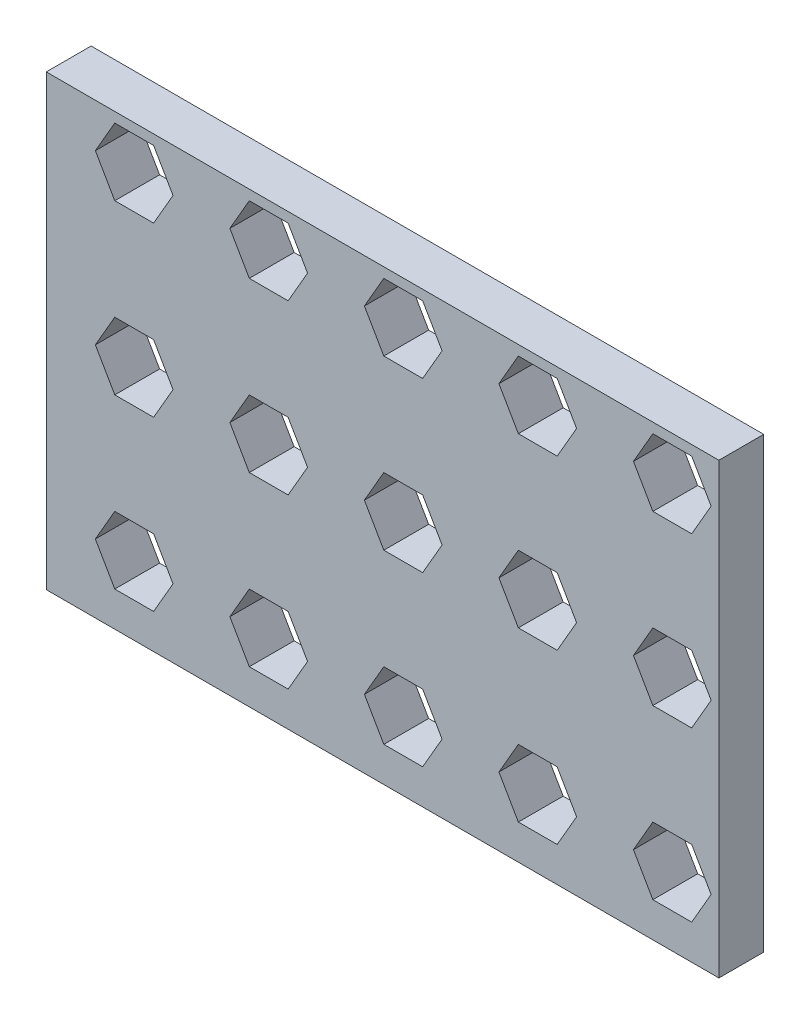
ISO-10303-21;
HEADER;
FILE_DESCRIPTION(('STEP AP214'),'2;1');
FILE_NAME('part.step','',(''),(''),'','','');
FILE_SCHEMA(('AUTOMOTIVE_DESIGN { 1 0 10303 214 1 1 1 1 }'));
ENDSEC;
DATA;
#1=APPLICATION_CONTEXT('core data for automotive mechanical design processes');
#2=APPLICATION_PROTOCOL_DEFINITION('international standard','automotive_design',2000,#1);
#3=PRODUCT_CONTEXT('',#1,'mechanical');
#4=PRODUCT('Part','Part','',(#3));
#5=PRODUCT_RELATED_PRODUCT_CATEGORY('part','',(#4));
#6=PRODUCT_DEFINITION_FORMATION('','',#4);
#7=PRODUCT_DEFINITION_CONTEXT('part definition',#1,'design');
#8=PRODUCT_DEFINITION('design','',#6,#7);
#9=PRODUCT_DEFINITION_SHAPE('','',#8);
#10=(LENGTH_UNIT() NAMED_UNIT(*) SI_UNIT(.MILLI.,.METRE.));
#11=(NAMED_UNIT(*) PLANE_ANGLE_UNIT() SI_UNIT($,.RADIAN.));
#12=(NAMED_UNIT(*) SI_UNIT($,.STERADIAN.) SOLID_ANGLE_UNIT());
#13=UNCERTAINTY_MEASURE_WITH_UNIT(LENGTH_MEASURE(1.E-05),#10,'distance_accuracy_value','');
#14=(GEOMETRIC_REPRESENTATION_CONTEXT(3) GLOBAL_UNCERTAINTY_ASSIGNED_CONTEXT((#13)) GLOBAL_UNIT_ASSIGNED_CONTEXT((#10,
#11,#12)) REPRESENTATION_CONTEXT('',''));
#15=CARTESIAN_POINT('',(0.,0.,0.));
#16=DIRECTION('',(0.,0.,1.));
#17=DIRECTION('',(1.,0.,0.));
#18=AXIS2_PLACEMENT_3D('',#15,#16,#17);
#19=CARTESIAN_POINT('',(0.,40.,4.));
#20=DIRECTION('',(1.,0.,0.));
#21=DIRECTION('',(0.,1.,0.));
#22=AXIS2_PLACEMENT_3D('',#19,#20,#21);
#23=PLANE('',#22);
#24=DIRECTION('',(0.,-1.,0.));
#25=VECTOR('',#24,1.);
#26=CARTESIAN_POINT('',(0.,40.,0.));
#27=LINE('',#26,#25);
#28=CARTESIAN_POINT('',(0.,40.,0.));
#29=VERTEX_POINT('',#28);
#30=CARTESIAN_POINT('',(0.,0.,0.));
#31=VERTEX_POINT('',#30);
#32=EDGE_CURVE('E713',#29,#31,#27,.T.);
#33=ORIENTED_EDGE('',*,*,#32,.T.);
#34=DIRECTION('',(0.,0.,-1.));
#35=VECTOR('',#34,1.);
#36=CARTESIAN_POINT('',(0.,0.,4.));
#37=LINE('',#36,#35);
#38=CARTESIAN_POINT('',(0.,0.,4.));
#39=VERTEX_POINT('',#38);
#40=EDGE_CURVE('E750',#39,#31,#37,.T.);
#41=ORIENTED_EDGE('',*,*,#40,.F.);
#42=DIRECTION('',(0.,-1.,0.));
#43=VECTOR('',#42,1.);
#44=CARTESIAN_POINT('',(0.,40.,4.));
#45=LINE('',#44,#43);
#46=CARTESIAN_POINT('',(0.,40.,4.));
#47=VERTEX_POINT('',#46);
#48=EDGE_CURVE('E724',#47,#39,#45,.T.);
#49=ORIENTED_EDGE('',*,*,#48,.F.);
#50=DIRECTION('',(0.,0.,-1.));
#51=VECTOR('',#50,1.);
#52=CARTESIAN_POINT('',(0.,40.,4.));
#53=LINE('',#52,#51);
#54=EDGE_CURVE('E734',#47,#29,#53,.T.);
#55=ORIENTED_EDGE('',*,*,#54,.T.);
#56=EDGE_LOOP('',(#33,#41,#49,#55));
#57=FACE_BOUND('',#56,.T.);
#58=ADVANCED_FACE('F34',(#57),#23,.F.);
#59=CARTESIAN_POINT('',(0.,0.,4.));
#60=DIRECTION('',(0.,1.,0.));
#61=DIRECTION('',(0.,0.,1.));
#62=AXIS2_PLACEMENT_3D('',#59,#60,#61);
#63=PLANE('',#62);
#64=DIRECTION('',(1.,0.,0.));
#65=VECTOR('',#64,1.);
#66=CARTESIAN_POINT('',(0.,0.,0.));
#67=LINE('',#66,#65);
#68=CARTESIAN_POINT('',(60.,0.,0.));
#69=VERTEX_POINT('',#68);
#70=EDGE_CURVE('E737',#31,#69,#67,.T.);
#71=ORIENTED_EDGE('',*,*,#70,.T.);
#72=DIRECTION('',(0.,0.,-1.));
#73=VECTOR('',#72,1.);
#74=CARTESIAN_POINT('',(60.,0.,4.));
#75=LINE('',#74,#73);
#76=CARTESIAN_POINT('',(60.,0.,4.));
#77=VERTEX_POINT('',#76);
#78=EDGE_CURVE('E747',#77,#69,#75,.T.);
#79=ORIENTED_EDGE('',*,*,#78,.F.);
#80=DIRECTION('',(1.,0.,0.));
#81=VECTOR('',#80,1.);
#82=CARTESIAN_POINT('',(0.,0.,4.));
#83=LINE('',#82,#81);
#84=EDGE_CURVE('E727',#39,#77,#83,.T.);
#85=ORIENTED_EDGE('',*,*,#84,.F.);
#86=ORIENTED_EDGE('',*,*,#40,.T.);
#87=EDGE_LOOP('',(#71,#79,#85,#86));
#88=FACE_BOUND('',#87,.T.);
#89=ADVANCED_FACE('F1396',(#88),#63,.F.);
#90=CARTESIAN_POINT('',(60.,40.,4.));
#91=DIRECTION('',(-1.,0.,0.));
#92=DIRECTION('',(0.,0.,1.));
#93=AXIS2_PLACEMENT_3D('',#90,#91,#92);
#94=PLANE('',#93);
#95=DIRECTION('',(0.,1.,0.));
#96=VECTOR('',#95,1.);
#97=CARTESIAN_POINT('',(60.,40.,0.));
#98=LINE('',#97,#96);
#99=CARTESIAN_POINT('',(60.,40.,0.));
#100=VERTEX_POINT('',#99);
#101=EDGE_CURVE('E739',#69,#100,#98,.T.);
#102=ORIENTED_EDGE('',*,*,#101,.T.);
#103=DIRECTION('',(0.,0.,-1.));
#104=VECTOR('',#103,1.);
#105=CARTESIAN_POINT('',(60.,40.,4.));
#106=LINE('',#105,#104);
#107=CARTESIAN_POINT('',(60.,40.,4.));
#108=VERTEX_POINT('',#107);
#109=EDGE_CURVE('E744',#108,#100,#106,.T.);
#110=ORIENTED_EDGE('',*,*,#109,.F.);
#111=DIRECTION('',(0.,1.,0.));
#112=VECTOR('',#111,1.);
#113=CARTESIAN_POINT('',(60.,40.,4.));
#114=LINE('',#113,#112);
#115=EDGE_CURVE('E730',#77,#108,#114,.T.);
#116=ORIENTED_EDGE('',*,*,#115,.F.);
#117=ORIENTED_EDGE('',*,*,#78,.T.);
#118=EDGE_LOOP('',(#102,#110,#116,#117));
#119=FACE_BOUND('',#118,.T.);
#120=ADVANCED_FACE('F1402',(#119),#94,.F.);
#121=CARTESIAN_POINT('',(0.,40.,4.));
#122=DIRECTION('',(0.,-1.,0.));
#123=DIRECTION('',(0.,0.,-1.));
#124=AXIS2_PLACEMENT_3D('',#121,#122,#123);
#125=PLANE('',#124);
#126=DIRECTION('',(-1.,0.,0.));
#127=VECTOR('',#126,1.);
#128=CARTESIAN_POINT('',(0.,40.,0.));
#129=LINE('',#128,#127);
#130=EDGE_CURVE('E728',#100,#29,#129,.T.);
#131=ORIENTED_EDGE('',*,*,#130,.T.);
#132=ORIENTED_EDGE('',*,*,#54,.F.);
#133=DIRECTION('',(-1.,0.,0.));
#134=VECTOR('',#133,1.);
#135=CARTESIAN_POINT('',(0.,40.,4.));
#136=LINE('',#135,#134);
#137=EDGE_CURVE('E732',#108,#47,#136,.T.);
#138=ORIENTED_EDGE('',*,*,#137,.F.);
#139=ORIENTED_EDGE('',*,*,#109,.T.);
#140=EDGE_LOOP('',(#131,#132,#138,#139));
#141=FACE_BOUND('',#140,.T.);
#142=ADVANCED_FACE('F2239',(#141),#125,.F.);
#143=CARTESIAN_POINT('',(0.,0.,4.));
#144=DIRECTION('',(0.,0.,1.));
#145=DIRECTION('',(1.,0.,0.));
#146=AXIS2_PLACEMENT_3D('',#143,#144,#145);
#147=PLANE('',#146);
#148=DIRECTION('',(0.499999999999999,0.866025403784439,0.));
#149=VECTOR('',#148,1.);
#150=CARTESIAN_POINT('',(21.5747280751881,3.10418081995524,4.));
#151=LINE('',#150,#149);
#152=CARTESIAN_POINT('',(21.5747280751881,3.10418081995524,4.));
#153=VERTEX_POINT('',#152);
#154=CARTESIAN_POINT('',(23.3067788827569,6.10418081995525,4.));
#155=VERTEX_POINT('',#154);
#156=EDGE_CURVE('E670',#153,#155,#151,.T.);
#157=ORIENTED_EDGE('',*,*,#156,.F.);
#158=DIRECTION('',(1.,0.,0.));
#159=VECTOR('',#158,1.);
#160=CARTESIAN_POINT('',(18.1106264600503,3.10418081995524,4.));
#161=LINE('',#160,#159);
#162=CARTESIAN_POINT('',(18.1106264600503,3.10418081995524,4.));
#163=VERTEX_POINT('',#162);
#164=EDGE_CURVE('E662',#163,#153,#161,.T.);
#165=ORIENTED_EDGE('',*,*,#164,.F.);
#166=DIRECTION('',(0.5,-0.866025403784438,0.));
#167=VECTOR('',#166,1.);
#168=CARTESIAN_POINT('',(16.3785756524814,6.10418081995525,4.));
#169=LINE('',#168,#167);
#170=CARTESIAN_POINT('',(16.3785756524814,6.10418081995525,4.));
#171=VERTEX_POINT('',#170);
#172=EDGE_CURVE('E654',#171,#163,#169,.T.);
#173=ORIENTED_EDGE('',*,*,#172,.F.);
#174=DIRECTION('',(-0.5,-0.866025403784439,0.));
#175=VECTOR('',#174,1.);
#176=CARTESIAN_POINT('',(18.1106264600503,9.10418081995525,4.));
#177=LINE('',#176,#175);
#178=CARTESIAN_POINT('',(18.1106264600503,9.10418081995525,4.));
#179=VERTEX_POINT('',#178);
#180=EDGE_CURVE('E640',#179,#171,#177,.T.);
#181=ORIENTED_EDGE('',*,*,#180,.F.);
#182=DIRECTION('',(-1.,0.,0.));
#183=VECTOR('',#182,1.);
#184=CARTESIAN_POINT('',(21.5747280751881,9.10418081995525,4.));
#185=LINE('',#184,#183);
#186=CARTESIAN_POINT('',(21.5747280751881,9.10418081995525,4.));
#187=VERTEX_POINT('',#186);
#188=EDGE_CURVE('E631',#187,#179,#185,.T.);
#189=ORIENTED_EDGE('',*,*,#188,.F.);
#190=DIRECTION('',(-0.5,0.866025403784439,0.));
#191=VECTOR('',#190,1.);
#192=CARTESIAN_POINT('',(23.3067788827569,6.10418081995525,4.));
#193=LINE('',#192,#191);
#194=EDGE_CURVE('E617',#155,#187,#193,.T.);
#195=ORIENTED_EDGE('',*,*,#194,.F.);
#196=EDGE_LOOP('',(#157,#165,#173,#181,#189,#195));
#197=FACE_BOUND('',#196,.T.);
#198=DIRECTION('',(0.499999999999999,0.866025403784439,0.));
#199=VECTOR('',#198,1.);
#200=CARTESIAN_POINT('',(9.57472807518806,3.10418081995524,4.));
#201=LINE('',#200,#199);
#202=CARTESIAN_POINT('',(9.57472807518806,3.10418081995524,4.));
#203=VERTEX_POINT('',#202);
#204=CARTESIAN_POINT('',(11.3067788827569,6.10418081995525,4.));
#205=VERTEX_POINT('',#204);
#206=EDGE_CURVE('E675',#203,#205,#201,.T.);
#207=ORIENTED_EDGE('',*,*,#206,.F.);
#208=DIRECTION('',(1.,0.,0.));
#209=VECTOR('',#208,1.);
#210=CARTESIAN_POINT('',(6.1106264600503,3.10418081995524,4.));
#211=LINE('',#210,#209);
#212=CARTESIAN_POINT('',(6.1106264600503,3.10418081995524,4.));
#213=VERTEX_POINT('',#212);
#214=EDGE_CURVE('E680',#213,#203,#211,.T.);
#215=ORIENTED_EDGE('',*,*,#214,.F.);
#216=DIRECTION('',(0.5,-0.866025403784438,0.));
#217=VECTOR('',#216,1.);
#218=CARTESIAN_POINT('',(4.37857565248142,6.10418081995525,4.));
#219=LINE('',#218,#217);
#220=CARTESIAN_POINT('',(4.37857565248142,6.10418081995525,4.));
#221=VERTEX_POINT('',#220);
#222=EDGE_CURVE('E706',#221,#213,#219,.T.);
#223=ORIENTED_EDGE('',*,*,#222,.F.);
#224=DIRECTION('',(-0.5,-0.866025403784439,0.));
#225=VECTOR('',#224,1.);
#226=CARTESIAN_POINT('',(6.1106264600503,9.10418081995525,4.));
#227=LINE('',#226,#225);
#228=CARTESIAN_POINT('',(6.1106264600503,9.10418081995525,4.));
#229=VERTEX_POINT('',#228);
#230=EDGE_CURVE('E703',#229,#221,#227,.T.);
#231=ORIENTED_EDGE('',*,*,#230,.F.);
#232=DIRECTION('',(-1.,0.,0.));
#233=VECTOR('',#232,1.);
#234=CARTESIAN_POINT('',(9.57472807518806,9.10418081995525,4.));
#235=LINE('',#234,#233);
#236=CARTESIAN_POINT('',(9.57472807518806,9.10418081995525,4.));
#237=VERTEX_POINT('',#236);
#238=EDGE_CURVE('E700',#237,#229,#235,.T.);
#239=ORIENTED_EDGE('',*,*,#238,.F.);
#240=DIRECTION('',(-0.5,0.866025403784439,0.));
#241=VECTOR('',#240,1.);
#242=CARTESIAN_POINT('',(11.3067788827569,6.10418081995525,4.));
#243=LINE('',#242,#241);
#244=EDGE_CURVE('E697',#205,#237,#243,.T.);
#245=ORIENTED_EDGE('',*,*,#244,.F.);
#246=EDGE_LOOP('',(#207,#215,#223,#231,#239,#245));
#247=FACE_BOUND('',#246,.T.);
#248=ORIENTED_EDGE('',*,*,#48,.T.);
#249=ORIENTED_EDGE('',*,*,#84,.T.);
#250=ORIENTED_EDGE('',*,*,#115,.T.);
#251=ORIENTED_EDGE('',*,*,#137,.T.);
#252=EDGE_LOOP('',(#248,#249,#250,#251));
#253=FACE_BOUND('',#252,.T.);
#254=DIRECTION('',(0.499999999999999,0.866025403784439,0.));
#255=VECTOR('',#254,1.);
#256=CARTESIAN_POINT('',(33.5747280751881,3.10418081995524,4.));
#257=LINE('',#256,#255);
#258=CARTESIAN_POINT('',(33.5747280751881,3.10418081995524,4.));
#259=VERTEX_POINT('',#258);
#260=CARTESIAN_POINT('',(35.3067788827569,6.10418081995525,4.));
#261=VERTEX_POINT('',#260);
#262=EDGE_CURVE('E753',#259,#261,#257,.T.);
#263=ORIENTED_EDGE('',*,*,#262,.F.);
#264=DIRECTION('',(1.,0.,0.));
#265=VECTOR('',#264,1.);
#266=CARTESIAN_POINT('',(30.1106264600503,3.10418081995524,4.));
#267=LINE('',#266,#265);
#268=CARTESIAN_POINT('',(30.1106264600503,3.10418081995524,4.));
#269=VERTEX_POINT('',#268);
#270=EDGE_CURVE('E755',#269,#259,#267,.T.);
#271=ORIENTED_EDGE('',*,*,#270,.F.);
#272=DIRECTION('',(0.5,-0.866025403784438,0.));
#273=VECTOR('',#272,1.);
#274=CARTESIAN_POINT('',(28.3785756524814,6.10418081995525,4.));
#275=LINE('',#274,#273);
#276=CARTESIAN_POINT('',(28.3785756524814,6.10418081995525,4.));
#277=VERTEX_POINT('',#276);
#278=EDGE_CURVE('E758',#277,#269,#275,.T.);
#279=ORIENTED_EDGE('',*,*,#278,.F.);
#280=DIRECTION('',(-0.5,-0.866025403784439,0.));
#281=VECTOR('',#280,1.);
#282=CARTESIAN_POINT('',(30.1106264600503,9.10418081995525,4.));
#283=LINE('',#282,#281);
#284=CARTESIAN_POINT('',(30.1106264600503,9.10418081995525,4.));
#285=VERTEX_POINT('',#284);
#286=EDGE_CURVE('E761',#285,#277,#283,.T.);
#287=ORIENTED_EDGE('',*,*,#286,.F.);
#288=DIRECTION('',(-1.,0.,0.));
#289=VECTOR('',#288,1.);
#290=CARTESIAN_POINT('',(33.5747280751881,9.10418081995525,4.));
#291=LINE('',#290,#289);
#292=CARTESIAN_POINT('',(33.5747280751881,9.10418081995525,4.));
#293=VERTEX_POINT('',#292);
#294=EDGE_CURVE('E764',#293,#285,#291,.T.);
#295=ORIENTED_EDGE('',*,*,#294,.F.);
#296=DIRECTION('',(-0.5,0.866025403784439,0.));
#297=VECTOR('',#296,1.);
#298=CARTESIAN_POINT('',(35.3067788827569,6.10418081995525,4.));
#299=LINE('',#298,#297);
#300=EDGE_CURVE('E767',#261,#293,#299,.T.);
#301=ORIENTED_EDGE('',*,*,#300,.F.);
#302=EDGE_LOOP('',(#263,#271,#279,#287,#295,#301));
#303=FACE_BOUND('',#302,.T.);
#304=DIRECTION('',(0.499999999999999,0.866025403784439,0.));
#305=VECTOR('',#304,1.);
#306=CARTESIAN_POINT('',(45.5747280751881,3.10418081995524,4.));
#307=LINE('',#306,#305);
#308=CARTESIAN_POINT('',(45.5747280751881,3.10418081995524,4.));
#309=VERTEX_POINT('',#308);
#310=CARTESIAN_POINT('',(47.3067788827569,6.10418081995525,4.));
#311=VERTEX_POINT('',#310);
#312=EDGE_CURVE('E801',#309,#311,#307,.T.);
#313=ORIENTED_EDGE('',*,*,#312,.F.);
#314=DIRECTION('',(1.,0.,0.));
#315=VECTOR('',#314,1.);
#316=CARTESIAN_POINT('',(42.1106264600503,3.10418081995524,4.));
#317=LINE('',#316,#315);
#318=CARTESIAN_POINT('',(42.1106264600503,3.10418081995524,4.));
#319=VERTEX_POINT('',#318);
#320=EDGE_CURVE('E803',#319,#309,#317,.T.);
#321=ORIENTED_EDGE('',*,*,#320,.F.);
#322=DIRECTION('',(0.5,-0.866025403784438,0.));
#323=VECTOR('',#322,1.);
#324=CARTESIAN_POINT('',(40.3785756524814,6.10418081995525,4.));
#325=LINE('',#324,#323);
#326=CARTESIAN_POINT('',(40.3785756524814,6.10418081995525,4.));
#327=VERTEX_POINT('',#326);
#328=EDGE_CURVE('E806',#327,#319,#325,.T.);
#329=ORIENTED_EDGE('',*,*,#328,.F.);
#330=DIRECTION('',(-0.5,-0.866025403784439,0.));
#331=VECTOR('',#330,1.);
#332=CARTESIAN_POINT('',(42.1106264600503,9.10418081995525,4.));
#333=LINE('',#332,#331);
#334=CARTESIAN_POINT('',(42.1106264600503,9.10418081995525,4.));
#335=VERTEX_POINT('',#334);
#336=EDGE_CURVE('E809',#335,#327,#333,.T.);
#337=ORIENTED_EDGE('',*,*,#336,.F.);
#338=DIRECTION('',(-1.,0.,0.));
#339=VECTOR('',#338,1.);
#340=CARTESIAN_POINT('',(45.5747280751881,9.10418081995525,4.));
#341=LINE('',#340,#339);
#342=CARTESIAN_POINT('',(45.5747280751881,9.10418081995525,4.));
#343=VERTEX_POINT('',#342);
#344=EDGE_CURVE('E812',#343,#335,#341,.T.);
#345=ORIENTED_EDGE('',*,*,#344,.F.);
#346=DIRECTION('',(-0.5,0.866025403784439,0.));
#347=VECTOR('',#346,1.);
#348=CARTESIAN_POINT('',(47.3067788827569,6.10418081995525,4.));
#349=LINE('',#348,#347);
#350=EDGE_CURVE('E815',#311,#343,#349,.T.);
#351=ORIENTED_EDGE('',*,*,#350,.F.);
#352=EDGE_LOOP('',(#313,#321,#329,#337,#345,#351));
#353=FACE_BOUND('',#352,.T.);
#354=DIRECTION('',(0.499999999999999,0.866025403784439,0.));
#355=VECTOR('',#354,1.);
#356=CARTESIAN_POINT('',(57.5747280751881,3.10418081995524,4.));
#357=LINE('',#356,#355);
#358=CARTESIAN_POINT('',(57.5747280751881,3.10418081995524,4.));
#359=VERTEX_POINT('',#358);
#360=CARTESIAN_POINT('',(59.3067788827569,6.10418081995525,4.));
#361=VERTEX_POINT('',#360);
#362=EDGE_CURVE('E849',#359,#361,#357,.T.);
#363=ORIENTED_EDGE('',*,*,#362,.F.);
#364=DIRECTION('',(1.,0.,0.));
#365=VECTOR('',#364,1.);
#366=CARTESIAN_POINT('',(54.1106264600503,3.10418081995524,4.));
#367=LINE('',#366,#365);
#368=CARTESIAN_POINT('',(54.1106264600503,3.10418081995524,4.));
#369=VERTEX_POINT('',#368);
#370=EDGE_CURVE('E851',#369,#359,#367,.T.);
#371=ORIENTED_EDGE('',*,*,#370,.F.);
#372=DIRECTION('',(0.5,-0.866025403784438,0.));
#373=VECTOR('',#372,1.);
#374=CARTESIAN_POINT('',(52.3785756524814,6.10418081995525,4.));
#375=LINE('',#374,#373);
#376=CARTESIAN_POINT('',(52.3785756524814,6.10418081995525,4.));
#377=VERTEX_POINT('',#376);
#378=EDGE_CURVE('E854',#377,#369,#375,.T.);
#379=ORIENTED_EDGE('',*,*,#378,.F.);
#380=DIRECTION('',(-0.5,-0.866025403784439,0.));
#381=VECTOR('',#380,1.);
#382=CARTESIAN_POINT('',(54.1106264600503,9.10418081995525,4.));
#383=LINE('',#382,#381);
#384=CARTESIAN_POINT('',(54.1106264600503,9.10418081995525,4.));
#385=VERTEX_POINT('',#384);
#386=EDGE_CURVE('E857',#385,#377,#383,.T.);
#387=ORIENTED_EDGE('',*,*,#386,.F.);
#388=DIRECTION('',(-1.,0.,0.));
#389=VECTOR('',#388,1.);
#390=CARTESIAN_POINT('',(57.5747280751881,9.10418081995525,4.));
#391=LINE('',#390,#389);
#392=CARTESIAN_POINT('',(57.5747280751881,9.10418081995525,4.));
#393=VERTEX_POINT('',#392);
#394=EDGE_CURVE('E860',#393,#385,#391,.T.);
#395=ORIENTED_EDGE('',*,*,#394,.F.);
#396=DIRECTION('',(-0.5,0.866025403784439,0.));
#397=VECTOR('',#396,1.);
#398=CARTESIAN_POINT('',(59.3067788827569,6.10418081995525,4.));
#399=LINE('',#398,#397);
#400=EDGE_CURVE('E863',#361,#393,#399,.T.);
#401=ORIENTED_EDGE('',*,*,#400,.F.);
#402=EDGE_LOOP('',(#363,#371,#379,#387,#395,#401));
#403=FACE_BOUND('',#402,.T.);
#404=DIRECTION('',(0.499999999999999,0.866025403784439,0.));
#405=VECTOR('',#404,1.);
#406=CARTESIAN_POINT('',(9.57472807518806,18.1041808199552,4.));
#407=LINE('',#406,#405);
#408=CARTESIAN_POINT('',(9.57472807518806,18.1041808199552,4.));
#409=VERTEX_POINT('',#408);
#410=CARTESIAN_POINT('',(11.3067788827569,21.1041808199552,4.));
#411=VERTEX_POINT('',#410);
#412=EDGE_CURVE('E897',#409,#411,#407,.T.);
#413=ORIENTED_EDGE('',*,*,#412,.F.);
#414=DIRECTION('',(1.,0.,0.));
#415=VECTOR('',#414,1.);
#416=CARTESIAN_POINT('',(6.1106264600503,18.1041808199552,4.));
#417=LINE('',#416,#415);
#418=CARTESIAN_POINT('',(6.1106264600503,18.1041808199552,4.));
#419=VERTEX_POINT('',#418);
#420=EDGE_CURVE('E899',#419,#409,#417,.T.);
#421=ORIENTED_EDGE('',*,*,#420,.F.);
#422=DIRECTION('',(0.5,-0.866025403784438,0.));
#423=VECTOR('',#422,1.);
#424=CARTESIAN_POINT('',(4.37857565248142,21.1041808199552,4.));
#425=LINE('',#424,#423);
#426=CARTESIAN_POINT('',(4.37857565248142,21.1041808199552,4.));
#427=VERTEX_POINT('',#426);
#428=EDGE_CURVE('E902',#427,#419,#425,.T.);
#429=ORIENTED_EDGE('',*,*,#428,.F.);
#430=DIRECTION('',(-0.5,-0.866025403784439,0.));
#431=VECTOR('',#430,1.);
#432=CARTESIAN_POINT('',(6.1106264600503,24.1041808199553,4.));
#433=LINE('',#432,#431);
#434=CARTESIAN_POINT('',(6.1106264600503,24.1041808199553,4.));
#435=VERTEX_POINT('',#434);
#436=EDGE_CURVE('E905',#435,#427,#433,.T.);
#437=ORIENTED_EDGE('',*,*,#436,.F.);
#438=DIRECTION('',(-1.,0.,0.));
#439=VECTOR('',#438,1.);
#440=CARTESIAN_POINT('',(9.57472807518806,24.1041808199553,4.));
#441=LINE('',#440,#439);
#442=CARTESIAN_POINT('',(9.57472807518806,24.1041808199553,4.));
#443=VERTEX_POINT('',#442);
#444=EDGE_CURVE('E908',#443,#435,#441,.T.);
#445=ORIENTED_EDGE('',*,*,#444,.F.);
#446=DIRECTION('',(-0.5,0.866025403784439,0.));
#447=VECTOR('',#446,1.);
#448=CARTESIAN_POINT('',(11.3067788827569,21.1041808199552,4.));
#449=LINE('',#448,#447);
#450=EDGE_CURVE('E911',#411,#443,#449,.T.);
#451=ORIENTED_EDGE('',*,*,#450,.F.);
#452=EDGE_LOOP('',(#413,#421,#429,#437,#445,#451));
#453=FACE_BOUND('',#452,.T.);
#454=DIRECTION('',(0.499999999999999,0.866025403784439,0.));
#455=VECTOR('',#454,1.);
#456=CARTESIAN_POINT('',(21.5747280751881,18.1041808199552,4.));
#457=LINE('',#456,#455);
#458=CARTESIAN_POINT('',(21.5747280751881,18.1041808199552,4.));
#459=VERTEX_POINT('',#458);
#460=CARTESIAN_POINT('',(23.3067788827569,21.1041808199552,4.));
#461=VERTEX_POINT('',#460);
#462=EDGE_CURVE('E945',#459,#461,#457,.T.);
#463=ORIENTED_EDGE('',*,*,#462,.F.);
#464=DIRECTION('',(1.,0.,0.));
#465=VECTOR('',#464,1.);
#466=CARTESIAN_POINT('',(18.1106264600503,18.1041808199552,4.));
#467=LINE('',#466,#465);
#468=CARTESIAN_POINT('',(18.1106264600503,18.1041808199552,4.));
#469=VERTEX_POINT('',#468);
#470=EDGE_CURVE('E947',#469,#459,#467,.T.);
#471=ORIENTED_EDGE('',*,*,#470,.F.);
#472=DIRECTION('',(0.5,-0.866025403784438,0.));
#473=VECTOR('',#472,1.);
#474=CARTESIAN_POINT('',(16.3785756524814,21.1041808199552,4.));
#475=LINE('',#474,#473);
#476=CARTESIAN_POINT('',(16.3785756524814,21.1041808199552,4.));
#477=VERTEX_POINT('',#476);
#478=EDGE_CURVE('E950',#477,#469,#475,.T.);
#479=ORIENTED_EDGE('',*,*,#478,.F.);
#480=DIRECTION('',(-0.5,-0.866025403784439,0.));
#481=VECTOR('',#480,1.);
#482=CARTESIAN_POINT('',(18.1106264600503,24.1041808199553,4.));
#483=LINE('',#482,#481);
#484=CARTESIAN_POINT('',(18.1106264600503,24.1041808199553,4.));
#485=VERTEX_POINT('',#484);
#486=EDGE_CURVE('E953',#485,#477,#483,.T.);
#487=ORIENTED_EDGE('',*,*,#486,.F.);
#488=DIRECTION('',(-1.,0.,0.));
#489=VECTOR('',#488,1.);
#490=CARTESIAN_POINT('',(21.5747280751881,24.1041808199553,4.));
#491=LINE('',#490,#489);
#492=CARTESIAN_POINT('',(21.5747280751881,24.1041808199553,4.));
#493=VERTEX_POINT('',#492);
#494=EDGE_CURVE('E956',#493,#485,#491,.T.);
#495=ORIENTED_EDGE('',*,*,#494,.F.);
#496=DIRECTION('',(-0.5,0.866025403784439,0.));
#497=VECTOR('',#496,1.);
#498=CARTESIAN_POINT('',(23.3067788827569,21.1041808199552,4.));
#499=LINE('',#498,#497);
#500=EDGE_CURVE('E959',#461,#493,#499,.T.);
#501=ORIENTED_EDGE('',*,*,#500,.F.);
#502=EDGE_LOOP('',(#463,#471,#479,#487,#495,#501));
#503=FACE_BOUND('',#502,.T.);
#504=DIRECTION('',(0.499999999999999,0.866025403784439,0.));
#505=VECTOR('',#504,1.);
#506=CARTESIAN_POINT('',(33.5747280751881,18.1041808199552,4.));
#507=LINE('',#506,#505);
#508=CARTESIAN_POINT('',(33.5747280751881,18.1041808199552,4.));
#509=VERTEX_POINT('',#508);
#510=CARTESIAN_POINT('',(35.3067788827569,21.1041808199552,4.));
#511=VERTEX_POINT('',#510);
#512=EDGE_CURVE('E993',#509,#511,#507,.T.);
#513=ORIENTED_EDGE('',*,*,#512,.F.);
#514=DIRECTION('',(1.,0.,0.));
#515=VECTOR('',#514,1.);
#516=CARTESIAN_POINT('',(30.1106264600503,18.1041808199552,4.));
#517=LINE('',#516,#515);
#518=CARTESIAN_POINT('',(30.1106264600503,18.1041808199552,4.));
#519=VERTEX_POINT('',#518);
#520=EDGE_CURVE('E995',#519,#509,#517,.T.);
#521=ORIENTED_EDGE('',*,*,#520,.F.);
#522=DIRECTION('',(0.5,-0.866025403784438,0.));
#523=VECTOR('',#522,1.);
#524=CARTESIAN_POINT('',(28.3785756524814,21.1041808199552,4.));
#525=LINE('',#524,#523);
#526=CARTESIAN_POINT('',(28.3785756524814,21.1041808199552,4.));
#527=VERTEX_POINT('',#526);
#528=EDGE_CURVE('E998',#527,#519,#525,.T.);
#529=ORIENTED_EDGE('',*,*,#528,.F.);
#530=DIRECTION('',(-0.5,-0.866025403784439,0.));
#531=VECTOR('',#530,1.);
#532=CARTESIAN_POINT('',(30.1106264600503,24.1041808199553,4.));
#533=LINE('',#532,#531);
#534=CARTESIAN_POINT('',(30.1106264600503,24.1041808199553,4.));
#535=VERTEX_POINT('',#534);
#536=EDGE_CURVE('E1001',#535,#527,#533,.T.);
#537=ORIENTED_EDGE('',*,*,#536,.F.);
#538=DIRECTION('',(-1.,0.,0.));
#539=VECTOR('',#538,1.);
#540=CARTESIAN_POINT('',(33.5747280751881,24.1041808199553,4.));
#541=LINE('',#540,#539);
#542=CARTESIAN_POINT('',(33.5747280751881,24.1041808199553,4.));
#543=VERTEX_POINT('',#542);
#544=EDGE_CURVE('E1004',#543,#535,#541,.T.);
#545=ORIENTED_EDGE('',*,*,#544,.F.);
#546=DIRECTION('',(-0.5,0.866025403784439,0.));
#547=VECTOR('',#546,1.);
#548=CARTESIAN_POINT('',(35.3067788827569,21.1041808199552,4.));
#549=LINE('',#548,#547);
#550=EDGE_CURVE('E1007',#511,#543,#549,.T.);
#551=ORIENTED_EDGE('',*,*,#550,.F.);
#552=EDGE_LOOP('',(#513,#521,#529,#537,#545,#551));
#553=FACE_BOUND('',#552,.T.);
#554=DIRECTION('',(0.499999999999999,0.866025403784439,0.));
#555=VECTOR('',#554,1.);
#556=CARTESIAN_POINT('',(45.5747280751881,18.1041808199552,4.));
#557=LINE('',#556,#555);
#558=CARTESIAN_POINT('',(45.5747280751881,18.1041808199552,4.));
#559=VERTEX_POINT('',#558);
#560=CARTESIAN_POINT('',(47.3067788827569,21.1041808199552,4.));
#561=VERTEX_POINT('',#560);
#562=EDGE_CURVE('E1041',#559,#561,#557,.T.);
#563=ORIENTED_EDGE('',*,*,#562,.F.);
#564=DIRECTION('',(1.,0.,0.));
#565=VECTOR('',#564,1.);
#566=CARTESIAN_POINT('',(42.1106264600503,18.1041808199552,4.));
#567=LINE('',#566,#565);
#568=CARTESIAN_POINT('',(42.1106264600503,18.1041808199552,4.));
#569=VERTEX_POINT('',#568);
#570=EDGE_CURVE('E1043',#569,#559,#567,.T.);
#571=ORIENTED_EDGE('',*,*,#570,.F.);
#572=DIRECTION('',(0.5,-0.866025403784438,0.));
#573=VECTOR('',#572,1.);
#574=CARTESIAN_POINT('',(40.3785756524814,21.1041808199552,4.));
#575=LINE('',#574,#573);
#576=CARTESIAN_POINT('',(40.3785756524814,21.1041808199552,4.));
#577=VERTEX_POINT('',#576);
#578=EDGE_CURVE('E1046',#577,#569,#575,.T.);
#579=ORIENTED_EDGE('',*,*,#578,.F.);
#580=DIRECTION('',(-0.5,-0.866025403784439,0.));
#581=VECTOR('',#580,1.);
#582=CARTESIAN_POINT('',(42.1106264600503,24.1041808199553,4.));
#583=LINE('',#582,#581);
#584=CARTESIAN_POINT('',(42.1106264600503,24.1041808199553,4.));
#585=VERTEX_POINT('',#584);
#586=EDGE_CURVE('E1049',#585,#577,#583,.T.);
#587=ORIENTED_EDGE('',*,*,#586,.F.);
#588=DIRECTION('',(-1.,0.,0.));
#589=VECTOR('',#588,1.);
#590=CARTESIAN_POINT('',(45.5747280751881,24.1041808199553,4.));
#591=LINE('',#590,#589);
#592=CARTESIAN_POINT('',(45.5747280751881,24.1041808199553,4.));
#593=VERTEX_POINT('',#592);
#594=EDGE_CURVE('E1052',#593,#585,#591,.T.);
#595=ORIENTED_EDGE('',*,*,#594,.F.);
#596=DIRECTION('',(-0.5,0.866025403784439,0.));
#597=VECTOR('',#596,1.);
#598=CARTESIAN_POINT('',(47.3067788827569,21.1041808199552,4.));
#599=LINE('',#598,#597);
#600=EDGE_CURVE('E1055',#561,#593,#599,.T.);
#601=ORIENTED_EDGE('',*,*,#600,.F.);
#602=EDGE_LOOP('',(#563,#571,#579,#587,#595,#601));
#603=FACE_BOUND('',#602,.T.);
#604=DIRECTION('',(0.499999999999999,0.866025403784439,0.));
#605=VECTOR('',#604,1.);
#606=CARTESIAN_POINT('',(57.5747280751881,18.1041808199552,4.));
#607=LINE('',#606,#605);
#608=CARTESIAN_POINT('',(57.5747280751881,18.1041808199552,4.));
#609=VERTEX_POINT('',#608);
#610=CARTESIAN_POINT('',(59.3067788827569,21.1041808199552,4.));
#611=VERTEX_POINT('',#610);
#612=EDGE_CURVE('E1089',#609,#611,#607,.T.);
#613=ORIENTED_EDGE('',*,*,#612,.F.);
#614=DIRECTION('',(1.,0.,0.));
#615=VECTOR('',#614,1.);
#616=CARTESIAN_POINT('',(54.1106264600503,18.1041808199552,4.));
#617=LINE('',#616,#615);
#618=CARTESIAN_POINT('',(54.1106264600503,18.1041808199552,4.));
#619=VERTEX_POINT('',#618);
#620=EDGE_CURVE('E1091',#619,#609,#617,.T.);
#621=ORIENTED_EDGE('',*,*,#620,.F.);
#622=DIRECTION('',(0.5,-0.866025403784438,0.));
#623=VECTOR('',#622,1.);
#624=CARTESIAN_POINT('',(52.3785756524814,21.1041808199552,4.));
#625=LINE('',#624,#623);
#626=CARTESIAN_POINT('',(52.3785756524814,21.1041808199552,4.));
#627=VERTEX_POINT('',#626);
#628=EDGE_CURVE('E1094',#627,#619,#625,.T.);
#629=ORIENTED_EDGE('',*,*,#628,.F.);
#630=DIRECTION('',(-0.5,-0.866025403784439,0.));
#631=VECTOR('',#630,1.);
#632=CARTESIAN_POINT('',(54.1106264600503,24.1041808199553,4.));
#633=LINE('',#632,#631);
#634=CARTESIAN_POINT('',(54.1106264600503,24.1041808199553,4.));
#635=VERTEX_POINT('',#634);
#636=EDGE_CURVE('E1097',#635,#627,#633,.T.);
#637=ORIENTED_EDGE('',*,*,#636,.F.);
#638=DIRECTION('',(-1.,0.,0.));
#639=VECTOR('',#638,1.);
#640=CARTESIAN_POINT('',(57.5747280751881,24.1041808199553,4.));
#641=LINE('',#640,#639);
#642=CARTESIAN_POINT('',(57.5747280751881,24.1041808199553,4.));
#643=VERTEX_POINT('',#642);
#644=EDGE_CURVE('E1100',#643,#635,#641,.T.);
#645=ORIENTED_EDGE('',*,*,#644,.F.);
#646=DIRECTION('',(-0.5,0.866025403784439,0.));
#647=VECTOR('',#646,1.);
#648=CARTESIAN_POINT('',(59.3067788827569,21.1041808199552,4.));
#649=LINE('',#648,#647);
#650=EDGE_CURVE('E1103',#611,#643,#649,.T.);
#651=ORIENTED_EDGE('',*,*,#650,.F.);
#652=EDGE_LOOP('',(#613,#621,#629,#637,#645,#651));
#653=FACE_BOUND('',#652,.T.);
#654=DIRECTION('',(0.499999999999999,0.866025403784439,0.));
#655=VECTOR('',#654,1.);
#656=CARTESIAN_POINT('',(9.57472807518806,33.1041808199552,4.));
#657=LINE('',#656,#655);
#658=CARTESIAN_POINT('',(9.57472807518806,33.1041808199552,4.));
#659=VERTEX_POINT('',#658);
#660=CARTESIAN_POINT('',(11.3067788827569,36.1041808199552,4.));
#661=VERTEX_POINT('',#660);
#662=EDGE_CURVE('E1137',#659,#661,#657,.T.);
#663=ORIENTED_EDGE('',*,*,#662,.F.);
#664=DIRECTION('',(1.,0.,0.));
#665=VECTOR('',#664,1.);
#666=CARTESIAN_POINT('',(6.1106264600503,33.1041808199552,4.));
#667=LINE('',#666,#665);
#668=CARTESIAN_POINT('',(6.1106264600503,33.1041808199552,4.));
#669=VERTEX_POINT('',#668);
#670=EDGE_CURVE('E1139',#669,#659,#667,.T.);
#671=ORIENTED_EDGE('',*,*,#670,.F.);
#672=DIRECTION('',(0.5,-0.866025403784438,0.));
#673=VECTOR('',#672,1.);
#674=CARTESIAN_POINT('',(4.37857565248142,36.1041808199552,4.));
#675=LINE('',#674,#673);
#676=CARTESIAN_POINT('',(4.37857565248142,36.1041808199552,4.));
#677=VERTEX_POINT('',#676);
#678=EDGE_CURVE('E1142',#677,#669,#675,.T.);
#679=ORIENTED_EDGE('',*,*,#678,.F.);
#680=DIRECTION('',(-0.5,-0.866025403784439,0.));
#681=VECTOR('',#680,1.);
#682=CARTESIAN_POINT('',(6.1106264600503,39.1041808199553,4.));
#683=LINE('',#682,#681);
#684=CARTESIAN_POINT('',(6.1106264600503,39.1041808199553,4.));
#685=VERTEX_POINT('',#684);
#686=EDGE_CURVE('E1145',#685,#677,#683,.T.);
#687=ORIENTED_EDGE('',*,*,#686,.F.);
#688=DIRECTION('',(-1.,0.,0.));
#689=VECTOR('',#688,1.);
#690=CARTESIAN_POINT('',(9.57472807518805,39.1041808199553,4.));
#691=LINE('',#690,#689);
#692=CARTESIAN_POINT('',(9.57472807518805,39.1041808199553,4.));
#693=VERTEX_POINT('',#692);
#694=EDGE_CURVE('E1148',#693,#685,#691,.T.);
#695=ORIENTED_EDGE('',*,*,#694,.F.);
#696=DIRECTION('',(-0.5,0.866025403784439,0.));
#697=VECTOR('',#696,1.);
#698=CARTESIAN_POINT('',(11.3067788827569,36.1041808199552,4.));
#699=LINE('',#698,#697);
#700=EDGE_CURVE('E1151',#661,#693,#699,.T.);
#701=ORIENTED_EDGE('',*,*,#700,.F.);
#702=EDGE_LOOP('',(#663,#671,#679,#687,#695,#701));
#703=FACE_BOUND('',#702,.T.);
#704=DIRECTION('',(0.499999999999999,0.866025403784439,0.));
#705=VECTOR('',#704,1.);
#706=CARTESIAN_POINT('',(21.5747280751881,33.1041808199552,4.));
#707=LINE('',#706,#705);
#708=CARTESIAN_POINT('',(21.5747280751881,33.1041808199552,4.));
#709=VERTEX_POINT('',#708);
#710=CARTESIAN_POINT('',(23.3067788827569,36.1041808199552,4.));
#711=VERTEX_POINT('',#710);
#712=EDGE_CURVE('E1185',#709,#711,#707,.T.);
#713=ORIENTED_EDGE('',*,*,#712,.F.);
#714=DIRECTION('',(1.,0.,0.));
#715=VECTOR('',#714,1.);
#716=CARTESIAN_POINT('',(18.1106264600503,33.1041808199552,4.));
#717=LINE('',#716,#715);
#718=CARTESIAN_POINT('',(18.1106264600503,33.1041808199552,4.));
#719=VERTEX_POINT('',#718);
#720=EDGE_CURVE('E1187',#719,#709,#717,.T.);
#721=ORIENTED_EDGE('',*,*,#720,.F.);
#722=DIRECTION('',(0.5,-0.866025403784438,0.));
#723=VECTOR('',#722,1.);
#724=CARTESIAN_POINT('',(16.3785756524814,36.1041808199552,4.));
#725=LINE('',#724,#723);
#726=CARTESIAN_POINT('',(16.3785756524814,36.1041808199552,4.));
#727=VERTEX_POINT('',#726);
#728=EDGE_CURVE('E1190',#727,#719,#725,.T.);
#729=ORIENTED_EDGE('',*,*,#728,.F.);
#730=DIRECTION('',(-0.5,-0.866025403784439,0.));
#731=VECTOR('',#730,1.);
#732=CARTESIAN_POINT('',(18.1106264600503,39.1041808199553,4.));
#733=LINE('',#732,#731);
#734=CARTESIAN_POINT('',(18.1106264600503,39.1041808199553,4.));
#735=VERTEX_POINT('',#734);
#736=EDGE_CURVE('E1193',#735,#727,#733,.T.);
#737=ORIENTED_EDGE('',*,*,#736,.F.);
#738=DIRECTION('',(-1.,0.,0.));
#739=VECTOR('',#738,1.);
#740=CARTESIAN_POINT('',(21.5747280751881,39.1041808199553,4.));
#741=LINE('',#740,#739);
#742=CARTESIAN_POINT('',(21.5747280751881,39.1041808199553,4.));
#743=VERTEX_POINT('',#742);
#744=EDGE_CURVE('E1196',#743,#735,#741,.T.);
#745=ORIENTED_EDGE('',*,*,#744,.F.);
#746=DIRECTION('',(-0.5,0.866025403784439,0.));
#747=VECTOR('',#746,1.);
#748=CARTESIAN_POINT('',(23.3067788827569,36.1041808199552,4.));
#749=LINE('',#748,#747);
#750=EDGE_CURVE('E1199',#711,#743,#749,.T.);
#751=ORIENTED_EDGE('',*,*,#750,.F.);
#752=EDGE_LOOP('',(#713,#721,#729,#737,#745,#751));
#753=FACE_BOUND('',#752,.T.);
#754=DIRECTION('',(0.499999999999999,0.866025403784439,0.));
#755=VECTOR('',#754,1.);
#756=CARTESIAN_POINT('',(33.5747280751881,33.1041808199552,4.));
#757=LINE('',#756,#755);
#758=CARTESIAN_POINT('',(33.5747280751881,33.1041808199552,4.));
#759=VERTEX_POINT('',#758);
#760=CARTESIAN_POINT('',(35.3067788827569,36.1041808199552,4.));
#761=VERTEX_POINT('',#760);
#762=EDGE_CURVE('E1233',#759,#761,#757,.T.);
#763=ORIENTED_EDGE('',*,*,#762,.F.);
#764=DIRECTION('',(1.,0.,0.));
#765=VECTOR('',#764,1.);
#766=CARTESIAN_POINT('',(30.1106264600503,33.1041808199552,4.));
#767=LINE('',#766,#765);
#768=CARTESIAN_POINT('',(30.1106264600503,33.1041808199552,4.));
#769=VERTEX_POINT('',#768);
#770=EDGE_CURVE('E1235',#769,#759,#767,.T.);
#771=ORIENTED_EDGE('',*,*,#770,.F.);
#772=DIRECTION('',(0.5,-0.866025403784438,0.));
#773=VECTOR('',#772,1.);
#774=CARTESIAN_POINT('',(28.3785756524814,36.1041808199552,4.));
#775=LINE('',#774,#773);
#776=CARTESIAN_POINT('',(28.3785756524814,36.1041808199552,4.));
#777=VERTEX_POINT('',#776);
#778=EDGE_CURVE('E1238',#777,#769,#775,.T.);
#779=ORIENTED_EDGE('',*,*,#778,.F.);
#780=DIRECTION('',(-0.5,-0.866025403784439,0.));
#781=VECTOR('',#780,1.);
#782=CARTESIAN_POINT('',(30.1106264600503,39.1041808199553,4.));
#783=LINE('',#782,#781);
#784=CARTESIAN_POINT('',(30.1106264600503,39.1041808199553,4.));
#785=VERTEX_POINT('',#784);
#786=EDGE_CURVE('E1241',#785,#777,#783,.T.);
#787=ORIENTED_EDGE('',*,*,#786,.F.);
#788=DIRECTION('',(-1.,0.,0.));
#789=VECTOR('',#788,1.);
#790=CARTESIAN_POINT('',(33.5747280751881,39.1041808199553,4.));
#791=LINE('',#790,#789);
#792=CARTESIAN_POINT('',(33.5747280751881,39.1041808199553,4.));
#793=VERTEX_POINT('',#792);
#794=EDGE_CURVE('E1244',#793,#785,#791,.T.);
#795=ORIENTED_EDGE('',*,*,#794,.F.);
#796=DIRECTION('',(-0.5,0.866025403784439,0.));
#797=VECTOR('',#796,1.);
#798=CARTESIAN_POINT('',(35.3067788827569,36.1041808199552,4.));
#799=LINE('',#798,#797);
#800=EDGE_CURVE('E1247',#761,#793,#799,.T.);
#801=ORIENTED_EDGE('',*,*,#800,.F.);
#802=EDGE_LOOP('',(#763,#771,#779,#787,#795,#801));
#803=FACE_BOUND('',#802,.T.);
#804=DIRECTION('',(0.499999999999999,0.866025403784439,0.));
#805=VECTOR('',#804,1.);
#806=CARTESIAN_POINT('',(45.5747280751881,33.1041808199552,4.));
#807=LINE('',#806,#805);
#808=CARTESIAN_POINT('',(45.5747280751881,33.1041808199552,4.));
#809=VERTEX_POINT('',#808);
#810=CARTESIAN_POINT('',(47.3067788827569,36.1041808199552,4.));
#811=VERTEX_POINT('',#810);
#812=EDGE_CURVE('E1281',#809,#811,#807,.T.);
#813=ORIENTED_EDGE('',*,*,#812,.F.);
#814=DIRECTION('',(1.,0.,0.));
#815=VECTOR('',#814,1.);
#816=CARTESIAN_POINT('',(42.1106264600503,33.1041808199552,4.));
#817=LINE('',#816,#815);
#818=CARTESIAN_POINT('',(42.1106264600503,33.1041808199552,4.));
#819=VERTEX_POINT('',#818);
#820=EDGE_CURVE('E1283',#819,#809,#817,.T.);
#821=ORIENTED_EDGE('',*,*,#820,.F.);
#822=DIRECTION('',(0.5,-0.866025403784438,0.));
#823=VECTOR('',#822,1.);
#824=CARTESIAN_POINT('',(40.3785756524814,36.1041808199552,4.));
#825=LINE('',#824,#823);
#826=CARTESIAN_POINT('',(40.3785756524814,36.1041808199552,4.));
#827=VERTEX_POINT('',#826);
#828=EDGE_CURVE('E1286',#827,#819,#825,.T.);
#829=ORIENTED_EDGE('',*,*,#828,.F.);
#830=DIRECTION('',(-0.5,-0.866025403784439,0.));
#831=VECTOR('',#830,1.);
#832=CARTESIAN_POINT('',(42.1106264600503,39.1041808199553,4.));
#833=LINE('',#832,#831);
#834=CARTESIAN_POINT('',(42.1106264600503,39.1041808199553,4.));
#835=VERTEX_POINT('',#834);
#836=EDGE_CURVE('E1289',#835,#827,#833,.T.);
#837=ORIENTED_EDGE('',*,*,#836,.F.);
#838=DIRECTION('',(-1.,0.,0.));
#839=VECTOR('',#838,1.);
#840=CARTESIAN_POINT('',(45.5747280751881,39.1041808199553,4.));
#841=LINE('',#840,#839);
#842=CARTESIAN_POINT('',(45.5747280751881,39.1041808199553,4.));
#843=VERTEX_POINT('',#842);
#844=EDGE_CURVE('E1292',#843,#835,#841,.T.);
#845=ORIENTED_EDGE('',*,*,#844,.F.);
#846=DIRECTION('',(-0.5,0.866025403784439,0.));
#847=VECTOR('',#846,1.);
#848=CARTESIAN_POINT('',(47.3067788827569,36.1041808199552,4.));
#849=LINE('',#848,#847);
#850=EDGE_CURVE('E1295',#811,#843,#849,.T.);
#851=ORIENTED_EDGE('',*,*,#850,.F.);
#852=EDGE_LOOP('',(#813,#821,#829,#837,#845,#851));
#853=FACE_BOUND('',#852,.T.);
#854=DIRECTION('',(0.499999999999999,0.866025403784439,0.));
#855=VECTOR('',#854,1.);
#856=CARTESIAN_POINT('',(57.5747280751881,33.1041808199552,4.));
#857=LINE('',#856,#855);
#858=CARTESIAN_POINT('',(57.5747280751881,33.1041808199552,4.));
#859=VERTEX_POINT('',#858);
#860=CARTESIAN_POINT('',(59.3067788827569,36.1041808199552,4.));
#861=VERTEX_POINT('',#860);
#862=EDGE_CURVE('E1329',#859,#861,#857,.T.);
#863=ORIENTED_EDGE('',*,*,#862,.F.);
#864=DIRECTION('',(1.,0.,0.));
#865=VECTOR('',#864,1.);
#866=CARTESIAN_POINT('',(54.1106264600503,33.1041808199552,4.));
#867=LINE('',#866,#865);
#868=CARTESIAN_POINT('',(54.1106264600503,33.1041808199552,4.));
#869=VERTEX_POINT('',#868);
#870=EDGE_CURVE('E1331',#869,#859,#867,.T.);
#871=ORIENTED_EDGE('',*,*,#870,.F.);
#872=DIRECTION('',(0.5,-0.866025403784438,0.));
#873=VECTOR('',#872,1.);
#874=CARTESIAN_POINT('',(52.3785756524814,36.1041808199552,4.));
#875=LINE('',#874,#873);
#876=CARTESIAN_POINT('',(52.3785756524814,36.1041808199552,4.));
#877=VERTEX_POINT('',#876);
#878=EDGE_CURVE('E1334',#877,#869,#875,.T.);
#879=ORIENTED_EDGE('',*,*,#878,.F.);
#880=DIRECTION('',(-0.5,-0.866025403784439,0.));
#881=VECTOR('',#880,1.);
#882=CARTESIAN_POINT('',(54.1106264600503,39.1041808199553,4.));
#883=LINE('',#882,#881);
#884=CARTESIAN_POINT('',(54.1106264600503,39.1041808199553,4.));
#885=VERTEX_POINT('',#884);
#886=EDGE_CURVE('E1337',#885,#877,#883,.T.);
#887=ORIENTED_EDGE('',*,*,#886,.F.);
#888=DIRECTION('',(-1.,0.,0.));
#889=VECTOR('',#888,1.);
#890=CARTESIAN_POINT('',(57.5747280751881,39.1041808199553,4.));
#891=LINE('',#890,#889);
#892=CARTESIAN_POINT('',(57.5747280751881,39.1041808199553,4.));
#893=VERTEX_POINT('',#892);
#894=EDGE_CURVE('E1340',#893,#885,#891,.T.);
#895=ORIENTED_EDGE('',*,*,#894,.F.);
#896=DIRECTION('',(-0.5,0.866025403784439,0.));
#897=VECTOR('',#896,1.);
#898=CARTESIAN_POINT('',(59.3067788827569,36.1041808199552,4.));
#899=LINE('',#898,#897);
#900=EDGE_CURVE('E1343',#861,#893,#899,.T.);
#901=ORIENTED_EDGE('',*,*,#900,.F.);
#902=EDGE_LOOP('',(#863,#871,#879,#887,#895,#901));
#903=FACE_BOUND('',#902,.T.);
#904=ADVANCED_FACE('F637',(#197,#247,#253,#303,#353,#403,#453,#503,#553,#603,#653,#703,#753,
#803,#853,#903),#147,.T.);
#905=CARTESIAN_POINT('',(0.,0.,0.));
#906=DIRECTION('',(0.,0.,1.));
#907=DIRECTION('',(1.,0.,0.));
#908=AXIS2_PLACEMENT_3D('',#905,#906,#907);
#909=PLANE('',#908);
#910=DIRECTION('',(1.,0.,0.));
#911=VECTOR('',#910,1.);
#912=CARTESIAN_POINT('',(18.1106264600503,3.10418081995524,0.));
#913=LINE('',#912,#911);
#914=CARTESIAN_POINT('',(18.1106264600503,3.10418081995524,0.));
#915=VERTEX_POINT('',#914);
#916=CARTESIAN_POINT('',(21.5747280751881,3.10418081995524,0.));
#917=VERTEX_POINT('',#916);
#918=EDGE_CURVE('E667',#915,#917,#913,.T.);
#919=ORIENTED_EDGE('',*,*,#918,.T.);
#920=DIRECTION('',(0.499999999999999,0.866025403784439,0.));
#921=VECTOR('',#920,1.);
#922=CARTESIAN_POINT('',(21.5747280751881,3.10418081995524,0.));
#923=LINE('',#922,#921);
#924=CARTESIAN_POINT('',(23.3067788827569,6.10418081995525,0.));
#925=VERTEX_POINT('',#924);
#926=EDGE_CURVE('E672',#917,#925,#923,.T.);
#927=ORIENTED_EDGE('',*,*,#926,.T.);
#928=DIRECTION('',(-0.5,0.866025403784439,0.));
#929=VECTOR('',#928,1.);
#930=CARTESIAN_POINT('',(23.3067788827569,6.10418081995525,0.));
#931=LINE('',#930,#929);
#932=CARTESIAN_POINT('',(21.5747280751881,9.10418081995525,0.));
#933=VERTEX_POINT('',#932);
#934=EDGE_CURVE('E627',#925,#933,#931,.T.);
#935=ORIENTED_EDGE('',*,*,#934,.T.);
#936=DIRECTION('',(-1.,0.,0.));
#937=VECTOR('',#936,1.);
#938=CARTESIAN_POINT('',(21.5747280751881,9.10418081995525,0.));
#939=LINE('',#938,#937);
#940=CARTESIAN_POINT('',(18.1106264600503,9.10418081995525,0.));
#941=VERTEX_POINT('',#940);
#942=EDGE_CURVE('E634',#933,#941,#939,.T.);
#943=ORIENTED_EDGE('',*,*,#942,.T.);
#944=DIRECTION('',(-0.5,-0.866025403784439,0.));
#945=VECTOR('',#944,1.);
#946=CARTESIAN_POINT('',(18.1106264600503,9.10418081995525,0.));
#947=LINE('',#946,#945);
#948=CARTESIAN_POINT('',(16.3785756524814,6.10418081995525,0.));
#949=VERTEX_POINT('',#948);
#950=EDGE_CURVE('E651',#941,#949,#947,.T.);
#951=ORIENTED_EDGE('',*,*,#950,.T.);
#952=DIRECTION('',(0.5,-0.866025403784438,0.));
#953=VECTOR('',#952,1.);
#954=CARTESIAN_POINT('',(16.3785756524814,6.10418081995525,0.));
#955=LINE('',#954,#953);
#956=EDGE_CURVE('E659',#949,#915,#955,.T.);
#957=ORIENTED_EDGE('',*,*,#956,.T.);
#958=EDGE_LOOP('',(#919,#927,#935,#943,#951,#957));
#959=FACE_BOUND('',#958,.T.);
#960=DIRECTION('',(1.,0.,0.));
#961=VECTOR('',#960,1.);
#962=CARTESIAN_POINT('',(6.1106264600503,3.10418081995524,0.));
#963=LINE('',#962,#961);
#964=CARTESIAN_POINT('',(6.1106264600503,3.10418081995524,0.));
#965=VERTEX_POINT('',#964);
#966=CARTESIAN_POINT('',(9.57472807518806,3.10418081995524,0.));
#967=VERTEX_POINT('',#966);
#968=EDGE_CURVE('E692',#965,#967,#963,.T.);
#969=ORIENTED_EDGE('',*,*,#968,.T.);
#970=DIRECTION('',(0.499999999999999,0.866025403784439,0.));
#971=VECTOR('',#970,1.);
#972=CARTESIAN_POINT('',(9.57472807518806,3.10418081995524,0.));
#973=LINE('',#972,#971);
#974=CARTESIAN_POINT('',(11.3067788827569,6.10418081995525,0.));
#975=VERTEX_POINT('',#974);
#976=EDGE_CURVE('E676',#967,#975,#973,.T.);
#977=ORIENTED_EDGE('',*,*,#976,.T.);
#978=DIRECTION('',(-0.5,0.866025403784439,0.));
#979=VECTOR('',#978,1.);
#980=CARTESIAN_POINT('',(11.3067788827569,6.10418081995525,0.));
#981=LINE('',#980,#979);
#982=CARTESIAN_POINT('',(9.57472807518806,9.10418081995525,0.));
#983=VERTEX_POINT('',#982);
#984=EDGE_CURVE('E679',#975,#983,#981,.T.);
#985=ORIENTED_EDGE('',*,*,#984,.T.);
#986=DIRECTION('',(-1.,0.,0.));
#987=VECTOR('',#986,1.);
#988=CARTESIAN_POINT('',(9.57472807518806,9.10418081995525,0.));
#989=LINE('',#988,#987);
#990=CARTESIAN_POINT('',(6.1106264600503,9.10418081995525,0.));
#991=VERTEX_POINT('',#990);
#992=EDGE_CURVE('E683',#983,#991,#989,.T.);
#993=ORIENTED_EDGE('',*,*,#992,.T.);
#994=DIRECTION('',(-0.5,-0.866025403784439,0.));
#995=VECTOR('',#994,1.);
#996=CARTESIAN_POINT('',(6.1106264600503,9.10418081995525,0.));
#997=LINE('',#996,#995);
#998=CARTESIAN_POINT('',(4.37857565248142,6.10418081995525,0.));
#999=VERTEX_POINT('',#998);
#1000=EDGE_CURVE('E686',#991,#999,#997,.T.);
#1001=ORIENTED_EDGE('',*,*,#1000,.T.);
#1002=DIRECTION('',(0.5,-0.866025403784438,0.));
#1003=VECTOR('',#1002,1.);
#1004=CARTESIAN_POINT('',(4.37857565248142,6.10418081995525,0.));
#1005=LINE('',#1004,#1003);
#1006=EDGE_CURVE('E689',#999,#965,#1005,.T.);
#1007=ORIENTED_EDGE('',*,*,#1006,.T.);
#1008=EDGE_LOOP('',(#969,#977,#985,#993,#1001,#1007));
#1009=FACE_BOUND('',#1008,.T.);
#1010=ORIENTED_EDGE('',*,*,#32,.F.);
#1011=ORIENTED_EDGE('',*,*,#130,.F.);
#1012=ORIENTED_EDGE('',*,*,#101,.F.);
#1013=ORIENTED_EDGE('',*,*,#70,.F.);
#1014=EDGE_LOOP('',(#1010,#1011,#1012,#1013));
#1015=FACE_BOUND('',#1014,.T.);
#1016=DIRECTION('',(0.499999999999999,0.866025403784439,0.));
#1017=VECTOR('',#1016,1.);
#1018=CARTESIAN_POINT('',(33.5747280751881,3.10418081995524,0.));
#1019=LINE('',#1018,#1017);
#1020=CARTESIAN_POINT('',(33.5747280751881,3.10418081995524,0.));
#1021=VERTEX_POINT('',#1020);
#1022=CARTESIAN_POINT('',(35.3067788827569,6.10418081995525,0.));
#1023=VERTEX_POINT('',#1022);
#1024=EDGE_CURVE('E770',#1021,#1023,#1019,.T.);
#1025=ORIENTED_EDGE('',*,*,#1024,.T.);
#1026=DIRECTION('',(-0.5,0.866025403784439,0.));
#1027=VECTOR('',#1026,1.);
#1028=CARTESIAN_POINT('',(35.3067788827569,6.10418081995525,0.));
#1029=LINE('',#1028,#1027);
#1030=CARTESIAN_POINT('',(33.5747280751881,9.10418081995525,0.));
#1031=VERTEX_POINT('',#1030);
#1032=EDGE_CURVE('E772',#1023,#1031,#1029,.T.);
#1033=ORIENTED_EDGE('',*,*,#1032,.T.);
#1034=DIRECTION('',(-1.,0.,0.));
#1035=VECTOR('',#1034,1.);
#1036=CARTESIAN_POINT('',(33.5747280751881,9.10418081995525,0.));
#1037=LINE('',#1036,#1035);
#1038=CARTESIAN_POINT('',(30.1106264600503,9.10418081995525,0.));
#1039=VERTEX_POINT('',#1038);
#1040=EDGE_CURVE('E774',#1031,#1039,#1037,.T.);
#1041=ORIENTED_EDGE('',*,*,#1040,.T.);
#1042=DIRECTION('',(-0.5,-0.866025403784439,0.));
#1043=VECTOR('',#1042,1.);
#1044=CARTESIAN_POINT('',(30.1106264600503,9.10418081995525,0.));
#1045=LINE('',#1044,#1043);
#1046=CARTESIAN_POINT('',(28.3785756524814,6.10418081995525,0.));
#1047=VERTEX_POINT('',#1046);
#1048=EDGE_CURVE('E776',#1039,#1047,#1045,.T.);
#1049=ORIENTED_EDGE('',*,*,#1048,.T.);
#1050=DIRECTION('',(0.5,-0.866025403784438,0.));
#1051=VECTOR('',#1050,1.);
#1052=CARTESIAN_POINT('',(28.3785756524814,6.10418081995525,0.));
#1053=LINE('',#1052,#1051);
#1054=CARTESIAN_POINT('',(30.1106264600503,3.10418081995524,0.));
#1055=VERTEX_POINT('',#1054);
#1056=EDGE_CURVE('E778',#1047,#1055,#1053,.T.);
#1057=ORIENTED_EDGE('',*,*,#1056,.T.);
#1058=DIRECTION('',(1.,0.,0.));
#1059=VECTOR('',#1058,1.);
#1060=CARTESIAN_POINT('',(30.1106264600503,3.10418081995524,0.));
#1061=LINE('',#1060,#1059);
#1062=EDGE_CURVE('E780',#1055,#1021,#1061,.T.);
#1063=ORIENTED_EDGE('',*,*,#1062,.T.);
#1064=EDGE_LOOP('',(#1025,#1033,#1041,#1049,#1057,#1063));
#1065=FACE_BOUND('',#1064,.T.);
#1066=DIRECTION('',(0.499999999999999,0.866025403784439,0.));
#1067=VECTOR('',#1066,1.);
#1068=CARTESIAN_POINT('',(45.5747280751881,3.10418081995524,0.));
#1069=LINE('',#1068,#1067);
#1070=CARTESIAN_POINT('',(45.5747280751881,3.10418081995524,0.));
#1071=VERTEX_POINT('',#1070);
#1072=CARTESIAN_POINT('',(47.3067788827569,6.10418081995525,0.));
#1073=VERTEX_POINT('',#1072);
#1074=EDGE_CURVE('E818',#1071,#1073,#1069,.T.);
#1075=ORIENTED_EDGE('',*,*,#1074,.T.);
#1076=DIRECTION('',(-0.5,0.866025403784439,0.));
#1077=VECTOR('',#1076,1.);
#1078=CARTESIAN_POINT('',(47.3067788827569,6.10418081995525,0.));
#1079=LINE('',#1078,#1077);
#1080=CARTESIAN_POINT('',(45.5747280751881,9.10418081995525,0.));
#1081=VERTEX_POINT('',#1080);
#1082=EDGE_CURVE('E820',#1073,#1081,#1079,.T.);
#1083=ORIENTED_EDGE('',*,*,#1082,.T.);
#1084=DIRECTION('',(-1.,0.,0.));
#1085=VECTOR('',#1084,1.);
#1086=CARTESIAN_POINT('',(45.5747280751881,9.10418081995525,0.));
#1087=LINE('',#1086,#1085);
#1088=CARTESIAN_POINT('',(42.1106264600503,9.10418081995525,0.));
#1089=VERTEX_POINT('',#1088);
#1090=EDGE_CURVE('E822',#1081,#1089,#1087,.T.);
#1091=ORIENTED_EDGE('',*,*,#1090,.T.);
#1092=DIRECTION('',(-0.5,-0.866025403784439,0.));
#1093=VECTOR('',#1092,1.);
#1094=CARTESIAN_POINT('',(42.1106264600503,9.10418081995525,0.));
#1095=LINE('',#1094,#1093);
#1096=CARTESIAN_POINT('',(40.3785756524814,6.10418081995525,0.));
#1097=VERTEX_POINT('',#1096);
#1098=EDGE_CURVE('E824',#1089,#1097,#1095,.T.);
#1099=ORIENTED_EDGE('',*,*,#1098,.T.);
#1100=DIRECTION('',(0.5,-0.866025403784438,0.));
#1101=VECTOR('',#1100,1.);
#1102=CARTESIAN_POINT('',(40.3785756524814,6.10418081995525,0.));
#1103=LINE('',#1102,#1101);
#1104=CARTESIAN_POINT('',(42.1106264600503,3.10418081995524,0.));
#1105=VERTEX_POINT('',#1104);
#1106=EDGE_CURVE('E826',#1097,#1105,#1103,.T.);
#1107=ORIENTED_EDGE('',*,*,#1106,.T.);
#1108=DIRECTION('',(1.,0.,0.));
#1109=VECTOR('',#1108,1.);
#1110=CARTESIAN_POINT('',(42.1106264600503,3.10418081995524,0.));
#1111=LINE('',#1110,#1109);
#1112=EDGE_CURVE('E828',#1105,#1071,#1111,.T.);
#1113=ORIENTED_EDGE('',*,*,#1112,.T.);
#1114=EDGE_LOOP('',(#1075,#1083,#1091,#1099,#1107,#1113));
#1115=FACE_BOUND('',#1114,.T.);
#1116=DIRECTION('',(0.499999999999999,0.866025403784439,0.));
#1117=VECTOR('',#1116,1.);
#1118=CARTESIAN_POINT('',(57.5747280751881,3.10418081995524,0.));
#1119=LINE('',#1118,#1117);
#1120=CARTESIAN_POINT('',(57.5747280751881,3.10418081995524,0.));
#1121=VERTEX_POINT('',#1120);
#1122=CARTESIAN_POINT('',(59.3067788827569,6.10418081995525,0.));
#1123=VERTEX_POINT('',#1122);
#1124=EDGE_CURVE('E866',#1121,#1123,#1119,.T.);
#1125=ORIENTED_EDGE('',*,*,#1124,.T.);
#1126=DIRECTION('',(-0.5,0.866025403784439,0.));
#1127=VECTOR('',#1126,1.);
#1128=CARTESIAN_POINT('',(59.3067788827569,6.10418081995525,0.));
#1129=LINE('',#1128,#1127);
#1130=CARTESIAN_POINT('',(57.5747280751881,9.10418081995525,0.));
#1131=VERTEX_POINT('',#1130);
#1132=EDGE_CURVE('E868',#1123,#1131,#1129,.T.);
#1133=ORIENTED_EDGE('',*,*,#1132,.T.);
#1134=DIRECTION('',(-1.,0.,0.));
#1135=VECTOR('',#1134,1.);
#1136=CARTESIAN_POINT('',(57.5747280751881,9.10418081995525,0.));
#1137=LINE('',#1136,#1135);
#1138=CARTESIAN_POINT('',(54.1106264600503,9.10418081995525,0.));
#1139=VERTEX_POINT('',#1138);
#1140=EDGE_CURVE('E870',#1131,#1139,#1137,.T.);
#1141=ORIENTED_EDGE('',*,*,#1140,.T.);
#1142=DIRECTION('',(-0.5,-0.866025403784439,0.));
#1143=VECTOR('',#1142,1.);
#1144=CARTESIAN_POINT('',(54.1106264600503,9.10418081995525,0.));
#1145=LINE('',#1144,#1143);
#1146=CARTESIAN_POINT('',(52.3785756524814,6.10418081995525,0.));
#1147=VERTEX_POINT('',#1146);
#1148=EDGE_CURVE('E872',#1139,#1147,#1145,.T.);
#1149=ORIENTED_EDGE('',*,*,#1148,.T.);
#1150=DIRECTION('',(0.5,-0.866025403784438,0.));
#1151=VECTOR('',#1150,1.);
#1152=CARTESIAN_POINT('',(52.3785756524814,6.10418081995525,0.));
#1153=LINE('',#1152,#1151);
#1154=CARTESIAN_POINT('',(54.1106264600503,3.10418081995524,0.));
#1155=VERTEX_POINT('',#1154);
#1156=EDGE_CURVE('E874',#1147,#1155,#1153,.T.);
#1157=ORIENTED_EDGE('',*,*,#1156,.T.);
#1158=DIRECTION('',(1.,0.,0.));
#1159=VECTOR('',#1158,1.);
#1160=CARTESIAN_POINT('',(54.1106264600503,3.10418081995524,0.));
#1161=LINE('',#1160,#1159);
#1162=EDGE_CURVE('E876',#1155,#1121,#1161,.T.);
#1163=ORIENTED_EDGE('',*,*,#1162,.T.);
#1164=EDGE_LOOP('',(#1125,#1133,#1141,#1149,#1157,#1163));
#1165=FACE_BOUND('',#1164,.T.);
#1166=DIRECTION('',(0.499999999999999,0.866025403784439,0.));
#1167=VECTOR('',#1166,1.);
#1168=CARTESIAN_POINT('',(9.57472807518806,18.1041808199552,0.));
#1169=LINE('',#1168,#1167);
#1170=CARTESIAN_POINT('',(9.57472807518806,18.1041808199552,0.));
#1171=VERTEX_POINT('',#1170);
#1172=CARTESIAN_POINT('',(11.3067788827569,21.1041808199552,0.));
#1173=VERTEX_POINT('',#1172);
#1174=EDGE_CURVE('E914',#1171,#1173,#1169,.T.);
#1175=ORIENTED_EDGE('',*,*,#1174,.T.);
#1176=DIRECTION('',(-0.5,0.866025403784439,0.));
#1177=VECTOR('',#1176,1.);
#1178=CARTESIAN_POINT('',(11.3067788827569,21.1041808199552,0.));
#1179=LINE('',#1178,#1177);
#1180=CARTESIAN_POINT('',(9.57472807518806,24.1041808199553,0.));
#1181=VERTEX_POINT('',#1180);
#1182=EDGE_CURVE('E916',#1173,#1181,#1179,.T.);
#1183=ORIENTED_EDGE('',*,*,#1182,.T.);
#1184=DIRECTION('',(-1.,0.,0.));
#1185=VECTOR('',#1184,1.);
#1186=CARTESIAN_POINT('',(9.57472807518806,24.1041808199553,0.));
#1187=LINE('',#1186,#1185);
#1188=CARTESIAN_POINT('',(6.1106264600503,24.1041808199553,0.));
#1189=VERTEX_POINT('',#1188);
#1190=EDGE_CURVE('E918',#1181,#1189,#1187,.T.);
#1191=ORIENTED_EDGE('',*,*,#1190,.T.);
#1192=DIRECTION('',(-0.5,-0.866025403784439,0.));
#1193=VECTOR('',#1192,1.);
#1194=CARTESIAN_POINT('',(6.1106264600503,24.1041808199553,0.));
#1195=LINE('',#1194,#1193);
#1196=CARTESIAN_POINT('',(4.37857565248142,21.1041808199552,0.));
#1197=VERTEX_POINT('',#1196);
#1198=EDGE_CURVE('E920',#1189,#1197,#1195,.T.);
#1199=ORIENTED_EDGE('',*,*,#1198,.T.);
#1200=DIRECTION('',(0.5,-0.866025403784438,0.));
#1201=VECTOR('',#1200,1.);
#1202=CARTESIAN_POINT('',(4.37857565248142,21.1041808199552,0.));
#1203=LINE('',#1202,#1201);
#1204=CARTESIAN_POINT('',(6.1106264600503,18.1041808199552,0.));
#1205=VERTEX_POINT('',#1204);
#1206=EDGE_CURVE('E922',#1197,#1205,#1203,.T.);
#1207=ORIENTED_EDGE('',*,*,#1206,.T.);
#1208=DIRECTION('',(1.,0.,0.));
#1209=VECTOR('',#1208,1.);
#1210=CARTESIAN_POINT('',(6.1106264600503,18.1041808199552,0.));
#1211=LINE('',#1210,#1209);
#1212=EDGE_CURVE('E924',#1205,#1171,#1211,.T.);
#1213=ORIENTED_EDGE('',*,*,#1212,.T.);
#1214=EDGE_LOOP('',(#1175,#1183,#1191,#1199,#1207,#1213));
#1215=FACE_BOUND('',#1214,.T.);
#1216=DIRECTION('',(0.499999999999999,0.866025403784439,0.));
#1217=VECTOR('',#1216,1.);
#1218=CARTESIAN_POINT('',(21.5747280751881,18.1041808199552,0.));
#1219=LINE('',#1218,#1217);
#1220=CARTESIAN_POINT('',(21.5747280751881,18.1041808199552,0.));
#1221=VERTEX_POINT('',#1220);
#1222=CARTESIAN_POINT('',(23.3067788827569,21.1041808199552,0.));
#1223=VERTEX_POINT('',#1222);
#1224=EDGE_CURVE('E962',#1221,#1223,#1219,.T.);
#1225=ORIENTED_EDGE('',*,*,#1224,.T.);
#1226=DIRECTION('',(-0.5,0.866025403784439,0.));
#1227=VECTOR('',#1226,1.);
#1228=CARTESIAN_POINT('',(23.3067788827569,21.1041808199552,0.));
#1229=LINE('',#1228,#1227);
#1230=CARTESIAN_POINT('',(21.5747280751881,24.1041808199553,0.));
#1231=VERTEX_POINT('',#1230);
#1232=EDGE_CURVE('E964',#1223,#1231,#1229,.T.);
#1233=ORIENTED_EDGE('',*,*,#1232,.T.);
#1234=DIRECTION('',(-1.,0.,0.));
#1235=VECTOR('',#1234,1.);
#1236=CARTESIAN_POINT('',(21.5747280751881,24.1041808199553,0.));
#1237=LINE('',#1236,#1235);
#1238=CARTESIAN_POINT('',(18.1106264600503,24.1041808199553,0.));
#1239=VERTEX_POINT('',#1238);
#1240=EDGE_CURVE('E966',#1231,#1239,#1237,.T.);
#1241=ORIENTED_EDGE('',*,*,#1240,.T.);
#1242=DIRECTION('',(-0.5,-0.866025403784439,0.));
#1243=VECTOR('',#1242,1.);
#1244=CARTESIAN_POINT('',(18.1106264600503,24.1041808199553,0.));
#1245=LINE('',#1244,#1243);
#1246=CARTESIAN_POINT('',(16.3785756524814,21.1041808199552,0.));
#1247=VERTEX_POINT('',#1246);
#1248=EDGE_CURVE('E968',#1239,#1247,#1245,.T.);
#1249=ORIENTED_EDGE('',*,*,#1248,.T.);
#1250=DIRECTION('',(0.5,-0.866025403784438,0.));
#1251=VECTOR('',#1250,1.);
#1252=CARTESIAN_POINT('',(16.3785756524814,21.1041808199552,0.));
#1253=LINE('',#1252,#1251);
#1254=CARTESIAN_POINT('',(18.1106264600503,18.1041808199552,0.));
#1255=VERTEX_POINT('',#1254);
#1256=EDGE_CURVE('E970',#1247,#1255,#1253,.T.);
#1257=ORIENTED_EDGE('',*,*,#1256,.T.);
#1258=DIRECTION('',(1.,0.,0.));
#1259=VECTOR('',#1258,1.);
#1260=CARTESIAN_POINT('',(18.1106264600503,18.1041808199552,0.));
#1261=LINE('',#1260,#1259);
#1262=EDGE_CURVE('E972',#1255,#1221,#1261,.T.);
#1263=ORIENTED_EDGE('',*,*,#1262,.T.);
#1264=EDGE_LOOP('',(#1225,#1233,#1241,#1249,#1257,#1263));
#1265=FACE_BOUND('',#1264,.T.);
#1266=DIRECTION('',(0.499999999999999,0.866025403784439,0.));
#1267=VECTOR('',#1266,1.);
#1268=CARTESIAN_POINT('',(33.5747280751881,18.1041808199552,0.));
#1269=LINE('',#1268,#1267);
#1270=CARTESIAN_POINT('',(33.5747280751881,18.1041808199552,0.));
#1271=VERTEX_POINT('',#1270);
#1272=CARTESIAN_POINT('',(35.3067788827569,21.1041808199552,0.));
#1273=VERTEX_POINT('',#1272);
#1274=EDGE_CURVE('E1010',#1271,#1273,#1269,.T.);
#1275=ORIENTED_EDGE('',*,*,#1274,.T.);
#1276=DIRECTION('',(-0.5,0.866025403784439,0.));
#1277=VECTOR('',#1276,1.);
#1278=CARTESIAN_POINT('',(35.3067788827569,21.1041808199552,0.));
#1279=LINE('',#1278,#1277);
#1280=CARTESIAN_POINT('',(33.5747280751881,24.1041808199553,0.));
#1281=VERTEX_POINT('',#1280);
#1282=EDGE_CURVE('E1012',#1273,#1281,#1279,.T.);
#1283=ORIENTED_EDGE('',*,*,#1282,.T.);
#1284=DIRECTION('',(-1.,0.,0.));
#1285=VECTOR('',#1284,1.);
#1286=CARTESIAN_POINT('',(33.5747280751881,24.1041808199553,0.));
#1287=LINE('',#1286,#1285);
#1288=CARTESIAN_POINT('',(30.1106264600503,24.1041808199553,0.));
#1289=VERTEX_POINT('',#1288);
#1290=EDGE_CURVE('E1014',#1281,#1289,#1287,.T.);
#1291=ORIENTED_EDGE('',*,*,#1290,.T.);
#1292=DIRECTION('',(-0.5,-0.866025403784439,0.));
#1293=VECTOR('',#1292,1.);
#1294=CARTESIAN_POINT('',(30.1106264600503,24.1041808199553,0.));
#1295=LINE('',#1294,#1293);
#1296=CARTESIAN_POINT('',(28.3785756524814,21.1041808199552,0.));
#1297=VERTEX_POINT('',#1296);
#1298=EDGE_CURVE('E1016',#1289,#1297,#1295,.T.);
#1299=ORIENTED_EDGE('',*,*,#1298,.T.);
#1300=DIRECTION('',(0.5,-0.866025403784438,0.));
#1301=VECTOR('',#1300,1.);
#1302=CARTESIAN_POINT('',(28.3785756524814,21.1041808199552,0.));
#1303=LINE('',#1302,#1301);
#1304=CARTESIAN_POINT('',(30.1106264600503,18.1041808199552,0.));
#1305=VERTEX_POINT('',#1304);
#1306=EDGE_CURVE('E1018',#1297,#1305,#1303,.T.);
#1307=ORIENTED_EDGE('',*,*,#1306,.T.);
#1308=DIRECTION('',(1.,0.,0.));
#1309=VECTOR('',#1308,1.);
#1310=CARTESIAN_POINT('',(30.1106264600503,18.1041808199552,0.));
#1311=LINE('',#1310,#1309);
#1312=EDGE_CURVE('E1020',#1305,#1271,#1311,.T.);
#1313=ORIENTED_EDGE('',*,*,#1312,.T.);
#1314=EDGE_LOOP('',(#1275,#1283,#1291,#1299,#1307,#1313));
#1315=FACE_BOUND('',#1314,.T.);
#1316=DIRECTION('',(0.499999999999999,0.866025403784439,0.));
#1317=VECTOR('',#1316,1.);
#1318=CARTESIAN_POINT('',(45.5747280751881,18.1041808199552,0.));
#1319=LINE('',#1318,#1317);
#1320=CARTESIAN_POINT('',(45.5747280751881,18.1041808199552,0.));
#1321=VERTEX_POINT('',#1320);
#1322=CARTESIAN_POINT('',(47.3067788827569,21.1041808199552,0.));
#1323=VERTEX_POINT('',#1322);
#1324=EDGE_CURVE('E1058',#1321,#1323,#1319,.T.);
#1325=ORIENTED_EDGE('',*,*,#1324,.T.);
#1326=DIRECTION('',(-0.5,0.866025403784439,0.));
#1327=VECTOR('',#1326,1.);
#1328=CARTESIAN_POINT('',(47.3067788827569,21.1041808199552,0.));
#1329=LINE('',#1328,#1327);
#1330=CARTESIAN_POINT('',(45.5747280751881,24.1041808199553,0.));
#1331=VERTEX_POINT('',#1330);
#1332=EDGE_CURVE('E1060',#1323,#1331,#1329,.T.);
#1333=ORIENTED_EDGE('',*,*,#1332,.T.);
#1334=DIRECTION('',(-1.,0.,0.));
#1335=VECTOR('',#1334,1.);
#1336=CARTESIAN_POINT('',(45.5747280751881,24.1041808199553,0.));
#1337=LINE('',#1336,#1335);
#1338=CARTESIAN_POINT('',(42.1106264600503,24.1041808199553,0.));
#1339=VERTEX_POINT('',#1338);
#1340=EDGE_CURVE('E1062',#1331,#1339,#1337,.T.);
#1341=ORIENTED_EDGE('',*,*,#1340,.T.);
#1342=DIRECTION('',(-0.5,-0.866025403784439,0.));
#1343=VECTOR('',#1342,1.);
#1344=CARTESIAN_POINT('',(42.1106264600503,24.1041808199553,0.));
#1345=LINE('',#1344,#1343);
#1346=CARTESIAN_POINT('',(40.3785756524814,21.1041808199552,0.));
#1347=VERTEX_POINT('',#1346);
#1348=EDGE_CURVE('E1064',#1339,#1347,#1345,.T.);
#1349=ORIENTED_EDGE('',*,*,#1348,.T.);
#1350=DIRECTION('',(0.5,-0.866025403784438,0.));
#1351=VECTOR('',#1350,1.);
#1352=CARTESIAN_POINT('',(40.3785756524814,21.1041808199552,0.));
#1353=LINE('',#1352,#1351);
#1354=CARTESIAN_POINT('',(42.1106264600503,18.1041808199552,0.));
#1355=VERTEX_POINT('',#1354);
#1356=EDGE_CURVE('E1066',#1347,#1355,#1353,.T.);
#1357=ORIENTED_EDGE('',*,*,#1356,.T.);
#1358=DIRECTION('',(1.,0.,0.));
#1359=VECTOR('',#1358,1.);
#1360=CARTESIAN_POINT('',(42.1106264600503,18.1041808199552,0.));
#1361=LINE('',#1360,#1359);
#1362=EDGE_CURVE('E1068',#1355,#1321,#1361,.T.);
#1363=ORIENTED_EDGE('',*,*,#1362,.T.);
#1364=EDGE_LOOP('',(#1325,#1333,#1341,#1349,#1357,#1363));
#1365=FACE_BOUND('',#1364,.T.);
#1366=DIRECTION('',(0.499999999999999,0.866025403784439,0.));
#1367=VECTOR('',#1366,1.);
#1368=CARTESIAN_POINT('',(57.5747280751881,18.1041808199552,0.));
#1369=LINE('',#1368,#1367);
#1370=CARTESIAN_POINT('',(57.5747280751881,18.1041808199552,0.));
#1371=VERTEX_POINT('',#1370);
#1372=CARTESIAN_POINT('',(59.3067788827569,21.1041808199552,0.));
#1373=VERTEX_POINT('',#1372);
#1374=EDGE_CURVE('E1106',#1371,#1373,#1369,.T.);
#1375=ORIENTED_EDGE('',*,*,#1374,.T.);
#1376=DIRECTION('',(-0.5,0.866025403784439,0.));
#1377=VECTOR('',#1376,1.);
#1378=CARTESIAN_POINT('',(59.3067788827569,21.1041808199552,0.));
#1379=LINE('',#1378,#1377);
#1380=CARTESIAN_POINT('',(57.5747280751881,24.1041808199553,0.));
#1381=VERTEX_POINT('',#1380);
#1382=EDGE_CURVE('E1108',#1373,#1381,#1379,.T.);
#1383=ORIENTED_EDGE('',*,*,#1382,.T.);
#1384=DIRECTION('',(-1.,0.,0.));
#1385=VECTOR('',#1384,1.);
#1386=CARTESIAN_POINT('',(57.5747280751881,24.1041808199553,0.));
#1387=LINE('',#1386,#1385);
#1388=CARTESIAN_POINT('',(54.1106264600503,24.1041808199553,0.));
#1389=VERTEX_POINT('',#1388);
#1390=EDGE_CURVE('E1110',#1381,#1389,#1387,.T.);
#1391=ORIENTED_EDGE('',*,*,#1390,.T.);
#1392=DIRECTION('',(-0.5,-0.866025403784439,0.));
#1393=VECTOR('',#1392,1.);
#1394=CARTESIAN_POINT('',(54.1106264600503,24.1041808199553,0.));
#1395=LINE('',#1394,#1393);
#1396=CARTESIAN_POINT('',(52.3785756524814,21.1041808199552,0.));
#1397=VERTEX_POINT('',#1396);
#1398=EDGE_CURVE('E1112',#1389,#1397,#1395,.T.);
#1399=ORIENTED_EDGE('',*,*,#1398,.T.);
#1400=DIRECTION('',(0.5,-0.866025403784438,0.));
#1401=VECTOR('',#1400,1.);
#1402=CARTESIAN_POINT('',(52.3785756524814,21.1041808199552,0.));
#1403=LINE('',#1402,#1401);
#1404=CARTESIAN_POINT('',(54.1106264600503,18.1041808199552,0.));
#1405=VERTEX_POINT('',#1404);
#1406=EDGE_CURVE('E1114',#1397,#1405,#1403,.T.);
#1407=ORIENTED_EDGE('',*,*,#1406,.T.);
#1408=DIRECTION('',(1.,0.,0.));
#1409=VECTOR('',#1408,1.);
#1410=CARTESIAN_POINT('',(54.1106264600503,18.1041808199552,0.));
#1411=LINE('',#1410,#1409);
#1412=EDGE_CURVE('E1116',#1405,#1371,#1411,.T.);
#1413=ORIENTED_EDGE('',*,*,#1412,.T.);
#1414=EDGE_LOOP('',(#1375,#1383,#1391,#1399,#1407,#1413));
#1415=FACE_BOUND('',#1414,.T.);
#1416=DIRECTION('',(0.499999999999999,0.866025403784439,0.));
#1417=VECTOR('',#1416,1.);
#1418=CARTESIAN_POINT('',(9.57472807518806,33.1041808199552,0.));
#1419=LINE('',#1418,#1417);
#1420=CARTESIAN_POINT('',(9.57472807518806,33.1041808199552,0.));
#1421=VERTEX_POINT('',#1420);
#1422=CARTESIAN_POINT('',(11.3067788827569,36.1041808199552,0.));
#1423=VERTEX_POINT('',#1422);
#1424=EDGE_CURVE('E1154',#1421,#1423,#1419,.T.);
#1425=ORIENTED_EDGE('',*,*,#1424,.T.);
#1426=DIRECTION('',(-0.5,0.866025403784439,0.));
#1427=VECTOR('',#1426,1.);
#1428=CARTESIAN_POINT('',(11.3067788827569,36.1041808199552,0.));
#1429=LINE('',#1428,#1427);
#1430=CARTESIAN_POINT('',(9.57472807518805,39.1041808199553,0.));
#1431=VERTEX_POINT('',#1430);
#1432=EDGE_CURVE('E1156',#1423,#1431,#1429,.T.);
#1433=ORIENTED_EDGE('',*,*,#1432,.T.);
#1434=DIRECTION('',(-1.,0.,0.));
#1435=VECTOR('',#1434,1.);
#1436=CARTESIAN_POINT('',(9.57472807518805,39.1041808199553,0.));
#1437=LINE('',#1436,#1435);
#1438=CARTESIAN_POINT('',(6.1106264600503,39.1041808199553,0.));
#1439=VERTEX_POINT('',#1438);
#1440=EDGE_CURVE('E1158',#1431,#1439,#1437,.T.);
#1441=ORIENTED_EDGE('',*,*,#1440,.T.);
#1442=DIRECTION('',(-0.5,-0.866025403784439,0.));
#1443=VECTOR('',#1442,1.);
#1444=CARTESIAN_POINT('',(6.1106264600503,39.1041808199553,0.));
#1445=LINE('',#1444,#1443);
#1446=CARTESIAN_POINT('',(4.37857565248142,36.1041808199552,0.));
#1447=VERTEX_POINT('',#1446);
#1448=EDGE_CURVE('E1160',#1439,#1447,#1445,.T.);
#1449=ORIENTED_EDGE('',*,*,#1448,.T.);
#1450=DIRECTION('',(0.5,-0.866025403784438,0.));
#1451=VECTOR('',#1450,1.);
#1452=CARTESIAN_POINT('',(4.37857565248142,36.1041808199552,0.));
#1453=LINE('',#1452,#1451);
#1454=CARTESIAN_POINT('',(6.1106264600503,33.1041808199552,0.));
#1455=VERTEX_POINT('',#1454);
#1456=EDGE_CURVE('E1162',#1447,#1455,#1453,.T.);
#1457=ORIENTED_EDGE('',*,*,#1456,.T.);
#1458=DIRECTION('',(1.,0.,0.));
#1459=VECTOR('',#1458,1.);
#1460=CARTESIAN_POINT('',(6.1106264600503,33.1041808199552,0.));
#1461=LINE('',#1460,#1459);
#1462=EDGE_CURVE('E1164',#1455,#1421,#1461,.T.);
#1463=ORIENTED_EDGE('',*,*,#1462,.T.);
#1464=EDGE_LOOP('',(#1425,#1433,#1441,#1449,#1457,#1463));
#1465=FACE_BOUND('',#1464,.T.);
#1466=DIRECTION('',(0.499999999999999,0.866025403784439,0.));
#1467=VECTOR('',#1466,1.);
#1468=CARTESIAN_POINT('',(21.5747280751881,33.1041808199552,0.));
#1469=LINE('',#1468,#1467);
#1470=CARTESIAN_POINT('',(21.5747280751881,33.1041808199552,0.));
#1471=VERTEX_POINT('',#1470);
#1472=CARTESIAN_POINT('',(23.3067788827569,36.1041808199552,0.));
#1473=VERTEX_POINT('',#1472);
#1474=EDGE_CURVE('E1202',#1471,#1473,#1469,.T.);
#1475=ORIENTED_EDGE('',*,*,#1474,.T.);
#1476=DIRECTION('',(-0.5,0.866025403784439,0.));
#1477=VECTOR('',#1476,1.);
#1478=CARTESIAN_POINT('',(23.3067788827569,36.1041808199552,0.));
#1479=LINE('',#1478,#1477);
#1480=CARTESIAN_POINT('',(21.5747280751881,39.1041808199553,0.));
#1481=VERTEX_POINT('',#1480);
#1482=EDGE_CURVE('E1204',#1473,#1481,#1479,.T.);
#1483=ORIENTED_EDGE('',*,*,#1482,.T.);
#1484=DIRECTION('',(-1.,0.,0.));
#1485=VECTOR('',#1484,1.);
#1486=CARTESIAN_POINT('',(21.5747280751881,39.1041808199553,0.));
#1487=LINE('',#1486,#1485);
#1488=CARTESIAN_POINT('',(18.1106264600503,39.1041808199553,0.));
#1489=VERTEX_POINT('',#1488);
#1490=EDGE_CURVE('E1206',#1481,#1489,#1487,.T.);
#1491=ORIENTED_EDGE('',*,*,#1490,.T.);
#1492=DIRECTION('',(-0.5,-0.866025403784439,0.));
#1493=VECTOR('',#1492,1.);
#1494=CARTESIAN_POINT('',(18.1106264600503,39.1041808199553,0.));
#1495=LINE('',#1494,#1493);
#1496=CARTESIAN_POINT('',(16.3785756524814,36.1041808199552,0.));
#1497=VERTEX_POINT('',#1496);
#1498=EDGE_CURVE('E1208',#1489,#1497,#1495,.T.);
#1499=ORIENTED_EDGE('',*,*,#1498,.T.);
#1500=DIRECTION('',(0.5,-0.866025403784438,0.));
#1501=VECTOR('',#1500,1.);
#1502=CARTESIAN_POINT('',(16.3785756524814,36.1041808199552,0.));
#1503=LINE('',#1502,#1501);
#1504=CARTESIAN_POINT('',(18.1106264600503,33.1041808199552,0.));
#1505=VERTEX_POINT('',#1504);
#1506=EDGE_CURVE('E1210',#1497,#1505,#1503,.T.);
#1507=ORIENTED_EDGE('',*,*,#1506,.T.);
#1508=DIRECTION('',(1.,0.,0.));
#1509=VECTOR('',#1508,1.);
#1510=CARTESIAN_POINT('',(18.1106264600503,33.1041808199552,0.));
#1511=LINE('',#1510,#1509);
#1512=EDGE_CURVE('E1212',#1505,#1471,#1511,.T.);
#1513=ORIENTED_EDGE('',*,*,#1512,.T.);
#1514=EDGE_LOOP('',(#1475,#1483,#1491,#1499,#1507,#1513));
#1515=FACE_BOUND('',#1514,.T.);
#1516=DIRECTION('',(0.499999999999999,0.866025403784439,0.));
#1517=VECTOR('',#1516,1.);
#1518=CARTESIAN_POINT('',(33.5747280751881,33.1041808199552,0.));
#1519=LINE('',#1518,#1517);
#1520=CARTESIAN_POINT('',(33.5747280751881,33.1041808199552,0.));
#1521=VERTEX_POINT('',#1520);
#1522=CARTESIAN_POINT('',(35.3067788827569,36.1041808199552,0.));
#1523=VERTEX_POINT('',#1522);
#1524=EDGE_CURVE('E1250',#1521,#1523,#1519,.T.);
#1525=ORIENTED_EDGE('',*,*,#1524,.T.);
#1526=DIRECTION('',(-0.5,0.866025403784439,0.));
#1527=VECTOR('',#1526,1.);
#1528=CARTESIAN_POINT('',(35.3067788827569,36.1041808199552,0.));
#1529=LINE('',#1528,#1527);
#1530=CARTESIAN_POINT('',(33.5747280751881,39.1041808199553,0.));
#1531=VERTEX_POINT('',#1530);
#1532=EDGE_CURVE('E1252',#1523,#1531,#1529,.T.);
#1533=ORIENTED_EDGE('',*,*,#1532,.T.);
#1534=DIRECTION('',(-1.,0.,0.));
#1535=VECTOR('',#1534,1.);
#1536=CARTESIAN_POINT('',(33.5747280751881,39.1041808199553,0.));
#1537=LINE('',#1536,#1535);
#1538=CARTESIAN_POINT('',(30.1106264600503,39.1041808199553,0.));
#1539=VERTEX_POINT('',#1538);
#1540=EDGE_CURVE('E1254',#1531,#1539,#1537,.T.);
#1541=ORIENTED_EDGE('',*,*,#1540,.T.);
#1542=DIRECTION('',(-0.5,-0.866025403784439,0.));
#1543=VECTOR('',#1542,1.);
#1544=CARTESIAN_POINT('',(30.1106264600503,39.1041808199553,0.));
#1545=LINE('',#1544,#1543);
#1546=CARTESIAN_POINT('',(28.3785756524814,36.1041808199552,0.));
#1547=VERTEX_POINT('',#1546);
#1548=EDGE_CURVE('E1256',#1539,#1547,#1545,.T.);
#1549=ORIENTED_EDGE('',*,*,#1548,.T.);
#1550=DIRECTION('',(0.5,-0.866025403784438,0.));
#1551=VECTOR('',#1550,1.);
#1552=CARTESIAN_POINT('',(28.3785756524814,36.1041808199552,0.));
#1553=LINE('',#1552,#1551);
#1554=CARTESIAN_POINT('',(30.1106264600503,33.1041808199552,0.));
#1555=VERTEX_POINT('',#1554);
#1556=EDGE_CURVE('E1258',#1547,#1555,#1553,.T.);
#1557=ORIENTED_EDGE('',*,*,#1556,.T.);
#1558=DIRECTION('',(1.,0.,0.));
#1559=VECTOR('',#1558,1.);
#1560=CARTESIAN_POINT('',(30.1106264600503,33.1041808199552,0.));
#1561=LINE('',#1560,#1559);
#1562=EDGE_CURVE('E1260',#1555,#1521,#1561,.T.);
#1563=ORIENTED_EDGE('',*,*,#1562,.T.);
#1564=EDGE_LOOP('',(#1525,#1533,#1541,#1549,#1557,#1563));
#1565=FACE_BOUND('',#1564,.T.);
#1566=DIRECTION('',(0.499999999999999,0.866025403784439,0.));
#1567=VECTOR('',#1566,1.);
#1568=CARTESIAN_POINT('',(45.5747280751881,33.1041808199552,0.));
#1569=LINE('',#1568,#1567);
#1570=CARTESIAN_POINT('',(45.5747280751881,33.1041808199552,0.));
#1571=VERTEX_POINT('',#1570);
#1572=CARTESIAN_POINT('',(47.3067788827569,36.1041808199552,0.));
#1573=VERTEX_POINT('',#1572);
#1574=EDGE_CURVE('E1298',#1571,#1573,#1569,.T.);
#1575=ORIENTED_EDGE('',*,*,#1574,.T.);
#1576=DIRECTION('',(-0.5,0.866025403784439,0.));
#1577=VECTOR('',#1576,1.);
#1578=CARTESIAN_POINT('',(47.3067788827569,36.1041808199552,0.));
#1579=LINE('',#1578,#1577);
#1580=CARTESIAN_POINT('',(45.5747280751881,39.1041808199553,0.));
#1581=VERTEX_POINT('',#1580);
#1582=EDGE_CURVE('E1300',#1573,#1581,#1579,.T.);
#1583=ORIENTED_EDGE('',*,*,#1582,.T.);
#1584=DIRECTION('',(-1.,0.,0.));
#1585=VECTOR('',#1584,1.);
#1586=CARTESIAN_POINT('',(45.5747280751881,39.1041808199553,0.));
#1587=LINE('',#1586,#1585);
#1588=CARTESIAN_POINT('',(42.1106264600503,39.1041808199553,0.));
#1589=VERTEX_POINT('',#1588);
#1590=EDGE_CURVE('E1302',#1581,#1589,#1587,.T.);
#1591=ORIENTED_EDGE('',*,*,#1590,.T.);
#1592=DIRECTION('',(-0.5,-0.866025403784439,0.));
#1593=VECTOR('',#1592,1.);
#1594=CARTESIAN_POINT('',(42.1106264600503,39.1041808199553,0.));
#1595=LINE('',#1594,#1593);
#1596=CARTESIAN_POINT('',(40.3785756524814,36.1041808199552,0.));
#1597=VERTEX_POINT('',#1596);
#1598=EDGE_CURVE('E1304',#1589,#1597,#1595,.T.);
#1599=ORIENTED_EDGE('',*,*,#1598,.T.);
#1600=DIRECTION('',(0.5,-0.866025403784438,0.));
#1601=VECTOR('',#1600,1.);
#1602=CARTESIAN_POINT('',(40.3785756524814,36.1041808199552,0.));
#1603=LINE('',#1602,#1601);
#1604=CARTESIAN_POINT('',(42.1106264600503,33.1041808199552,0.));
#1605=VERTEX_POINT('',#1604);
#1606=EDGE_CURVE('E1306',#1597,#1605,#1603,.T.);
#1607=ORIENTED_EDGE('',*,*,#1606,.T.);
#1608=DIRECTION('',(1.,0.,0.));
#1609=VECTOR('',#1608,1.);
#1610=CARTESIAN_POINT('',(42.1106264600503,33.1041808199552,0.));
#1611=LINE('',#1610,#1609);
#1612=EDGE_CURVE('E1308',#1605,#1571,#1611,.T.);
#1613=ORIENTED_EDGE('',*,*,#1612,.T.);
#1614=EDGE_LOOP('',(#1575,#1583,#1591,#1599,#1607,#1613));
#1615=FACE_BOUND('',#1614,.T.);
#1616=DIRECTION('',(0.499999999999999,0.866025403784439,0.));
#1617=VECTOR('',#1616,1.);
#1618=CARTESIAN_POINT('',(57.5747280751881,33.1041808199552,0.));
#1619=LINE('',#1618,#1617);
#1620=CARTESIAN_POINT('',(57.5747280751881,33.1041808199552,0.));
#1621=VERTEX_POINT('',#1620);
#1622=CARTESIAN_POINT('',(59.3067788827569,36.1041808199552,0.));
#1623=VERTEX_POINT('',#1622);
#1624=EDGE_CURVE('E49',#1621,#1623,#1619,.T.);
#1625=ORIENTED_EDGE('',*,*,#1624,.T.);
#1626=DIRECTION('',(-0.5,0.866025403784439,0.));
#1627=VECTOR('',#1626,1.);
#1628=CARTESIAN_POINT('',(59.3067788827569,36.1041808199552,0.));
#1629=LINE('',#1628,#1627);
#1630=CARTESIAN_POINT('',(57.5747280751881,39.1041808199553,0.));
#1631=VERTEX_POINT('',#1630);
#1632=EDGE_CURVE('E1347',#1623,#1631,#1629,.T.);
#1633=ORIENTED_EDGE('',*,*,#1632,.T.);
#1634=DIRECTION('',(-1.,0.,0.));
#1635=VECTOR('',#1634,1.);
#1636=CARTESIAN_POINT('',(57.5747280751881,39.1041808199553,0.));
#1637=LINE('',#1636,#1635);
#1638=CARTESIAN_POINT('',(54.1106264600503,39.1041808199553,0.));
#1639=VERTEX_POINT('',#1638);
#1640=EDGE_CURVE('E1349',#1631,#1639,#1637,.T.);
#1641=ORIENTED_EDGE('',*,*,#1640,.T.);
#1642=DIRECTION('',(-0.5,-0.866025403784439,0.));
#1643=VECTOR('',#1642,1.);
#1644=CARTESIAN_POINT('',(54.1106264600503,39.1041808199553,0.));
#1645=LINE('',#1644,#1643);
#1646=CARTESIAN_POINT('',(52.3785756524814,36.1041808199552,0.));
#1647=VERTEX_POINT('',#1646);
#1648=EDGE_CURVE('E1351',#1639,#1647,#1645,.T.);
#1649=ORIENTED_EDGE('',*,*,#1648,.T.);
#1650=DIRECTION('',(0.5,-0.866025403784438,0.));
#1651=VECTOR('',#1650,1.);
#1652=CARTESIAN_POINT('',(52.3785756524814,36.1041808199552,0.));
#1653=LINE('',#1652,#1651);
#1654=CARTESIAN_POINT('',(54.1106264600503,33.1041808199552,0.));
#1655=VERTEX_POINT('',#1654);
#1656=EDGE_CURVE('E56',#1647,#1655,#1653,.T.);
#1657=ORIENTED_EDGE('',*,*,#1656,.T.);
#1658=DIRECTION('',(1.,0.,0.));
#1659=VECTOR('',#1658,1.);
#1660=CARTESIAN_POINT('',(54.1106264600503,33.1041808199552,0.));
#1661=LINE('',#1660,#1659);
#1662=EDGE_CURVE('E1354',#1655,#1621,#1661,.T.);
#1663=ORIENTED_EDGE('',*,*,#1662,.T.);
#1664=EDGE_LOOP('',(#1625,#1633,#1641,#1649,#1657,#1663));
#1665=FACE_BOUND('',#1664,.T.);
#1666=ADVANCED_FACE('F2222',(#959,#1009,#1015,#1065,#1115,#1165,#1215,#1265,#1315,#1365,#1415,
#1465,#1515,#1565,#1615,#1665),#909,.F.);
#1667=CARTESIAN_POINT('',(9.57472807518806,3.10418081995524,0.));
#1668=DIRECTION('',(0.866025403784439,-0.499999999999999,0.));
#1669=DIRECTION('',(0.499999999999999,0.866025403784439,0.));
#1670=AXIS2_PLACEMENT_3D('',#1667,#1668,#1669);
#1671=PLANE('',#1670);
#1672=ORIENTED_EDGE('',*,*,#206,.T.);
#1673=DIRECTION('',(0.,0.,1.));
#1674=VECTOR('',#1673,1.);
#1675=CARTESIAN_POINT('',(11.3067788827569,6.10418081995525,0.));
#1676=LINE('',#1675,#1674);
#1677=EDGE_CURVE('E695',#975,#205,#1676,.T.);
#1678=ORIENTED_EDGE('',*,*,#1677,.F.);
#1679=ORIENTED_EDGE('',*,*,#976,.F.);
#1680=DIRECTION('',(0.,0.,1.));
#1681=VECTOR('',#1680,1.);
#1682=CARTESIAN_POINT('',(9.57472807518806,3.10418081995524,0.));
#1683=LINE('',#1682,#1681);
#1684=EDGE_CURVE('E711',#967,#203,#1683,.T.);
#1685=ORIENTED_EDGE('',*,*,#1684,.T.);
#1686=EDGE_LOOP('',(#1672,#1678,#1679,#1685));
#1687=FACE_BOUND('',#1686,.T.);
#1688=ADVANCED_FACE('F2227',(#1687),#1671,.F.);
#1689=CARTESIAN_POINT('',(6.1106264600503,3.10418081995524,0.));
#1690=DIRECTION('',(0.,-1.,0.));
#1691=DIRECTION('',(1.,0.,0.));
#1692=AXIS2_PLACEMENT_3D('',#1689,#1690,#1691);
#1693=PLANE('',#1692);
#1694=ORIENTED_EDGE('',*,*,#214,.T.);
#1695=ORIENTED_EDGE('',*,*,#1684,.F.);
#1696=ORIENTED_EDGE('',*,*,#968,.F.);
#1697=DIRECTION('',(0.,0.,1.));
#1698=VECTOR('',#1697,1.);
#1699=CARTESIAN_POINT('',(6.1106264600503,3.10418081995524,0.));
#1700=LINE('',#1699,#1698);
#1701=EDGE_CURVE('E714',#965,#213,#1700,.T.);
#1702=ORIENTED_EDGE('',*,*,#1701,.T.);
#1703=EDGE_LOOP('',(#1694,#1695,#1696,#1702));
#1704=FACE_BOUND('',#1703,.T.);
#1705=ADVANCED_FACE('F2278',(#1704),#1693,.F.);
#1706=CARTESIAN_POINT('',(4.37857565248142,6.10418081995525,0.));
#1707=DIRECTION('',(-0.866025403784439,-0.5,0.));
#1708=DIRECTION('',(0.5,-0.866025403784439,0.));
#1709=AXIS2_PLACEMENT_3D('',#1706,#1707,#1708);
#1710=PLANE('',#1709);
#1711=ORIENTED_EDGE('',*,*,#222,.T.);
#1712=ORIENTED_EDGE('',*,*,#1701,.F.);
#1713=ORIENTED_EDGE('',*,*,#1006,.F.);
#1714=DIRECTION('',(0.,0.,1.));
#1715=VECTOR('',#1714,1.);
#1716=CARTESIAN_POINT('',(4.37857565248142,6.10418081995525,0.));
#1717=LINE('',#1716,#1715);
#1718=EDGE_CURVE('E716',#999,#221,#1717,.T.);
#1719=ORIENTED_EDGE('',*,*,#1718,.T.);
#1720=EDGE_LOOP('',(#1711,#1712,#1713,#1719));
#1721=FACE_BOUND('',#1720,.T.);
#1722=ADVANCED_FACE('F2268',(#1721),#1710,.F.);
#1723=CARTESIAN_POINT('',(6.1106264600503,9.10418081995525,0.));
#1724=DIRECTION('',(-0.866025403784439,0.5,0.));
#1725=DIRECTION('',(-0.5,-0.866025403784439,0.));
#1726=AXIS2_PLACEMENT_3D('',#1723,#1724,#1725);
#1727=PLANE('',#1726);
#1728=ORIENTED_EDGE('',*,*,#230,.T.);
#1729=ORIENTED_EDGE('',*,*,#1718,.F.);
#1730=ORIENTED_EDGE('',*,*,#1000,.F.);
#1731=DIRECTION('',(0.,0.,1.));
#1732=VECTOR('',#1731,1.);
#1733=CARTESIAN_POINT('',(6.1106264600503,9.10418081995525,0.));
#1734=LINE('',#1733,#1732);
#1735=EDGE_CURVE('E718',#991,#229,#1734,.T.);
#1736=ORIENTED_EDGE('',*,*,#1735,.T.);
#1737=EDGE_LOOP('',(#1728,#1729,#1730,#1736));
#1738=FACE_BOUND('',#1737,.T.);
#1739=ADVANCED_FACE('F2258',(#1738),#1727,.F.);
#1740=CARTESIAN_POINT('',(9.57472807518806,9.10418081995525,0.));
#1741=DIRECTION('',(0.,1.,0.));
#1742=DIRECTION('',(0.,0.,1.));
#1743=AXIS2_PLACEMENT_3D('',#1740,#1741,#1742);
#1744=PLANE('',#1743);
#1745=ORIENTED_EDGE('',*,*,#238,.T.);
#1746=ORIENTED_EDGE('',*,*,#1735,.F.);
#1747=ORIENTED_EDGE('',*,*,#992,.F.);
#1748=DIRECTION('',(0.,0.,1.));
#1749=VECTOR('',#1748,1.);
#1750=CARTESIAN_POINT('',(9.57472807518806,9.10418081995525,0.));
#1751=LINE('',#1750,#1749);
#1752=EDGE_CURVE('E720',#983,#237,#1751,.T.);
#1753=ORIENTED_EDGE('',*,*,#1752,.T.);
#1754=EDGE_LOOP('',(#1745,#1746,#1747,#1753));
#1755=FACE_BOUND('',#1754,.T.);
#1756=ADVANCED_FACE('F2248',(#1755),#1744,.F.);
#1757=CARTESIAN_POINT('',(11.3067788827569,6.10418081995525,0.));
#1758=DIRECTION('',(0.866025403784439,0.5,0.));
#1759=DIRECTION('',(-0.5,0.866025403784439,0.));
#1760=AXIS2_PLACEMENT_3D('',#1757,#1758,#1759);
#1761=PLANE('',#1760);
#1762=ORIENTED_EDGE('',*,*,#244,.T.);
#1763=ORIENTED_EDGE('',*,*,#1752,.F.);
#1764=ORIENTED_EDGE('',*,*,#984,.F.);
#1765=ORIENTED_EDGE('',*,*,#1677,.T.);
#1766=EDGE_LOOP('',(#1762,#1763,#1764,#1765));
#1767=FACE_BOUND('',#1766,.T.);
#1768=ADVANCED_FACE('F2214',(#1767),#1761,.F.);
#1769=CARTESIAN_POINT('',(21.5747280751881,3.10418081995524,0.));
#1770=DIRECTION('',(0.866025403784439,-0.499999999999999,0.));
#1771=DIRECTION('',(0.499999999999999,0.866025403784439,0.));
#1772=AXIS2_PLACEMENT_3D('',#1769,#1770,#1771);
#1773=PLANE('',#1772);
#1774=ORIENTED_EDGE('',*,*,#156,.T.);
#1775=DIRECTION('',(0.,0.,1.));
#1776=VECTOR('',#1775,1.);
#1777=CARTESIAN_POINT('',(23.3067788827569,6.10418081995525,0.));
#1778=LINE('',#1777,#1776);
#1779=EDGE_CURVE('E623',#925,#155,#1778,.T.);
#1780=ORIENTED_EDGE('',*,*,#1779,.F.);
#1781=ORIENTED_EDGE('',*,*,#926,.F.);
#1782=DIRECTION('',(0.,0.,1.));
#1783=VECTOR('',#1782,1.);
#1784=CARTESIAN_POINT('',(21.5747280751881,3.10418081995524,0.));
#1785=LINE('',#1784,#1783);
#1786=EDGE_CURVE('E664',#917,#153,#1785,.T.);
#1787=ORIENTED_EDGE('',*,*,#1786,.T.);
#1788=EDGE_LOOP('',(#1774,#1780,#1781,#1787));
#1789=FACE_BOUND('',#1788,.T.);
#1790=ADVANCED_FACE('F2204',(#1789),#1773,.F.);
#1791=CARTESIAN_POINT('',(18.1106264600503,3.10418081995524,0.));
#1792=DIRECTION('',(0.,-1.,0.));
#1793=DIRECTION('',(1.,0.,0.));
#1794=AXIS2_PLACEMENT_3D('',#1791,#1792,#1793);
#1795=PLANE('',#1794);
#1796=ORIENTED_EDGE('',*,*,#164,.T.);
#1797=ORIENTED_EDGE('',*,*,#1786,.F.);
#1798=ORIENTED_EDGE('',*,*,#918,.F.);
#1799=DIRECTION('',(0.,0.,1.));
#1800=VECTOR('',#1799,1.);
#1801=CARTESIAN_POINT('',(18.1106264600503,3.10418081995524,0.));
#1802=LINE('',#1801,#1800);
#1803=EDGE_CURVE('E656',#915,#163,#1802,.T.);
#1804=ORIENTED_EDGE('',*,*,#1803,.T.);
#1805=EDGE_LOOP('',(#1796,#1797,#1798,#1804));
#1806=FACE_BOUND('',#1805,.T.);
#1807=ADVANCED_FACE('F2194',(#1806),#1795,.F.);
#1808=CARTESIAN_POINT('',(16.3785756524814,6.10418081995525,0.));
#1809=DIRECTION('',(-0.866025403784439,-0.5,0.));
#1810=DIRECTION('',(0.5,-0.866025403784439,0.));
#1811=AXIS2_PLACEMENT_3D('',#1808,#1809,#1810);
#1812=PLANE('',#1811);
#1813=ORIENTED_EDGE('',*,*,#172,.T.);
#1814=ORIENTED_EDGE('',*,*,#1803,.F.);
#1815=ORIENTED_EDGE('',*,*,#956,.F.);
#1816=DIRECTION('',(0.,0.,1.));
#1817=VECTOR('',#1816,1.);
#1818=CARTESIAN_POINT('',(16.3785756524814,6.10418081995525,0.));
#1819=LINE('',#1818,#1817);
#1820=EDGE_CURVE('E648',#949,#171,#1819,.T.);
#1821=ORIENTED_EDGE('',*,*,#1820,.T.);
#1822=EDGE_LOOP('',(#1813,#1814,#1815,#1821));
#1823=FACE_BOUND('',#1822,.T.);
#1824=ADVANCED_FACE('F2184',(#1823),#1812,.F.);
#1825=CARTESIAN_POINT('',(18.1106264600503,9.10418081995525,0.));
#1826=DIRECTION('',(-0.866025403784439,0.5,0.));
#1827=DIRECTION('',(-0.5,-0.866025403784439,0.));
#1828=AXIS2_PLACEMENT_3D('',#1825,#1826,#1827);
#1829=PLANE('',#1828);
#1830=ORIENTED_EDGE('',*,*,#180,.T.);
#1831=ORIENTED_EDGE('',*,*,#1820,.F.);
#1832=ORIENTED_EDGE('',*,*,#950,.F.);
#1833=DIRECTION('',(0.,0.,1.));
#1834=VECTOR('',#1833,1.);
#1835=CARTESIAN_POINT('',(18.1106264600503,9.10418081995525,0.));
#1836=LINE('',#1835,#1834);
#1837=EDGE_CURVE('E641',#941,#179,#1836,.T.);
#1838=ORIENTED_EDGE('',*,*,#1837,.T.);
#1839=EDGE_LOOP('',(#1830,#1831,#1832,#1838));
#1840=FACE_BOUND('',#1839,.T.);
#1841=ADVANCED_FACE('F2175',(#1840),#1829,.F.);
#1842=CARTESIAN_POINT('',(21.5747280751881,9.10418081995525,0.));
#1843=DIRECTION('',(0.,1.,0.));
#1844=DIRECTION('',(0.,0.,1.));
#1845=AXIS2_PLACEMENT_3D('',#1842,#1843,#1844);
#1846=PLANE('',#1845);
#1847=ORIENTED_EDGE('',*,*,#188,.T.);
#1848=ORIENTED_EDGE('',*,*,#1837,.F.);
#1849=ORIENTED_EDGE('',*,*,#942,.F.);
#1850=DIRECTION('',(0.,0.,1.));
#1851=VECTOR('',#1850,1.);
#1852=CARTESIAN_POINT('',(21.5747280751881,9.10418081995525,0.));
#1853=LINE('',#1852,#1851);
#1854=EDGE_CURVE('E620',#933,#187,#1853,.T.);
#1855=ORIENTED_EDGE('',*,*,#1854,.T.);
#1856=EDGE_LOOP('',(#1847,#1848,#1849,#1855));
#1857=FACE_BOUND('',#1856,.T.);
#1858=ADVANCED_FACE('F630',(#1857),#1846,.F.);
#1859=CARTESIAN_POINT('',(23.3067788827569,6.10418081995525,0.));
#1860=DIRECTION('',(0.866025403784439,0.5,0.));
#1861=DIRECTION('',(-0.5,0.866025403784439,0.));
#1862=AXIS2_PLACEMENT_3D('',#1859,#1860,#1861);
#1863=PLANE('',#1862);
#1864=ORIENTED_EDGE('',*,*,#194,.T.);
#1865=ORIENTED_EDGE('',*,*,#1854,.F.);
#1866=ORIENTED_EDGE('',*,*,#934,.F.);
#1867=ORIENTED_EDGE('',*,*,#1779,.T.);
#1868=EDGE_LOOP('',(#1864,#1865,#1866,#1867));
#1869=FACE_BOUND('',#1868,.T.);
#1870=ADVANCED_FACE('F619',(#1869),#1863,.F.);
#1871=CARTESIAN_POINT('',(35.3067788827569,6.10418081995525,0.));
#1872=DIRECTION('',(0.866025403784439,0.5,0.));
#1873=DIRECTION('',(-0.5,0.866025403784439,0.));
#1874=AXIS2_PLACEMENT_3D('',#1871,#1872,#1873);
#1875=PLANE('',#1874);
#1876=ORIENTED_EDGE('',*,*,#300,.T.);
#1877=DIRECTION('',(0.,0.,1.));
#1878=VECTOR('',#1877,1.);
#1879=CARTESIAN_POINT('',(33.5747280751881,9.10418081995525,0.));
#1880=LINE('',#1879,#1878);
#1881=EDGE_CURVE('E798',#1031,#293,#1880,.T.);
#1882=ORIENTED_EDGE('',*,*,#1881,.F.);
#1883=ORIENTED_EDGE('',*,*,#1032,.F.);
#1884=DIRECTION('',(0.,0.,1.));
#1885=VECTOR('',#1884,1.);
#1886=CARTESIAN_POINT('',(35.3067788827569,6.10418081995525,0.));
#1887=LINE('',#1886,#1885);
#1888=EDGE_CURVE('E783',#1023,#261,#1887,.T.);
#1889=ORIENTED_EDGE('',*,*,#1888,.T.);
#1890=EDGE_LOOP('',(#1876,#1882,#1883,#1889));
#1891=FACE_BOUND('',#1890,.T.);
#1892=ADVANCED_FACE('F1427',(#1891),#1875,.F.);
#1893=CARTESIAN_POINT('',(33.5747280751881,9.10418081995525,0.));
#1894=DIRECTION('',(0.,1.,0.));
#1895=DIRECTION('',(0.,0.,1.));
#1896=AXIS2_PLACEMENT_3D('',#1893,#1894,#1895);
#1897=PLANE('',#1896);
#1898=ORIENTED_EDGE('',*,*,#294,.T.);
#1899=DIRECTION('',(0.,0.,1.));
#1900=VECTOR('',#1899,1.);
#1901=CARTESIAN_POINT('',(30.1106264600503,9.10418081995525,0.));
#1902=LINE('',#1901,#1900);
#1903=EDGE_CURVE('E795',#1039,#285,#1902,.T.);
#1904=ORIENTED_EDGE('',*,*,#1903,.F.);
#1905=ORIENTED_EDGE('',*,*,#1040,.F.);
#1906=ORIENTED_EDGE('',*,*,#1881,.T.);
#1907=EDGE_LOOP('',(#1898,#1904,#1905,#1906));
#1908=FACE_BOUND('',#1907,.T.);
#1909=ADVANCED_FACE('F1423',(#1908),#1897,.F.);
#1910=CARTESIAN_POINT('',(30.1106264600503,9.10418081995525,0.));
#1911=DIRECTION('',(-0.866025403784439,0.5,0.));
#1912=DIRECTION('',(-0.5,-0.866025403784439,0.));
#1913=AXIS2_PLACEMENT_3D('',#1910,#1911,#1912);
#1914=PLANE('',#1913);
#1915=ORIENTED_EDGE('',*,*,#286,.T.);
#1916=DIRECTION('',(0.,0.,1.));
#1917=VECTOR('',#1916,1.);
#1918=CARTESIAN_POINT('',(28.3785756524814,6.10418081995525,0.));
#1919=LINE('',#1918,#1917);
#1920=EDGE_CURVE('E792',#1047,#277,#1919,.T.);
#1921=ORIENTED_EDGE('',*,*,#1920,.F.);
#1922=ORIENTED_EDGE('',*,*,#1048,.F.);
#1923=ORIENTED_EDGE('',*,*,#1903,.T.);
#1924=EDGE_LOOP('',(#1915,#1921,#1922,#1923));
#1925=FACE_BOUND('',#1924,.T.);
#1926=ADVANCED_FACE('F1419',(#1925),#1914,.F.);
#1927=CARTESIAN_POINT('',(28.3785756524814,6.10418081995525,0.));
#1928=DIRECTION('',(-0.866025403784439,-0.5,0.));
#1929=DIRECTION('',(0.5,-0.866025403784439,0.));
#1930=AXIS2_PLACEMENT_3D('',#1927,#1928,#1929);
#1931=PLANE('',#1930);
#1932=ORIENTED_EDGE('',*,*,#278,.T.);
#1933=DIRECTION('',(0.,0.,1.));
#1934=VECTOR('',#1933,1.);
#1935=CARTESIAN_POINT('',(30.1106264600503,3.10418081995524,0.));
#1936=LINE('',#1935,#1934);
#1937=EDGE_CURVE('E789',#1055,#269,#1936,.T.);
#1938=ORIENTED_EDGE('',*,*,#1937,.F.);
#1939=ORIENTED_EDGE('',*,*,#1056,.F.);
#1940=ORIENTED_EDGE('',*,*,#1920,.T.);
#1941=EDGE_LOOP('',(#1932,#1938,#1939,#1940));
#1942=FACE_BOUND('',#1941,.T.);
#1943=ADVANCED_FACE('F1415',(#1942),#1931,.F.);
#1944=CARTESIAN_POINT('',(30.1106264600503,3.10418081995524,0.));
#1945=DIRECTION('',(0.,-1.,0.));
#1946=DIRECTION('',(1.,0.,0.));
#1947=AXIS2_PLACEMENT_3D('',#1944,#1945,#1946);
#1948=PLANE('',#1947);
#1949=ORIENTED_EDGE('',*,*,#270,.T.);
#1950=DIRECTION('',(0.,0.,1.));
#1951=VECTOR('',#1950,1.);
#1952=CARTESIAN_POINT('',(33.5747280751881,3.10418081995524,0.));
#1953=LINE('',#1952,#1951);
#1954=EDGE_CURVE('E786',#1021,#259,#1953,.T.);
#1955=ORIENTED_EDGE('',*,*,#1954,.F.);
#1956=ORIENTED_EDGE('',*,*,#1062,.F.);
#1957=ORIENTED_EDGE('',*,*,#1937,.T.);
#1958=EDGE_LOOP('',(#1949,#1955,#1956,#1957));
#1959=FACE_BOUND('',#1958,.T.);
#1960=ADVANCED_FACE('F1411',(#1959),#1948,.F.);
#1961=CARTESIAN_POINT('',(33.5747280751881,3.10418081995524,0.));
#1962=DIRECTION('',(0.866025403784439,-0.499999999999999,0.));
#1963=DIRECTION('',(0.499999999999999,0.866025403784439,0.));
#1964=AXIS2_PLACEMENT_3D('',#1961,#1962,#1963);
#1965=PLANE('',#1964);
#1966=ORIENTED_EDGE('',*,*,#262,.T.);
#1967=ORIENTED_EDGE('',*,*,#1888,.F.);
#1968=ORIENTED_EDGE('',*,*,#1024,.F.);
#1969=ORIENTED_EDGE('',*,*,#1954,.T.);
#1970=EDGE_LOOP('',(#1966,#1967,#1968,#1969));
#1971=FACE_BOUND('',#1970,.T.);
#1972=ADVANCED_FACE('F1407',(#1971),#1965,.F.);
#1973=CARTESIAN_POINT('',(47.3067788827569,6.10418081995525,0.));
#1974=DIRECTION('',(0.866025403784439,0.5,0.));
#1975=DIRECTION('',(-0.5,0.866025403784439,0.));
#1976=AXIS2_PLACEMENT_3D('',#1973,#1974,#1975);
#1977=PLANE('',#1976);
#1978=ORIENTED_EDGE('',*,*,#350,.T.);
#1979=DIRECTION('',(0.,0.,1.));
#1980=VECTOR('',#1979,1.);
#1981=CARTESIAN_POINT('',(45.5747280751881,9.10418081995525,0.));
#1982=LINE('',#1981,#1980);
#1983=EDGE_CURVE('E846',#1081,#343,#1982,.T.);
#1984=ORIENTED_EDGE('',*,*,#1983,.F.);
#1985=ORIENTED_EDGE('',*,*,#1082,.F.);
#1986=DIRECTION('',(0.,0.,1.));
#1987=VECTOR('',#1986,1.);
#1988=CARTESIAN_POINT('',(47.3067788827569,6.10418081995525,0.));
#1989=LINE('',#1988,#1987);
#1990=EDGE_CURVE('E831',#1073,#311,#1989,.T.);
#1991=ORIENTED_EDGE('',*,*,#1990,.T.);
#1992=EDGE_LOOP('',(#1978,#1984,#1985,#1991));
#1993=FACE_BOUND('',#1992,.T.);
#1994=ADVANCED_FACE('F1410',(#1993),#1977,.F.);
#1995=CARTESIAN_POINT('',(45.5747280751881,9.10418081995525,0.));
#1996=DIRECTION('',(0.,1.,0.));
#1997=DIRECTION('',(0.,0.,1.));
#1998=AXIS2_PLACEMENT_3D('',#1995,#1996,#1997);
#1999=PLANE('',#1998);
#2000=ORIENTED_EDGE('',*,*,#344,.T.);
#2001=DIRECTION('',(0.,0.,1.));
#2002=VECTOR('',#2001,1.);
#2003=CARTESIAN_POINT('',(42.1106264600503,9.10418081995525,0.));
#2004=LINE('',#2003,#2002);
#2005=EDGE_CURVE('E843',#1089,#335,#2004,.T.);
#2006=ORIENTED_EDGE('',*,*,#2005,.F.);
#2007=ORIENTED_EDGE('',*,*,#1090,.F.);
#2008=ORIENTED_EDGE('',*,*,#1983,.T.);
#2009=EDGE_LOOP('',(#2000,#2006,#2007,#2008));
#2010=FACE_BOUND('',#2009,.T.);
#2011=ADVANCED_FACE('F1448',(#2010),#1999,.F.);
#2012=CARTESIAN_POINT('',(42.1106264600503,9.10418081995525,0.));
#2013=DIRECTION('',(-0.866025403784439,0.5,0.));
#2014=DIRECTION('',(-0.5,-0.866025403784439,0.));
#2015=AXIS2_PLACEMENT_3D('',#2012,#2013,#2014);
#2016=PLANE('',#2015);
#2017=ORIENTED_EDGE('',*,*,#336,.T.);
#2018=DIRECTION('',(0.,0.,1.));
#2019=VECTOR('',#2018,1.);
#2020=CARTESIAN_POINT('',(40.3785756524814,6.10418081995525,0.));
#2021=LINE('',#2020,#2019);
#2022=EDGE_CURVE('E840',#1097,#327,#2021,.T.);
#2023=ORIENTED_EDGE('',*,*,#2022,.F.);
#2024=ORIENTED_EDGE('',*,*,#1098,.F.);
#2025=ORIENTED_EDGE('',*,*,#2005,.T.);
#2026=EDGE_LOOP('',(#2017,#2023,#2024,#2025));
#2027=FACE_BOUND('',#2026,.T.);
#2028=ADVANCED_FACE('F1444',(#2027),#2016,.F.);
#2029=CARTESIAN_POINT('',(40.3785756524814,6.10418081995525,0.));
#2030=DIRECTION('',(-0.866025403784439,-0.5,0.));
#2031=DIRECTION('',(0.5,-0.866025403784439,0.));
#2032=AXIS2_PLACEMENT_3D('',#2029,#2030,#2031);
#2033=PLANE('',#2032);
#2034=ORIENTED_EDGE('',*,*,#328,.T.);
#2035=DIRECTION('',(0.,0.,1.));
#2036=VECTOR('',#2035,1.);
#2037=CARTESIAN_POINT('',(42.1106264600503,3.10418081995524,0.));
#2038=LINE('',#2037,#2036);
#2039=EDGE_CURVE('E837',#1105,#319,#2038,.T.);
#2040=ORIENTED_EDGE('',*,*,#2039,.F.);
#2041=ORIENTED_EDGE('',*,*,#1106,.F.);
#2042=ORIENTED_EDGE('',*,*,#2022,.T.);
#2043=EDGE_LOOP('',(#2034,#2040,#2041,#2042));
#2044=FACE_BOUND('',#2043,.T.);
#2045=ADVANCED_FACE('F1440',(#2044),#2033,.F.);
#2046=CARTESIAN_POINT('',(42.1106264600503,3.10418081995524,0.));
#2047=DIRECTION('',(0.,-1.,0.));
#2048=DIRECTION('',(1.,0.,0.));
#2049=AXIS2_PLACEMENT_3D('',#2046,#2047,#2048);
#2050=PLANE('',#2049);
#2051=ORIENTED_EDGE('',*,*,#320,.T.);
#2052=DIRECTION('',(0.,0.,1.));
#2053=VECTOR('',#2052,1.);
#2054=CARTESIAN_POINT('',(45.5747280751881,3.10418081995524,0.));
#2055=LINE('',#2054,#2053);
#2056=EDGE_CURVE('E834',#1071,#309,#2055,.T.);
#2057=ORIENTED_EDGE('',*,*,#2056,.F.);
#2058=ORIENTED_EDGE('',*,*,#1112,.F.);
#2059=ORIENTED_EDGE('',*,*,#2039,.T.);
#2060=EDGE_LOOP('',(#2051,#2057,#2058,#2059));
#2061=FACE_BOUND('',#2060,.T.);
#2062=ADVANCED_FACE('F1436',(#2061),#2050,.F.);
#2063=CARTESIAN_POINT('',(45.5747280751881,3.10418081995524,0.));
#2064=DIRECTION('',(0.866025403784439,-0.499999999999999,0.));
#2065=DIRECTION('',(0.499999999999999,0.866025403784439,0.));
#2066=AXIS2_PLACEMENT_3D('',#2063,#2064,#2065);
#2067=PLANE('',#2066);
#2068=ORIENTED_EDGE('',*,*,#312,.T.);
#2069=ORIENTED_EDGE('',*,*,#1990,.F.);
#2070=ORIENTED_EDGE('',*,*,#1074,.F.);
#2071=ORIENTED_EDGE('',*,*,#2056,.T.);
#2072=EDGE_LOOP('',(#2068,#2069,#2070,#2071));
#2073=FACE_BOUND('',#2072,.T.);
#2074=ADVANCED_FACE('F1432',(#2073),#2067,.F.);
#2075=CARTESIAN_POINT('',(59.3067788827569,6.10418081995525,0.));
#2076=DIRECTION('',(0.866025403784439,0.5,0.));
#2077=DIRECTION('',(-0.5,0.866025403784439,0.));
#2078=AXIS2_PLACEMENT_3D('',#2075,#2076,#2077);
#2079=PLANE('',#2078);
#2080=ORIENTED_EDGE('',*,*,#400,.T.);
#2081=DIRECTION('',(0.,0.,1.));
#2082=VECTOR('',#2081,1.);
#2083=CARTESIAN_POINT('',(57.5747280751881,9.10418081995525,0.));
#2084=LINE('',#2083,#2082);
#2085=EDGE_CURVE('E894',#1131,#393,#2084,.T.);
#2086=ORIENTED_EDGE('',*,*,#2085,.F.);
#2087=ORIENTED_EDGE('',*,*,#1132,.F.);
#2088=DIRECTION('',(0.,0.,1.));
#2089=VECTOR('',#2088,1.);
#2090=CARTESIAN_POINT('',(59.3067788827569,6.10418081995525,0.));
#2091=LINE('',#2090,#2089);
#2092=EDGE_CURVE('E879',#1123,#361,#2091,.T.);
#2093=ORIENTED_EDGE('',*,*,#2092,.T.);
#2094=EDGE_LOOP('',(#2080,#2086,#2087,#2093));
#2095=FACE_BOUND('',#2094,.T.);
#2096=ADVANCED_FACE('F1435',(#2095),#2079,.F.);
#2097=CARTESIAN_POINT('',(57.5747280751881,9.10418081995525,0.));
#2098=DIRECTION('',(0.,1.,0.));
#2099=DIRECTION('',(0.,0.,1.));
#2100=AXIS2_PLACEMENT_3D('',#2097,#2098,#2099);
#2101=PLANE('',#2100);
#2102=ORIENTED_EDGE('',*,*,#394,.T.);
#2103=DIRECTION('',(0.,0.,1.));
#2104=VECTOR('',#2103,1.);
#2105=CARTESIAN_POINT('',(54.1106264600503,9.10418081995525,0.));
#2106=LINE('',#2105,#2104);
#2107=EDGE_CURVE('E891',#1139,#385,#2106,.T.);
#2108=ORIENTED_EDGE('',*,*,#2107,.F.);
#2109=ORIENTED_EDGE('',*,*,#1140,.F.);
#2110=ORIENTED_EDGE('',*,*,#2085,.T.);
#2111=EDGE_LOOP('',(#2102,#2108,#2109,#2110));
#2112=FACE_BOUND('',#2111,.T.);
#2113=ADVANCED_FACE('F1472',(#2112),#2101,.F.);
#2114=CARTESIAN_POINT('',(54.1106264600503,9.10418081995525,0.));
#2115=DIRECTION('',(-0.866025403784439,0.5,0.));
#2116=DIRECTION('',(-0.5,-0.866025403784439,0.));
#2117=AXIS2_PLACEMENT_3D('',#2114,#2115,#2116);
#2118=PLANE('',#2117);
#2119=ORIENTED_EDGE('',*,*,#386,.T.);
#2120=DIRECTION('',(0.,0.,1.));
#2121=VECTOR('',#2120,1.);
#2122=CARTESIAN_POINT('',(52.3785756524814,6.10418081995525,0.));
#2123=LINE('',#2122,#2121);
#2124=EDGE_CURVE('E888',#1147,#377,#2123,.T.);
#2125=ORIENTED_EDGE('',*,*,#2124,.F.);
#2126=ORIENTED_EDGE('',*,*,#1148,.F.);
#2127=ORIENTED_EDGE('',*,*,#2107,.T.);
#2128=EDGE_LOOP('',(#2119,#2125,#2126,#2127));
#2129=FACE_BOUND('',#2128,.T.);
#2130=ADVANCED_FACE('F1468',(#2129),#2118,.F.);
#2131=CARTESIAN_POINT('',(52.3785756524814,6.10418081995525,0.));
#2132=DIRECTION('',(-0.866025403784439,-0.5,0.));
#2133=DIRECTION('',(0.5,-0.866025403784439,0.));
#2134=AXIS2_PLACEMENT_3D('',#2131,#2132,#2133);
#2135=PLANE('',#2134);
#2136=ORIENTED_EDGE('',*,*,#378,.T.);
#2137=DIRECTION('',(0.,0.,1.));
#2138=VECTOR('',#2137,1.);
#2139=CARTESIAN_POINT('',(54.1106264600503,3.10418081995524,0.));
#2140=LINE('',#2139,#2138);
#2141=EDGE_CURVE('E885',#1155,#369,#2140,.T.);
#2142=ORIENTED_EDGE('',*,*,#2141,.F.);
#2143=ORIENTED_EDGE('',*,*,#1156,.F.);
#2144=ORIENTED_EDGE('',*,*,#2124,.T.);
#2145=EDGE_LOOP('',(#2136,#2142,#2143,#2144));
#2146=FACE_BOUND('',#2145,.T.);
#2147=ADVANCED_FACE('F1464',(#2146),#2135,.F.);
#2148=CARTESIAN_POINT('',(54.1106264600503,3.10418081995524,0.));
#2149=DIRECTION('',(0.,-1.,0.));
#2150=DIRECTION('',(1.,0.,0.));
#2151=AXIS2_PLACEMENT_3D('',#2148,#2149,#2150);
#2152=PLANE('',#2151);
#2153=ORIENTED_EDGE('',*,*,#370,.T.);
#2154=DIRECTION('',(0.,0.,1.));
#2155=VECTOR('',#2154,1.);
#2156=CARTESIAN_POINT('',(57.5747280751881,3.10418081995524,0.));
#2157=LINE('',#2156,#2155);
#2158=EDGE_CURVE('E882',#1121,#359,#2157,.T.);
#2159=ORIENTED_EDGE('',*,*,#2158,.F.);
#2160=ORIENTED_EDGE('',*,*,#1162,.F.);
#2161=ORIENTED_EDGE('',*,*,#2141,.T.);
#2162=EDGE_LOOP('',(#2153,#2159,#2160,#2161));
#2163=FACE_BOUND('',#2162,.T.);
#2164=ADVANCED_FACE('F1460',(#2163),#2152,.F.);
#2165=CARTESIAN_POINT('',(57.5747280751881,3.10418081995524,0.));
#2166=DIRECTION('',(0.866025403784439,-0.499999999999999,0.));
#2167=DIRECTION('',(0.499999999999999,0.866025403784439,0.));
#2168=AXIS2_PLACEMENT_3D('',#2165,#2166,#2167);
#2169=PLANE('',#2168);
#2170=ORIENTED_EDGE('',*,*,#362,.T.);
#2171=ORIENTED_EDGE('',*,*,#2092,.F.);
#2172=ORIENTED_EDGE('',*,*,#1124,.F.);
#2173=ORIENTED_EDGE('',*,*,#2158,.T.);
#2174=EDGE_LOOP('',(#2170,#2171,#2172,#2173));
#2175=FACE_BOUND('',#2174,.T.);
#2176=ADVANCED_FACE('F1456',(#2175),#2169,.F.);
#2177=CARTESIAN_POINT('',(11.3067788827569,21.1041808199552,0.));
#2178=DIRECTION('',(0.866025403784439,0.5,0.));
#2179=DIRECTION('',(-0.5,0.866025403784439,0.));
#2180=AXIS2_PLACEMENT_3D('',#2177,#2178,#2179);
#2181=PLANE('',#2180);
#2182=ORIENTED_EDGE('',*,*,#450,.T.);
#2183=DIRECTION('',(0.,0.,1.));
#2184=VECTOR('',#2183,1.);
#2185=CARTESIAN_POINT('',(9.57472807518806,24.1041808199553,0.));
#2186=LINE('',#2185,#2184);
#2187=EDGE_CURVE('E942',#1181,#443,#2186,.T.);
#2188=ORIENTED_EDGE('',*,*,#2187,.F.);
#2189=ORIENTED_EDGE('',*,*,#1182,.F.);
#2190=DIRECTION('',(0.,0.,1.));
#2191=VECTOR('',#2190,1.);
#2192=CARTESIAN_POINT('',(11.3067788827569,21.1041808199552,0.));
#2193=LINE('',#2192,#2191);
#2194=EDGE_CURVE('E927',#1173,#411,#2193,.T.);
#2195=ORIENTED_EDGE('',*,*,#2194,.T.);
#2196=EDGE_LOOP('',(#2182,#2188,#2189,#2195));
#2197=FACE_BOUND('',#2196,.T.);
#2198=ADVANCED_FACE('F1459',(#2197),#2181,.F.);
#2199=CARTESIAN_POINT('',(9.57472807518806,24.1041808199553,0.));
#2200=DIRECTION('',(0.,1.,0.));
#2201=DIRECTION('',(0.,0.,1.));
#2202=AXIS2_PLACEMENT_3D('',#2199,#2200,#2201);
#2203=PLANE('',#2202);
#2204=ORIENTED_EDGE('',*,*,#444,.T.);
#2205=DIRECTION('',(0.,0.,1.));
#2206=VECTOR('',#2205,1.);
#2207=CARTESIAN_POINT('',(6.1106264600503,24.1041808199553,0.));
#2208=LINE('',#2207,#2206);
#2209=EDGE_CURVE('E939',#1189,#435,#2208,.T.);
#2210=ORIENTED_EDGE('',*,*,#2209,.F.);
#2211=ORIENTED_EDGE('',*,*,#1190,.F.);
#2212=ORIENTED_EDGE('',*,*,#2187,.T.);
#2213=EDGE_LOOP('',(#2204,#2210,#2211,#2212));
#2214=FACE_BOUND('',#2213,.T.);
#2215=ADVANCED_FACE('F1496',(#2214),#2203,.F.);
#2216=CARTESIAN_POINT('',(6.1106264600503,24.1041808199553,0.));
#2217=DIRECTION('',(-0.866025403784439,0.5,0.));
#2218=DIRECTION('',(-0.5,-0.866025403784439,0.));
#2219=AXIS2_PLACEMENT_3D('',#2216,#2217,#2218);
#2220=PLANE('',#2219);
#2221=ORIENTED_EDGE('',*,*,#436,.T.);
#2222=DIRECTION('',(0.,0.,1.));
#2223=VECTOR('',#2222,1.);
#2224=CARTESIAN_POINT('',(4.37857565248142,21.1041808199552,0.));
#2225=LINE('',#2224,#2223);
#2226=EDGE_CURVE('E936',#1197,#427,#2225,.T.);
#2227=ORIENTED_EDGE('',*,*,#2226,.F.);
#2228=ORIENTED_EDGE('',*,*,#1198,.F.);
#2229=ORIENTED_EDGE('',*,*,#2209,.T.);
#2230=EDGE_LOOP('',(#2221,#2227,#2228,#2229));
#2231=FACE_BOUND('',#2230,.T.);
#2232=ADVANCED_FACE('F1492',(#2231),#2220,.F.);
#2233=CARTESIAN_POINT('',(4.37857565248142,21.1041808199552,0.));
#2234=DIRECTION('',(-0.866025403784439,-0.5,0.));
#2235=DIRECTION('',(0.5,-0.866025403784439,0.));
#2236=AXIS2_PLACEMENT_3D('',#2233,#2234,#2235);
#2237=PLANE('',#2236);
#2238=ORIENTED_EDGE('',*,*,#428,.T.);
#2239=DIRECTION('',(0.,0.,1.));
#2240=VECTOR('',#2239,1.);
#2241=CARTESIAN_POINT('',(6.1106264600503,18.1041808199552,0.));
#2242=LINE('',#2241,#2240);
#2243=EDGE_CURVE('E933',#1205,#419,#2242,.T.);
#2244=ORIENTED_EDGE('',*,*,#2243,.F.);
#2245=ORIENTED_EDGE('',*,*,#1206,.F.);
#2246=ORIENTED_EDGE('',*,*,#2226,.T.);
#2247=EDGE_LOOP('',(#2238,#2244,#2245,#2246));
#2248=FACE_BOUND('',#2247,.T.);
#2249=ADVANCED_FACE('F1488',(#2248),#2237,.F.);
#2250=CARTESIAN_POINT('',(6.1106264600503,18.1041808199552,0.));
#2251=DIRECTION('',(0.,-1.,0.));
#2252=DIRECTION('',(1.,0.,0.));
#2253=AXIS2_PLACEMENT_3D('',#2250,#2251,#2252);
#2254=PLANE('',#2253);
#2255=ORIENTED_EDGE('',*,*,#420,.T.);
#2256=DIRECTION('',(0.,0.,1.));
#2257=VECTOR('',#2256,1.);
#2258=CARTESIAN_POINT('',(9.57472807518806,18.1041808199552,0.));
#2259=LINE('',#2258,#2257);
#2260=EDGE_CURVE('E930',#1171,#409,#2259,.T.);
#2261=ORIENTED_EDGE('',*,*,#2260,.F.);
#2262=ORIENTED_EDGE('',*,*,#1212,.F.);
#2263=ORIENTED_EDGE('',*,*,#2243,.T.);
#2264=EDGE_LOOP('',(#2255,#2261,#2262,#2263));
#2265=FACE_BOUND('',#2264,.T.);
#2266=ADVANCED_FACE('F1484',(#2265),#2254,.F.);
#2267=CARTESIAN_POINT('',(9.57472807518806,18.1041808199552,0.));
#2268=DIRECTION('',(0.866025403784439,-0.499999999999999,0.));
#2269=DIRECTION('',(0.499999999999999,0.866025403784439,0.));
#2270=AXIS2_PLACEMENT_3D('',#2267,#2268,#2269);
#2271=PLANE('',#2270);
#2272=ORIENTED_EDGE('',*,*,#412,.T.);
#2273=ORIENTED_EDGE('',*,*,#2194,.F.);
#2274=ORIENTED_EDGE('',*,*,#1174,.F.);
#2275=ORIENTED_EDGE('',*,*,#2260,.T.);
#2276=EDGE_LOOP('',(#2272,#2273,#2274,#2275));
#2277=FACE_BOUND('',#2276,.T.);
#2278=ADVANCED_FACE('F1480',(#2277),#2271,.F.);
#2279=CARTESIAN_POINT('',(23.3067788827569,21.1041808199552,0.));
#2280=DIRECTION('',(0.866025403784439,0.5,0.));
#2281=DIRECTION('',(-0.5,0.866025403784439,0.));
#2282=AXIS2_PLACEMENT_3D('',#2279,#2280,#2281);
#2283=PLANE('',#2282);
#2284=ORIENTED_EDGE('',*,*,#500,.T.);
#2285=DIRECTION('',(0.,0.,1.));
#2286=VECTOR('',#2285,1.);
#2287=CARTESIAN_POINT('',(21.5747280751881,24.1041808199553,0.));
#2288=LINE('',#2287,#2286);
#2289=EDGE_CURVE('E990',#1231,#493,#2288,.T.);
#2290=ORIENTED_EDGE('',*,*,#2289,.F.);
#2291=ORIENTED_EDGE('',*,*,#1232,.F.);
#2292=DIRECTION('',(0.,0.,1.));
#2293=VECTOR('',#2292,1.);
#2294=CARTESIAN_POINT('',(23.3067788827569,21.1041808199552,0.));
#2295=LINE('',#2294,#2293);
#2296=EDGE_CURVE('E975',#1223,#461,#2295,.T.);
#2297=ORIENTED_EDGE('',*,*,#2296,.T.);
#2298=EDGE_LOOP('',(#2284,#2290,#2291,#2297));
#2299=FACE_BOUND('',#2298,.T.);
#2300=ADVANCED_FACE('F1483',(#2299),#2283,.F.);
#2301=CARTESIAN_POINT('',(21.5747280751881,24.1041808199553,0.));
#2302=DIRECTION('',(0.,1.,0.));
#2303=DIRECTION('',(0.,0.,1.));
#2304=AXIS2_PLACEMENT_3D('',#2301,#2302,#2303);
#2305=PLANE('',#2304);
#2306=ORIENTED_EDGE('',*,*,#494,.T.);
#2307=DIRECTION('',(0.,0.,1.));
#2308=VECTOR('',#2307,1.);
#2309=CARTESIAN_POINT('',(18.1106264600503,24.1041808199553,0.));
#2310=LINE('',#2309,#2308);
#2311=EDGE_CURVE('E987',#1239,#485,#2310,.T.);
#2312=ORIENTED_EDGE('',*,*,#2311,.F.);
#2313=ORIENTED_EDGE('',*,*,#1240,.F.);
#2314=ORIENTED_EDGE('',*,*,#2289,.T.);
#2315=EDGE_LOOP('',(#2306,#2312,#2313,#2314));
#2316=FACE_BOUND('',#2315,.T.);
#2317=ADVANCED_FACE('F1520',(#2316),#2305,.F.);
#2318=CARTESIAN_POINT('',(18.1106264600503,24.1041808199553,0.));
#2319=DIRECTION('',(-0.866025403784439,0.5,0.));
#2320=DIRECTION('',(-0.5,-0.866025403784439,0.));
#2321=AXIS2_PLACEMENT_3D('',#2318,#2319,#2320);
#2322=PLANE('',#2321);
#2323=ORIENTED_EDGE('',*,*,#486,.T.);
#2324=DIRECTION('',(0.,0.,1.));
#2325=VECTOR('',#2324,1.);
#2326=CARTESIAN_POINT('',(16.3785756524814,21.1041808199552,0.));
#2327=LINE('',#2326,#2325);
#2328=EDGE_CURVE('E984',#1247,#477,#2327,.T.);
#2329=ORIENTED_EDGE('',*,*,#2328,.F.);
#2330=ORIENTED_EDGE('',*,*,#1248,.F.);
#2331=ORIENTED_EDGE('',*,*,#2311,.T.);
#2332=EDGE_LOOP('',(#2323,#2329,#2330,#2331));
#2333=FACE_BOUND('',#2332,.T.);
#2334=ADVANCED_FACE('F1516',(#2333),#2322,.F.);
#2335=CARTESIAN_POINT('',(16.3785756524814,21.1041808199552,0.));
#2336=DIRECTION('',(-0.866025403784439,-0.5,0.));
#2337=DIRECTION('',(0.5,-0.866025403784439,0.));
#2338=AXIS2_PLACEMENT_3D('',#2335,#2336,#2337);
#2339=PLANE('',#2338);
#2340=ORIENTED_EDGE('',*,*,#478,.T.);
#2341=DIRECTION('',(0.,0.,1.));
#2342=VECTOR('',#2341,1.);
#2343=CARTESIAN_POINT('',(18.1106264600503,18.1041808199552,0.));
#2344=LINE('',#2343,#2342);
#2345=EDGE_CURVE('E981',#1255,#469,#2344,.T.);
#2346=ORIENTED_EDGE('',*,*,#2345,.F.);
#2347=ORIENTED_EDGE('',*,*,#1256,.F.);
#2348=ORIENTED_EDGE('',*,*,#2328,.T.);
#2349=EDGE_LOOP('',(#2340,#2346,#2347,#2348));
#2350=FACE_BOUND('',#2349,.T.);
#2351=ADVANCED_FACE('F1512',(#2350),#2339,.F.);
#2352=CARTESIAN_POINT('',(18.1106264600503,18.1041808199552,0.));
#2353=DIRECTION('',(0.,-1.,0.));
#2354=DIRECTION('',(1.,0.,0.));
#2355=AXIS2_PLACEMENT_3D('',#2352,#2353,#2354);
#2356=PLANE('',#2355);
#2357=ORIENTED_EDGE('',*,*,#470,.T.);
#2358=DIRECTION('',(0.,0.,1.));
#2359=VECTOR('',#2358,1.);
#2360=CARTESIAN_POINT('',(21.5747280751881,18.1041808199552,0.));
#2361=LINE('',#2360,#2359);
#2362=EDGE_CURVE('E978',#1221,#459,#2361,.T.);
#2363=ORIENTED_EDGE('',*,*,#2362,.F.);
#2364=ORIENTED_EDGE('',*,*,#1262,.F.);
#2365=ORIENTED_EDGE('',*,*,#2345,.T.);
#2366=EDGE_LOOP('',(#2357,#2363,#2364,#2365));
#2367=FACE_BOUND('',#2366,.T.);
#2368=ADVANCED_FACE('F1508',(#2367),#2356,.F.);
#2369=CARTESIAN_POINT('',(21.5747280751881,18.1041808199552,0.));
#2370=DIRECTION('',(0.866025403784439,-0.499999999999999,0.));
#2371=DIRECTION('',(0.499999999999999,0.866025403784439,0.));
#2372=AXIS2_PLACEMENT_3D('',#2369,#2370,#2371);
#2373=PLANE('',#2372);
#2374=ORIENTED_EDGE('',*,*,#462,.T.);
#2375=ORIENTED_EDGE('',*,*,#2296,.F.);
#2376=ORIENTED_EDGE('',*,*,#1224,.F.);
#2377=ORIENTED_EDGE('',*,*,#2362,.T.);
#2378=EDGE_LOOP('',(#2374,#2375,#2376,#2377));
#2379=FACE_BOUND('',#2378,.T.);
#2380=ADVANCED_FACE('F1504',(#2379),#2373,.F.);
#2381=CARTESIAN_POINT('',(35.3067788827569,21.1041808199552,0.));
#2382=DIRECTION('',(0.866025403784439,0.5,0.));
#2383=DIRECTION('',(-0.5,0.866025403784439,0.));
#2384=AXIS2_PLACEMENT_3D('',#2381,#2382,#2383);
#2385=PLANE('',#2384);
#2386=ORIENTED_EDGE('',*,*,#550,.T.);
#2387=DIRECTION('',(0.,0.,1.));
#2388=VECTOR('',#2387,1.);
#2389=CARTESIAN_POINT('',(33.5747280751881,24.1041808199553,0.));
#2390=LINE('',#2389,#2388);
#2391=EDGE_CURVE('E1038',#1281,#543,#2390,.T.);
#2392=ORIENTED_EDGE('',*,*,#2391,.F.);
#2393=ORIENTED_EDGE('',*,*,#1282,.F.);
#2394=DIRECTION('',(0.,0.,1.));
#2395=VECTOR('',#2394,1.);
#2396=CARTESIAN_POINT('',(35.3067788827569,21.1041808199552,0.));
#2397=LINE('',#2396,#2395);
#2398=EDGE_CURVE('E1023',#1273,#511,#2397,.T.);
#2399=ORIENTED_EDGE('',*,*,#2398,.T.);
#2400=EDGE_LOOP('',(#2386,#2392,#2393,#2399));
#2401=FACE_BOUND('',#2400,.T.);
#2402=ADVANCED_FACE('F1507',(#2401),#2385,.F.);
#2403=CARTESIAN_POINT('',(33.5747280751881,24.1041808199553,0.));
#2404=DIRECTION('',(0.,1.,0.));
#2405=DIRECTION('',(0.,0.,1.));
#2406=AXIS2_PLACEMENT_3D('',#2403,#2404,#2405);
#2407=PLANE('',#2406);
#2408=ORIENTED_EDGE('',*,*,#544,.T.);
#2409=DIRECTION('',(0.,0.,1.));
#2410=VECTOR('',#2409,1.);
#2411=CARTESIAN_POINT('',(30.1106264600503,24.1041808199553,0.));
#2412=LINE('',#2411,#2410);
#2413=EDGE_CURVE('E1035',#1289,#535,#2412,.T.);
#2414=ORIENTED_EDGE('',*,*,#2413,.F.);
#2415=ORIENTED_EDGE('',*,*,#1290,.F.);
#2416=ORIENTED_EDGE('',*,*,#2391,.T.);
#2417=EDGE_LOOP('',(#2408,#2414,#2415,#2416));
#2418=FACE_BOUND('',#2417,.T.);
#2419=ADVANCED_FACE('F1544',(#2418),#2407,.F.);
#2420=CARTESIAN_POINT('',(30.1106264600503,24.1041808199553,0.));
#2421=DIRECTION('',(-0.866025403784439,0.5,0.));
#2422=DIRECTION('',(-0.5,-0.866025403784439,0.));
#2423=AXIS2_PLACEMENT_3D('',#2420,#2421,#2422);
#2424=PLANE('',#2423);
#2425=ORIENTED_EDGE('',*,*,#536,.T.);
#2426=DIRECTION('',(0.,0.,1.));
#2427=VECTOR('',#2426,1.);
#2428=CARTESIAN_POINT('',(28.3785756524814,21.1041808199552,0.));
#2429=LINE('',#2428,#2427);
#2430=EDGE_CURVE('E1032',#1297,#527,#2429,.T.);
#2431=ORIENTED_EDGE('',*,*,#2430,.F.);
#2432=ORIENTED_EDGE('',*,*,#1298,.F.);
#2433=ORIENTED_EDGE('',*,*,#2413,.T.);
#2434=EDGE_LOOP('',(#2425,#2431,#2432,#2433));
#2435=FACE_BOUND('',#2434,.T.);
#2436=ADVANCED_FACE('F1540',(#2435),#2424,.F.);
#2437=CARTESIAN_POINT('',(28.3785756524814,21.1041808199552,0.));
#2438=DIRECTION('',(-0.866025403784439,-0.5,0.));
#2439=DIRECTION('',(0.5,-0.866025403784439,0.));
#2440=AXIS2_PLACEMENT_3D('',#2437,#2438,#2439);
#2441=PLANE('',#2440);
#2442=ORIENTED_EDGE('',*,*,#528,.T.);
#2443=DIRECTION('',(0.,0.,1.));
#2444=VECTOR('',#2443,1.);
#2445=CARTESIAN_POINT('',(30.1106264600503,18.1041808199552,0.));
#2446=LINE('',#2445,#2444);
#2447=EDGE_CURVE('E1029',#1305,#519,#2446,.T.);
#2448=ORIENTED_EDGE('',*,*,#2447,.F.);
#2449=ORIENTED_EDGE('',*,*,#1306,.F.);
#2450=ORIENTED_EDGE('',*,*,#2430,.T.);
#2451=EDGE_LOOP('',(#2442,#2448,#2449,#2450));
#2452=FACE_BOUND('',#2451,.T.);
#2453=ADVANCED_FACE('F1536',(#2452),#2441,.F.);
#2454=CARTESIAN_POINT('',(30.1106264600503,18.1041808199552,0.));
#2455=DIRECTION('',(0.,-1.,0.));
#2456=DIRECTION('',(1.,0.,0.));
#2457=AXIS2_PLACEMENT_3D('',#2454,#2455,#2456);
#2458=PLANE('',#2457);
#2459=ORIENTED_EDGE('',*,*,#520,.T.);
#2460=DIRECTION('',(0.,0.,1.));
#2461=VECTOR('',#2460,1.);
#2462=CARTESIAN_POINT('',(33.5747280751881,18.1041808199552,0.));
#2463=LINE('',#2462,#2461);
#2464=EDGE_CURVE('E1026',#1271,#509,#2463,.T.);
#2465=ORIENTED_EDGE('',*,*,#2464,.F.);
#2466=ORIENTED_EDGE('',*,*,#1312,.F.);
#2467=ORIENTED_EDGE('',*,*,#2447,.T.);
#2468=EDGE_LOOP('',(#2459,#2465,#2466,#2467));
#2469=FACE_BOUND('',#2468,.T.);
#2470=ADVANCED_FACE('F1532',(#2469),#2458,.F.);
#2471=CARTESIAN_POINT('',(33.5747280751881,18.1041808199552,0.));
#2472=DIRECTION('',(0.866025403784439,-0.499999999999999,0.));
#2473=DIRECTION('',(0.499999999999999,0.866025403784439,0.));
#2474=AXIS2_PLACEMENT_3D('',#2471,#2472,#2473);
#2475=PLANE('',#2474);
#2476=ORIENTED_EDGE('',*,*,#512,.T.);
#2477=ORIENTED_EDGE('',*,*,#2398,.F.);
#2478=ORIENTED_EDGE('',*,*,#1274,.F.);
#2479=ORIENTED_EDGE('',*,*,#2464,.T.);
#2480=EDGE_LOOP('',(#2476,#2477,#2478,#2479));
#2481=FACE_BOUND('',#2480,.T.);
#2482=ADVANCED_FACE('F1528',(#2481),#2475,.F.);
#2483=CARTESIAN_POINT('',(47.3067788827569,21.1041808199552,0.));
#2484=DIRECTION('',(0.866025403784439,0.5,0.));
#2485=DIRECTION('',(-0.5,0.866025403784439,0.));
#2486=AXIS2_PLACEMENT_3D('',#2483,#2484,#2485);
#2487=PLANE('',#2486);
#2488=ORIENTED_EDGE('',*,*,#600,.T.);
#2489=DIRECTION('',(0.,0.,1.));
#2490=VECTOR('',#2489,1.);
#2491=CARTESIAN_POINT('',(45.5747280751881,24.1041808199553,0.));
#2492=LINE('',#2491,#2490);
#2493=EDGE_CURVE('E1086',#1331,#593,#2492,.T.);
#2494=ORIENTED_EDGE('',*,*,#2493,.F.);
#2495=ORIENTED_EDGE('',*,*,#1332,.F.);
#2496=DIRECTION('',(0.,0.,1.));
#2497=VECTOR('',#2496,1.);
#2498=CARTESIAN_POINT('',(47.3067788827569,21.1041808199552,0.));
#2499=LINE('',#2498,#2497);
#2500=EDGE_CURVE('E1071',#1323,#561,#2499,.T.);
#2501=ORIENTED_EDGE('',*,*,#2500,.T.);
#2502=EDGE_LOOP('',(#2488,#2494,#2495,#2501));
#2503=FACE_BOUND('',#2502,.T.);
#2504=ADVANCED_FACE('F1531',(#2503),#2487,.F.);
#2505=CARTESIAN_POINT('',(45.5747280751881,24.1041808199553,0.));
#2506=DIRECTION('',(0.,1.,0.));
#2507=DIRECTION('',(0.,0.,1.));
#2508=AXIS2_PLACEMENT_3D('',#2505,#2506,#2507);
#2509=PLANE('',#2508);
#2510=ORIENTED_EDGE('',*,*,#594,.T.);
#2511=DIRECTION('',(0.,0.,1.));
#2512=VECTOR('',#2511,1.);
#2513=CARTESIAN_POINT('',(42.1106264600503,24.1041808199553,0.));
#2514=LINE('',#2513,#2512);
#2515=EDGE_CURVE('E1083',#1339,#585,#2514,.T.);
#2516=ORIENTED_EDGE('',*,*,#2515,.F.);
#2517=ORIENTED_EDGE('',*,*,#1340,.F.);
#2518=ORIENTED_EDGE('',*,*,#2493,.T.);
#2519=EDGE_LOOP('',(#2510,#2516,#2517,#2518));
#2520=FACE_BOUND('',#2519,.T.);
#2521=ADVANCED_FACE('F1568',(#2520),#2509,.F.);
#2522=CARTESIAN_POINT('',(42.1106264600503,24.1041808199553,0.));
#2523=DIRECTION('',(-0.866025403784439,0.5,0.));
#2524=DIRECTION('',(-0.5,-0.866025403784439,0.));
#2525=AXIS2_PLACEMENT_3D('',#2522,#2523,#2524);
#2526=PLANE('',#2525);
#2527=ORIENTED_EDGE('',*,*,#586,.T.);
#2528=DIRECTION('',(0.,0.,1.));
#2529=VECTOR('',#2528,1.);
#2530=CARTESIAN_POINT('',(40.3785756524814,21.1041808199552,0.));
#2531=LINE('',#2530,#2529);
#2532=EDGE_CURVE('E1080',#1347,#577,#2531,.T.);
#2533=ORIENTED_EDGE('',*,*,#2532,.F.);
#2534=ORIENTED_EDGE('',*,*,#1348,.F.);
#2535=ORIENTED_EDGE('',*,*,#2515,.T.);
#2536=EDGE_LOOP('',(#2527,#2533,#2534,#2535));
#2537=FACE_BOUND('',#2536,.T.);
#2538=ADVANCED_FACE('F1564',(#2537),#2526,.F.);
#2539=CARTESIAN_POINT('',(40.3785756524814,21.1041808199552,0.));
#2540=DIRECTION('',(-0.866025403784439,-0.5,0.));
#2541=DIRECTION('',(0.5,-0.866025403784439,0.));
#2542=AXIS2_PLACEMENT_3D('',#2539,#2540,#2541);
#2543=PLANE('',#2542);
#2544=ORIENTED_EDGE('',*,*,#578,.T.);
#2545=DIRECTION('',(0.,0.,1.));
#2546=VECTOR('',#2545,1.);
#2547=CARTESIAN_POINT('',(42.1106264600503,18.1041808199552,0.));
#2548=LINE('',#2547,#2546);
#2549=EDGE_CURVE('E1077',#1355,#569,#2548,.T.);
#2550=ORIENTED_EDGE('',*,*,#2549,.F.);
#2551=ORIENTED_EDGE('',*,*,#1356,.F.);
#2552=ORIENTED_EDGE('',*,*,#2532,.T.);
#2553=EDGE_LOOP('',(#2544,#2550,#2551,#2552));
#2554=FACE_BOUND('',#2553,.T.);
#2555=ADVANCED_FACE('F1560',(#2554),#2543,.F.);
#2556=CARTESIAN_POINT('',(42.1106264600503,18.1041808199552,0.));
#2557=DIRECTION('',(0.,-1.,0.));
#2558=DIRECTION('',(1.,0.,0.));
#2559=AXIS2_PLACEMENT_3D('',#2556,#2557,#2558);
#2560=PLANE('',#2559);
#2561=ORIENTED_EDGE('',*,*,#570,.T.);
#2562=DIRECTION('',(0.,0.,1.));
#2563=VECTOR('',#2562,1.);
#2564=CARTESIAN_POINT('',(45.5747280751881,18.1041808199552,0.));
#2565=LINE('',#2564,#2563);
#2566=EDGE_CURVE('E1074',#1321,#559,#2565,.T.);
#2567=ORIENTED_EDGE('',*,*,#2566,.F.);
#2568=ORIENTED_EDGE('',*,*,#1362,.F.);
#2569=ORIENTED_EDGE('',*,*,#2549,.T.);
#2570=EDGE_LOOP('',(#2561,#2567,#2568,#2569));
#2571=FACE_BOUND('',#2570,.T.);
#2572=ADVANCED_FACE('F1556',(#2571),#2560,.F.);
#2573=CARTESIAN_POINT('',(45.5747280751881,18.1041808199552,0.));
#2574=DIRECTION('',(0.866025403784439,-0.499999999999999,0.));
#2575=DIRECTION('',(0.499999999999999,0.866025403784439,0.));
#2576=AXIS2_PLACEMENT_3D('',#2573,#2574,#2575);
#2577=PLANE('',#2576);
#2578=ORIENTED_EDGE('',*,*,#562,.T.);
#2579=ORIENTED_EDGE('',*,*,#2500,.F.);
#2580=ORIENTED_EDGE('',*,*,#1324,.F.);
#2581=ORIENTED_EDGE('',*,*,#2566,.T.);
#2582=EDGE_LOOP('',(#2578,#2579,#2580,#2581));
#2583=FACE_BOUND('',#2582,.T.);
#2584=ADVANCED_FACE('F1552',(#2583),#2577,.F.);
#2585=CARTESIAN_POINT('',(59.3067788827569,21.1041808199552,0.));
#2586=DIRECTION('',(0.866025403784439,0.5,0.));
#2587=DIRECTION('',(-0.5,0.866025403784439,0.));
#2588=AXIS2_PLACEMENT_3D('',#2585,#2586,#2587);
#2589=PLANE('',#2588);
#2590=ORIENTED_EDGE('',*,*,#650,.T.);
#2591=DIRECTION('',(0.,0.,1.));
#2592=VECTOR('',#2591,1.);
#2593=CARTESIAN_POINT('',(57.5747280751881,24.1041808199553,0.));
#2594=LINE('',#2593,#2592);
#2595=EDGE_CURVE('E1134',#1381,#643,#2594,.T.);
#2596=ORIENTED_EDGE('',*,*,#2595,.F.);
#2597=ORIENTED_EDGE('',*,*,#1382,.F.);
#2598=DIRECTION('',(0.,0.,1.));
#2599=VECTOR('',#2598,1.);
#2600=CARTESIAN_POINT('',(59.3067788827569,21.1041808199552,0.));
#2601=LINE('',#2600,#2599);
#2602=EDGE_CURVE('E1119',#1373,#611,#2601,.T.);
#2603=ORIENTED_EDGE('',*,*,#2602,.T.);
#2604=EDGE_LOOP('',(#2590,#2596,#2597,#2603));
#2605=FACE_BOUND('',#2604,.T.);
#2606=ADVANCED_FACE('F1555',(#2605),#2589,.F.);
#2607=CARTESIAN_POINT('',(57.5747280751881,24.1041808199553,0.));
#2608=DIRECTION('',(0.,1.,0.));
#2609=DIRECTION('',(0.,0.,1.));
#2610=AXIS2_PLACEMENT_3D('',#2607,#2608,#2609);
#2611=PLANE('',#2610);
#2612=ORIENTED_EDGE('',*,*,#644,.T.);
#2613=DIRECTION('',(0.,0.,1.));
#2614=VECTOR('',#2613,1.);
#2615=CARTESIAN_POINT('',(54.1106264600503,24.1041808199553,0.));
#2616=LINE('',#2615,#2614);
#2617=EDGE_CURVE('E1131',#1389,#635,#2616,.T.);
#2618=ORIENTED_EDGE('',*,*,#2617,.F.);
#2619=ORIENTED_EDGE('',*,*,#1390,.F.);
#2620=ORIENTED_EDGE('',*,*,#2595,.T.);
#2621=EDGE_LOOP('',(#2612,#2618,#2619,#2620));
#2622=FACE_BOUND('',#2621,.T.);
#2623=ADVANCED_FACE('F1592',(#2622),#2611,.F.);
#2624=CARTESIAN_POINT('',(54.1106264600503,24.1041808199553,0.));
#2625=DIRECTION('',(-0.866025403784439,0.5,0.));
#2626=DIRECTION('',(-0.5,-0.866025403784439,0.));
#2627=AXIS2_PLACEMENT_3D('',#2624,#2625,#2626);
#2628=PLANE('',#2627);
#2629=ORIENTED_EDGE('',*,*,#636,.T.);
#2630=DIRECTION('',(0.,0.,1.));
#2631=VECTOR('',#2630,1.);
#2632=CARTESIAN_POINT('',(52.3785756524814,21.1041808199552,0.));
#2633=LINE('',#2632,#2631);
#2634=EDGE_CURVE('E1128',#1397,#627,#2633,.T.);
#2635=ORIENTED_EDGE('',*,*,#2634,.F.);
#2636=ORIENTED_EDGE('',*,*,#1398,.F.);
#2637=ORIENTED_EDGE('',*,*,#2617,.T.);
#2638=EDGE_LOOP('',(#2629,#2635,#2636,#2637));
#2639=FACE_BOUND('',#2638,.T.);
#2640=ADVANCED_FACE('F1588',(#2639),#2628,.F.);
#2641=CARTESIAN_POINT('',(52.3785756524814,21.1041808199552,0.));
#2642=DIRECTION('',(-0.866025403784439,-0.5,0.));
#2643=DIRECTION('',(0.5,-0.866025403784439,0.));
#2644=AXIS2_PLACEMENT_3D('',#2641,#2642,#2643);
#2645=PLANE('',#2644);
#2646=ORIENTED_EDGE('',*,*,#628,.T.);
#2647=DIRECTION('',(0.,0.,1.));
#2648=VECTOR('',#2647,1.);
#2649=CARTESIAN_POINT('',(54.1106264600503,18.1041808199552,0.));
#2650=LINE('',#2649,#2648);
#2651=EDGE_CURVE('E1125',#1405,#619,#2650,.T.);
#2652=ORIENTED_EDGE('',*,*,#2651,.F.);
#2653=ORIENTED_EDGE('',*,*,#1406,.F.);
#2654=ORIENTED_EDGE('',*,*,#2634,.T.);
#2655=EDGE_LOOP('',(#2646,#2652,#2653,#2654));
#2656=FACE_BOUND('',#2655,.T.);
#2657=ADVANCED_FACE('F1584',(#2656),#2645,.F.);
#2658=CARTESIAN_POINT('',(54.1106264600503,18.1041808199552,0.));
#2659=DIRECTION('',(0.,-1.,0.));
#2660=DIRECTION('',(1.,0.,0.));
#2661=AXIS2_PLACEMENT_3D('',#2658,#2659,#2660);
#2662=PLANE('',#2661);
#2663=ORIENTED_EDGE('',*,*,#620,.T.);
#2664=DIRECTION('',(0.,0.,1.));
#2665=VECTOR('',#2664,1.);
#2666=CARTESIAN_POINT('',(57.5747280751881,18.1041808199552,0.));
#2667=LINE('',#2666,#2665);
#2668=EDGE_CURVE('E1122',#1371,#609,#2667,.T.);
#2669=ORIENTED_EDGE('',*,*,#2668,.F.);
#2670=ORIENTED_EDGE('',*,*,#1412,.F.);
#2671=ORIENTED_EDGE('',*,*,#2651,.T.);
#2672=EDGE_LOOP('',(#2663,#2669,#2670,#2671));
#2673=FACE_BOUND('',#2672,.T.);
#2674=ADVANCED_FACE('F1580',(#2673),#2662,.F.);
#2675=CARTESIAN_POINT('',(57.5747280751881,18.1041808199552,0.));
#2676=DIRECTION('',(0.866025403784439,-0.499999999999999,0.));
#2677=DIRECTION('',(0.499999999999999,0.866025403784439,0.));
#2678=AXIS2_PLACEMENT_3D('',#2675,#2676,#2677);
#2679=PLANE('',#2678);
#2680=ORIENTED_EDGE('',*,*,#612,.T.);
#2681=ORIENTED_EDGE('',*,*,#2602,.F.);
#2682=ORIENTED_EDGE('',*,*,#1374,.F.);
#2683=ORIENTED_EDGE('',*,*,#2668,.T.);
#2684=EDGE_LOOP('',(#2680,#2681,#2682,#2683));
#2685=FACE_BOUND('',#2684,.T.);
#2686=ADVANCED_FACE('F1576',(#2685),#2679,.F.);
#2687=CARTESIAN_POINT('',(11.3067788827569,36.1041808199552,0.));
#2688=DIRECTION('',(0.866025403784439,0.5,0.));
#2689=DIRECTION('',(-0.5,0.866025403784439,0.));
#2690=AXIS2_PLACEMENT_3D('',#2687,#2688,#2689);
#2691=PLANE('',#2690);
#2692=ORIENTED_EDGE('',*,*,#700,.T.);
#2693=DIRECTION('',(0.,0.,1.));
#2694=VECTOR('',#2693,1.);
#2695=CARTESIAN_POINT('',(9.57472807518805,39.1041808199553,0.));
#2696=LINE('',#2695,#2694);
#2697=EDGE_CURVE('E1182',#1431,#693,#2696,.T.);
#2698=ORIENTED_EDGE('',*,*,#2697,.F.);
#2699=ORIENTED_EDGE('',*,*,#1432,.F.);
#2700=DIRECTION('',(0.,0.,1.));
#2701=VECTOR('',#2700,1.);
#2702=CARTESIAN_POINT('',(11.3067788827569,36.1041808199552,0.));
#2703=LINE('',#2702,#2701);
#2704=EDGE_CURVE('E1167',#1423,#661,#2703,.T.);
#2705=ORIENTED_EDGE('',*,*,#2704,.T.);
#2706=EDGE_LOOP('',(#2692,#2698,#2699,#2705));
#2707=FACE_BOUND('',#2706,.T.);
#2708=ADVANCED_FACE('F1579',(#2707),#2691,.F.);
#2709=CARTESIAN_POINT('',(9.57472807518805,39.1041808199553,0.));
#2710=DIRECTION('',(0.,1.,0.));
#2711=DIRECTION('',(0.,0.,1.));
#2712=AXIS2_PLACEMENT_3D('',#2709,#2710,#2711);
#2713=PLANE('',#2712);
#2714=ORIENTED_EDGE('',*,*,#694,.T.);
#2715=DIRECTION('',(0.,0.,1.));
#2716=VECTOR('',#2715,1.);
#2717=CARTESIAN_POINT('',(6.1106264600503,39.1041808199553,0.));
#2718=LINE('',#2717,#2716);
#2719=EDGE_CURVE('E1179',#1439,#685,#2718,.T.);
#2720=ORIENTED_EDGE('',*,*,#2719,.F.);
#2721=ORIENTED_EDGE('',*,*,#1440,.F.);
#2722=ORIENTED_EDGE('',*,*,#2697,.T.);
#2723=EDGE_LOOP('',(#2714,#2720,#2721,#2722));
#2724=FACE_BOUND('',#2723,.T.);
#2725=ADVANCED_FACE('F1616',(#2724),#2713,.F.);
#2726=CARTESIAN_POINT('',(6.1106264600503,39.1041808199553,0.));
#2727=DIRECTION('',(-0.866025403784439,0.5,0.));
#2728=DIRECTION('',(-0.5,-0.866025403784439,0.));
#2729=AXIS2_PLACEMENT_3D('',#2726,#2727,#2728);
#2730=PLANE('',#2729);
#2731=ORIENTED_EDGE('',*,*,#686,.T.);
#2732=DIRECTION('',(0.,0.,1.));
#2733=VECTOR('',#2732,1.);
#2734=CARTESIAN_POINT('',(4.37857565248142,36.1041808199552,0.));
#2735=LINE('',#2734,#2733);
#2736=EDGE_CURVE('E1176',#1447,#677,#2735,.T.);
#2737=ORIENTED_EDGE('',*,*,#2736,.F.);
#2738=ORIENTED_EDGE('',*,*,#1448,.F.);
#2739=ORIENTED_EDGE('',*,*,#2719,.T.);
#2740=EDGE_LOOP('',(#2731,#2737,#2738,#2739));
#2741=FACE_BOUND('',#2740,.T.);
#2742=ADVANCED_FACE('F1612',(#2741),#2730,.F.);
#2743=CARTESIAN_POINT('',(4.37857565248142,36.1041808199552,0.));
#2744=DIRECTION('',(-0.866025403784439,-0.5,0.));
#2745=DIRECTION('',(0.5,-0.866025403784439,0.));
#2746=AXIS2_PLACEMENT_3D('',#2743,#2744,#2745);
#2747=PLANE('',#2746);
#2748=ORIENTED_EDGE('',*,*,#678,.T.);
#2749=DIRECTION('',(0.,0.,1.));
#2750=VECTOR('',#2749,1.);
#2751=CARTESIAN_POINT('',(6.1106264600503,33.1041808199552,0.));
#2752=LINE('',#2751,#2750);
#2753=EDGE_CURVE('E1173',#1455,#669,#2752,.T.);
#2754=ORIENTED_EDGE('',*,*,#2753,.F.);
#2755=ORIENTED_EDGE('',*,*,#1456,.F.);
#2756=ORIENTED_EDGE('',*,*,#2736,.T.);
#2757=EDGE_LOOP('',(#2748,#2754,#2755,#2756));
#2758=FACE_BOUND('',#2757,.T.);
#2759=ADVANCED_FACE('F1608',(#2758),#2747,.F.);
#2760=CARTESIAN_POINT('',(6.1106264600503,33.1041808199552,0.));
#2761=DIRECTION('',(0.,-1.,0.));
#2762=DIRECTION('',(1.,0.,0.));
#2763=AXIS2_PLACEMENT_3D('',#2760,#2761,#2762);
#2764=PLANE('',#2763);
#2765=ORIENTED_EDGE('',*,*,#670,.T.);
#2766=DIRECTION('',(0.,0.,1.));
#2767=VECTOR('',#2766,1.);
#2768=CARTESIAN_POINT('',(9.57472807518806,33.1041808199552,0.));
#2769=LINE('',#2768,#2767);
#2770=EDGE_CURVE('E1170',#1421,#659,#2769,.T.);
#2771=ORIENTED_EDGE('',*,*,#2770,.F.);
#2772=ORIENTED_EDGE('',*,*,#1462,.F.);
#2773=ORIENTED_EDGE('',*,*,#2753,.T.);
#2774=EDGE_LOOP('',(#2765,#2771,#2772,#2773));
#2775=FACE_BOUND('',#2774,.T.);
#2776=ADVANCED_FACE('F1604',(#2775),#2764,.F.);
#2777=CARTESIAN_POINT('',(9.57472807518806,33.1041808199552,0.));
#2778=DIRECTION('',(0.866025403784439,-0.499999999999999,0.));
#2779=DIRECTION('',(0.499999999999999,0.866025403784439,0.));
#2780=AXIS2_PLACEMENT_3D('',#2777,#2778,#2779);
#2781=PLANE('',#2780);
#2782=ORIENTED_EDGE('',*,*,#662,.T.);
#2783=ORIENTED_EDGE('',*,*,#2704,.F.);
#2784=ORIENTED_EDGE('',*,*,#1424,.F.);
#2785=ORIENTED_EDGE('',*,*,#2770,.T.);
#2786=EDGE_LOOP('',(#2782,#2783,#2784,#2785));
#2787=FACE_BOUND('',#2786,.T.);
#2788=ADVANCED_FACE('F1600',(#2787),#2781,.F.);
#2789=CARTESIAN_POINT('',(23.3067788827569,36.1041808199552,0.));
#2790=DIRECTION('',(0.866025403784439,0.5,0.));
#2791=DIRECTION('',(-0.5,0.866025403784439,0.));
#2792=AXIS2_PLACEMENT_3D('',#2789,#2790,#2791);
#2793=PLANE('',#2792);
#2794=ORIENTED_EDGE('',*,*,#750,.T.);
#2795=DIRECTION('',(0.,0.,1.));
#2796=VECTOR('',#2795,1.);
#2797=CARTESIAN_POINT('',(21.5747280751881,39.1041808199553,0.));
#2798=LINE('',#2797,#2796);
#2799=EDGE_CURVE('E1230',#1481,#743,#2798,.T.);
#2800=ORIENTED_EDGE('',*,*,#2799,.F.);
#2801=ORIENTED_EDGE('',*,*,#1482,.F.);
#2802=DIRECTION('',(0.,0.,1.));
#2803=VECTOR('',#2802,1.);
#2804=CARTESIAN_POINT('',(23.3067788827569,36.1041808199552,0.));
#2805=LINE('',#2804,#2803);
#2806=EDGE_CURVE('E1215',#1473,#711,#2805,.T.);
#2807=ORIENTED_EDGE('',*,*,#2806,.T.);
#2808=EDGE_LOOP('',(#2794,#2800,#2801,#2807));
#2809=FACE_BOUND('',#2808,.T.);
#2810=ADVANCED_FACE('F1603',(#2809),#2793,.F.);
#2811=CARTESIAN_POINT('',(21.5747280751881,39.1041808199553,0.));
#2812=DIRECTION('',(0.,1.,0.));
#2813=DIRECTION('',(0.,0.,1.));
#2814=AXIS2_PLACEMENT_3D('',#2811,#2812,#2813);
#2815=PLANE('',#2814);
#2816=ORIENTED_EDGE('',*,*,#744,.T.);
#2817=DIRECTION('',(0.,0.,1.));
#2818=VECTOR('',#2817,1.);
#2819=CARTESIAN_POINT('',(18.1106264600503,39.1041808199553,0.));
#2820=LINE('',#2819,#2818);
#2821=EDGE_CURVE('E1227',#1489,#735,#2820,.T.);
#2822=ORIENTED_EDGE('',*,*,#2821,.F.);
#2823=ORIENTED_EDGE('',*,*,#1490,.F.);
#2824=ORIENTED_EDGE('',*,*,#2799,.T.);
#2825=EDGE_LOOP('',(#2816,#2822,#2823,#2824));
#2826=FACE_BOUND('',#2825,.T.);
#2827=ADVANCED_FACE('F1640',(#2826),#2815,.F.);
#2828=CARTESIAN_POINT('',(18.1106264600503,39.1041808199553,0.));
#2829=DIRECTION('',(-0.866025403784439,0.5,0.));
#2830=DIRECTION('',(-0.5,-0.866025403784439,0.));
#2831=AXIS2_PLACEMENT_3D('',#2828,#2829,#2830);
#2832=PLANE('',#2831);
#2833=ORIENTED_EDGE('',*,*,#736,.T.);
#2834=DIRECTION('',(0.,0.,1.));
#2835=VECTOR('',#2834,1.);
#2836=CARTESIAN_POINT('',(16.3785756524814,36.1041808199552,0.));
#2837=LINE('',#2836,#2835);
#2838=EDGE_CURVE('E1224',#1497,#727,#2837,.T.);
#2839=ORIENTED_EDGE('',*,*,#2838,.F.);
#2840=ORIENTED_EDGE('',*,*,#1498,.F.);
#2841=ORIENTED_EDGE('',*,*,#2821,.T.);
#2842=EDGE_LOOP('',(#2833,#2839,#2840,#2841));
#2843=FACE_BOUND('',#2842,.T.);
#2844=ADVANCED_FACE('F1636',(#2843),#2832,.F.);
#2845=CARTESIAN_POINT('',(16.3785756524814,36.1041808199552,0.));
#2846=DIRECTION('',(-0.866025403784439,-0.5,0.));
#2847=DIRECTION('',(0.5,-0.866025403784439,0.));
#2848=AXIS2_PLACEMENT_3D('',#2845,#2846,#2847);
#2849=PLANE('',#2848);
#2850=ORIENTED_EDGE('',*,*,#728,.T.);
#2851=DIRECTION('',(0.,0.,1.));
#2852=VECTOR('',#2851,1.);
#2853=CARTESIAN_POINT('',(18.1106264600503,33.1041808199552,0.));
#2854=LINE('',#2853,#2852);
#2855=EDGE_CURVE('E1221',#1505,#719,#2854,.T.);
#2856=ORIENTED_EDGE('',*,*,#2855,.F.);
#2857=ORIENTED_EDGE('',*,*,#1506,.F.);
#2858=ORIENTED_EDGE('',*,*,#2838,.T.);
#2859=EDGE_LOOP('',(#2850,#2856,#2857,#2858));
#2860=FACE_BOUND('',#2859,.T.);
#2861=ADVANCED_FACE('F1632',(#2860),#2849,.F.);
#2862=CARTESIAN_POINT('',(18.1106264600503,33.1041808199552,0.));
#2863=DIRECTION('',(0.,-1.,0.));
#2864=DIRECTION('',(1.,0.,0.));
#2865=AXIS2_PLACEMENT_3D('',#2862,#2863,#2864);
#2866=PLANE('',#2865);
#2867=ORIENTED_EDGE('',*,*,#720,.T.);
#2868=DIRECTION('',(0.,0.,1.));
#2869=VECTOR('',#2868,1.);
#2870=CARTESIAN_POINT('',(21.5747280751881,33.1041808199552,0.));
#2871=LINE('',#2870,#2869);
#2872=EDGE_CURVE('E1218',#1471,#709,#2871,.T.);
#2873=ORIENTED_EDGE('',*,*,#2872,.F.);
#2874=ORIENTED_EDGE('',*,*,#1512,.F.);
#2875=ORIENTED_EDGE('',*,*,#2855,.T.);
#2876=EDGE_LOOP('',(#2867,#2873,#2874,#2875));
#2877=FACE_BOUND('',#2876,.T.);
#2878=ADVANCED_FACE('F1628',(#2877),#2866,.F.);
#2879=CARTESIAN_POINT('',(21.5747280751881,33.1041808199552,0.));
#2880=DIRECTION('',(0.866025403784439,-0.499999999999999,0.));
#2881=DIRECTION('',(0.499999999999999,0.866025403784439,0.));
#2882=AXIS2_PLACEMENT_3D('',#2879,#2880,#2881);
#2883=PLANE('',#2882);
#2884=ORIENTED_EDGE('',*,*,#712,.T.);
#2885=ORIENTED_EDGE('',*,*,#2806,.F.);
#2886=ORIENTED_EDGE('',*,*,#1474,.F.);
#2887=ORIENTED_EDGE('',*,*,#2872,.T.);
#2888=EDGE_LOOP('',(#2884,#2885,#2886,#2887));
#2889=FACE_BOUND('',#2888,.T.);
#2890=ADVANCED_FACE('F1624',(#2889),#2883,.F.);
#2891=CARTESIAN_POINT('',(35.3067788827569,36.1041808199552,0.));
#2892=DIRECTION('',(0.866025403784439,0.5,0.));
#2893=DIRECTION('',(-0.5,0.866025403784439,0.));
#2894=AXIS2_PLACEMENT_3D('',#2891,#2892,#2893);
#2895=PLANE('',#2894);
#2896=ORIENTED_EDGE('',*,*,#800,.T.);
#2897=DIRECTION('',(0.,0.,1.));
#2898=VECTOR('',#2897,1.);
#2899=CARTESIAN_POINT('',(33.5747280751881,39.1041808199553,0.));
#2900=LINE('',#2899,#2898);
#2901=EDGE_CURVE('E1278',#1531,#793,#2900,.T.);
#2902=ORIENTED_EDGE('',*,*,#2901,.F.);
#2903=ORIENTED_EDGE('',*,*,#1532,.F.);
#2904=DIRECTION('',(0.,0.,1.));
#2905=VECTOR('',#2904,1.);
#2906=CARTESIAN_POINT('',(35.3067788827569,36.1041808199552,0.));
#2907=LINE('',#2906,#2905);
#2908=EDGE_CURVE('E1263',#1523,#761,#2907,.T.);
#2909=ORIENTED_EDGE('',*,*,#2908,.T.);
#2910=EDGE_LOOP('',(#2896,#2902,#2903,#2909));
#2911=FACE_BOUND('',#2910,.T.);
#2912=ADVANCED_FACE('F1627',(#2911),#2895,.F.);
#2913=CARTESIAN_POINT('',(33.5747280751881,39.1041808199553,0.));
#2914=DIRECTION('',(0.,1.,0.));
#2915=DIRECTION('',(0.,0.,1.));
#2916=AXIS2_PLACEMENT_3D('',#2913,#2914,#2915);
#2917=PLANE('',#2916);
#2918=ORIENTED_EDGE('',*,*,#794,.T.);
#2919=DIRECTION('',(0.,0.,1.));
#2920=VECTOR('',#2919,1.);
#2921=CARTESIAN_POINT('',(30.1106264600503,39.1041808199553,0.));
#2922=LINE('',#2921,#2920);
#2923=EDGE_CURVE('E1275',#1539,#785,#2922,.T.);
#2924=ORIENTED_EDGE('',*,*,#2923,.F.);
#2925=ORIENTED_EDGE('',*,*,#1540,.F.);
#2926=ORIENTED_EDGE('',*,*,#2901,.T.);
#2927=EDGE_LOOP('',(#2918,#2924,#2925,#2926));
#2928=FACE_BOUND('',#2927,.T.);
#2929=ADVANCED_FACE('F1664',(#2928),#2917,.F.);
#2930=CARTESIAN_POINT('',(30.1106264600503,39.1041808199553,0.));
#2931=DIRECTION('',(-0.866025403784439,0.5,0.));
#2932=DIRECTION('',(-0.5,-0.866025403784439,0.));
#2933=AXIS2_PLACEMENT_3D('',#2930,#2931,#2932);
#2934=PLANE('',#2933);
#2935=ORIENTED_EDGE('',*,*,#786,.T.);
#2936=DIRECTION('',(0.,0.,1.));
#2937=VECTOR('',#2936,1.);
#2938=CARTESIAN_POINT('',(28.3785756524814,36.1041808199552,0.));
#2939=LINE('',#2938,#2937);
#2940=EDGE_CURVE('E1272',#1547,#777,#2939,.T.);
#2941=ORIENTED_EDGE('',*,*,#2940,.F.);
#2942=ORIENTED_EDGE('',*,*,#1548,.F.);
#2943=ORIENTED_EDGE('',*,*,#2923,.T.);
#2944=EDGE_LOOP('',(#2935,#2941,#2942,#2943));
#2945=FACE_BOUND('',#2944,.T.);
#2946=ADVANCED_FACE('F1660',(#2945),#2934,.F.);
#2947=CARTESIAN_POINT('',(28.3785756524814,36.1041808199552,0.));
#2948=DIRECTION('',(-0.866025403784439,-0.5,0.));
#2949=DIRECTION('',(0.5,-0.866025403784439,0.));
#2950=AXIS2_PLACEMENT_3D('',#2947,#2948,#2949);
#2951=PLANE('',#2950);
#2952=ORIENTED_EDGE('',*,*,#778,.T.);
#2953=DIRECTION('',(0.,0.,1.));
#2954=VECTOR('',#2953,1.);
#2955=CARTESIAN_POINT('',(30.1106264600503,33.1041808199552,0.));
#2956=LINE('',#2955,#2954);
#2957=EDGE_CURVE('E1269',#1555,#769,#2956,.T.);
#2958=ORIENTED_EDGE('',*,*,#2957,.F.);
#2959=ORIENTED_EDGE('',*,*,#1556,.F.);
#2960=ORIENTED_EDGE('',*,*,#2940,.T.);
#2961=EDGE_LOOP('',(#2952,#2958,#2959,#2960));
#2962=FACE_BOUND('',#2961,.T.);
#2963=ADVANCED_FACE('F1656',(#2962),#2951,.F.);
#2964=CARTESIAN_POINT('',(30.1106264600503,33.1041808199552,0.));
#2965=DIRECTION('',(0.,-1.,0.));
#2966=DIRECTION('',(1.,0.,0.));
#2967=AXIS2_PLACEMENT_3D('',#2964,#2965,#2966);
#2968=PLANE('',#2967);
#2969=ORIENTED_EDGE('',*,*,#770,.T.);
#2970=DIRECTION('',(0.,0.,1.));
#2971=VECTOR('',#2970,1.);
#2972=CARTESIAN_POINT('',(33.5747280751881,33.1041808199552,0.));
#2973=LINE('',#2972,#2971);
#2974=EDGE_CURVE('E1266',#1521,#759,#2973,.T.);
#2975=ORIENTED_EDGE('',*,*,#2974,.F.);
#2976=ORIENTED_EDGE('',*,*,#1562,.F.);
#2977=ORIENTED_EDGE('',*,*,#2957,.T.);
#2978=EDGE_LOOP('',(#2969,#2975,#2976,#2977));
#2979=FACE_BOUND('',#2978,.T.);
#2980=ADVANCED_FACE('F1652',(#2979),#2968,.F.);
#2981=CARTESIAN_POINT('',(33.5747280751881,33.1041808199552,0.));
#2982=DIRECTION('',(0.866025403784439,-0.499999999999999,0.));
#2983=DIRECTION('',(0.499999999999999,0.866025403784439,0.));
#2984=AXIS2_PLACEMENT_3D('',#2981,#2982,#2983);
#2985=PLANE('',#2984);
#2986=ORIENTED_EDGE('',*,*,#762,.T.);
#2987=ORIENTED_EDGE('',*,*,#2908,.F.);
#2988=ORIENTED_EDGE('',*,*,#1524,.F.);
#2989=ORIENTED_EDGE('',*,*,#2974,.T.);
#2990=EDGE_LOOP('',(#2986,#2987,#2988,#2989));
#2991=FACE_BOUND('',#2990,.T.);
#2992=ADVANCED_FACE('F1648',(#2991),#2985,.F.);
#2993=CARTESIAN_POINT('',(47.3067788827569,36.1041808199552,0.));
#2994=DIRECTION('',(0.866025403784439,0.5,0.));
#2995=DIRECTION('',(-0.5,0.866025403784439,0.));
#2996=AXIS2_PLACEMENT_3D('',#2993,#2994,#2995);
#2997=PLANE('',#2996);
#2998=ORIENTED_EDGE('',*,*,#850,.T.);
#2999=DIRECTION('',(0.,0.,1.));
#3000=VECTOR('',#2999,1.);
#3001=CARTESIAN_POINT('',(45.5747280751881,39.1041808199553,0.));
#3002=LINE('',#3001,#3000);
#3003=EDGE_CURVE('E1326',#1581,#843,#3002,.T.);
#3004=ORIENTED_EDGE('',*,*,#3003,.F.);
#3005=ORIENTED_EDGE('',*,*,#1582,.F.);
#3006=DIRECTION('',(0.,0.,1.));
#3007=VECTOR('',#3006,1.);
#3008=CARTESIAN_POINT('',(47.3067788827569,36.1041808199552,0.));
#3009=LINE('',#3008,#3007);
#3010=EDGE_CURVE('E1311',#1573,#811,#3009,.T.);
#3011=ORIENTED_EDGE('',*,*,#3010,.T.);
#3012=EDGE_LOOP('',(#2998,#3004,#3005,#3011));
#3013=FACE_BOUND('',#3012,.T.);
#3014=ADVANCED_FACE('F1651',(#3013),#2997,.F.);
#3015=CARTESIAN_POINT('',(45.5747280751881,39.1041808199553,0.));
#3016=DIRECTION('',(0.,1.,0.));
#3017=DIRECTION('',(0.,0.,1.));
#3018=AXIS2_PLACEMENT_3D('',#3015,#3016,#3017);
#3019=PLANE('',#3018);
#3020=ORIENTED_EDGE('',*,*,#844,.T.);
#3021=DIRECTION('',(0.,0.,1.));
#3022=VECTOR('',#3021,1.);
#3023=CARTESIAN_POINT('',(42.1106264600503,39.1041808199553,0.));
#3024=LINE('',#3023,#3022);
#3025=EDGE_CURVE('E1323',#1589,#835,#3024,.T.);
#3026=ORIENTED_EDGE('',*,*,#3025,.F.);
#3027=ORIENTED_EDGE('',*,*,#1590,.F.);
#3028=ORIENTED_EDGE('',*,*,#3003,.T.);
#3029=EDGE_LOOP('',(#3020,#3026,#3027,#3028));
#3030=FACE_BOUND('',#3029,.T.);
#3031=ADVANCED_FACE('F1687',(#3030),#3019,.F.);
#3032=CARTESIAN_POINT('',(42.1106264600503,39.1041808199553,0.));
#3033=DIRECTION('',(-0.866025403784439,0.5,0.));
#3034=DIRECTION('',(-0.5,-0.866025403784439,0.));
#3035=AXIS2_PLACEMENT_3D('',#3032,#3033,#3034);
#3036=PLANE('',#3035);
#3037=ORIENTED_EDGE('',*,*,#836,.T.);
#3038=DIRECTION('',(0.,0.,1.));
#3039=VECTOR('',#3038,1.);
#3040=CARTESIAN_POINT('',(40.3785756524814,36.1041808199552,0.));
#3041=LINE('',#3040,#3039);
#3042=EDGE_CURVE('E1320',#1597,#827,#3041,.T.);
#3043=ORIENTED_EDGE('',*,*,#3042,.F.);
#3044=ORIENTED_EDGE('',*,*,#1598,.F.);
#3045=ORIENTED_EDGE('',*,*,#3025,.T.);
#3046=EDGE_LOOP('',(#3037,#3043,#3044,#3045));
#3047=FACE_BOUND('',#3046,.T.);
#3048=ADVANCED_FACE('F1683',(#3047),#3036,.F.);
#3049=CARTESIAN_POINT('',(40.3785756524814,36.1041808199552,0.));
#3050=DIRECTION('',(-0.866025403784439,-0.5,0.));
#3051=DIRECTION('',(0.5,-0.866025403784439,0.));
#3052=AXIS2_PLACEMENT_3D('',#3049,#3050,#3051);
#3053=PLANE('',#3052);
#3054=ORIENTED_EDGE('',*,*,#828,.T.);
#3055=DIRECTION('',(0.,0.,1.));
#3056=VECTOR('',#3055,1.);
#3057=CARTESIAN_POINT('',(42.1106264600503,33.1041808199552,0.));
#3058=LINE('',#3057,#3056);
#3059=EDGE_CURVE('E1317',#1605,#819,#3058,.T.);
#3060=ORIENTED_EDGE('',*,*,#3059,.F.);
#3061=ORIENTED_EDGE('',*,*,#1606,.F.);
#3062=ORIENTED_EDGE('',*,*,#3042,.T.);
#3063=EDGE_LOOP('',(#3054,#3060,#3061,#3062));
#3064=FACE_BOUND('',#3063,.T.);
#3065=ADVANCED_FACE('F1679',(#3064),#3053,.F.);
#3066=CARTESIAN_POINT('',(42.1106264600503,33.1041808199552,0.));
#3067=DIRECTION('',(0.,-1.,0.));
#3068=DIRECTION('',(1.,0.,0.));
#3069=AXIS2_PLACEMENT_3D('',#3066,#3067,#3068);
#3070=PLANE('',#3069);
#3071=ORIENTED_EDGE('',*,*,#820,.T.);
#3072=DIRECTION('',(0.,0.,1.));
#3073=VECTOR('',#3072,1.);
#3074=CARTESIAN_POINT('',(45.5747280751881,33.1041808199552,0.));
#3075=LINE('',#3074,#3073);
#3076=EDGE_CURVE('E1314',#1571,#809,#3075,.T.);
#3077=ORIENTED_EDGE('',*,*,#3076,.F.);
#3078=ORIENTED_EDGE('',*,*,#1612,.F.);
#3079=ORIENTED_EDGE('',*,*,#3059,.T.);
#3080=EDGE_LOOP('',(#3071,#3077,#3078,#3079));
#3081=FACE_BOUND('',#3080,.T.);
#3082=ADVANCED_FACE('F1675',(#3081),#3070,.F.);
#3083=CARTESIAN_POINT('',(45.5747280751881,33.1041808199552,0.));
#3084=DIRECTION('',(0.866025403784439,-0.499999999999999,0.));
#3085=DIRECTION('',(0.499999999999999,0.866025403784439,0.));
#3086=AXIS2_PLACEMENT_3D('',#3083,#3084,#3085);
#3087=PLANE('',#3086);
#3088=ORIENTED_EDGE('',*,*,#812,.T.);
#3089=ORIENTED_EDGE('',*,*,#3010,.F.);
#3090=ORIENTED_EDGE('',*,*,#1574,.F.);
#3091=ORIENTED_EDGE('',*,*,#3076,.T.);
#3092=EDGE_LOOP('',(#3088,#3089,#3090,#3091));
#3093=FACE_BOUND('',#3092,.T.);
#3094=ADVANCED_FACE('F1672',(#3093),#3087,.F.);
#3095=CARTESIAN_POINT('',(59.3067788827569,36.1041808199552,0.));
#3096=DIRECTION('',(0.866025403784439,0.5,0.));
#3097=DIRECTION('',(-0.5,0.866025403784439,0.));
#3098=AXIS2_PLACEMENT_3D('',#3095,#3096,#3097);
#3099=PLANE('',#3098);
#3100=ORIENTED_EDGE('',*,*,#900,.T.);
#3101=DIRECTION('',(0.,0.,1.));
#3102=VECTOR('',#3101,1.);
#3103=CARTESIAN_POINT('',(57.5747280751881,39.1041808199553,0.));
#3104=LINE('',#3103,#3102);
#3105=EDGE_CURVE('E11',#1631,#893,#3104,.T.);
#3106=ORIENTED_EDGE('',*,*,#3105,.F.);
#3107=ORIENTED_EDGE('',*,*,#1632,.F.);
#3108=DIRECTION('',(0.,0.,1.));
#3109=VECTOR('',#3108,1.);
#3110=CARTESIAN_POINT('',(59.3067788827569,36.1041808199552,0.));
#3111=LINE('',#3110,#3109);
#3112=EDGE_CURVE('E1356',#1623,#861,#3111,.T.);
#3113=ORIENTED_EDGE('',*,*,#3112,.T.);
#3114=EDGE_LOOP('',(#3100,#3106,#3107,#3113));
#3115=FACE_BOUND('',#3114,.T.);
#3116=ADVANCED_FACE('F36',(#3115),#3099,.F.);
#3117=CARTESIAN_POINT('',(57.5747280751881,39.1041808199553,0.));
#3118=DIRECTION('',(0.,1.,0.));
#3119=DIRECTION('',(0.,0.,1.));
#3120=AXIS2_PLACEMENT_3D('',#3117,#3118,#3119);
#3121=PLANE('',#3120);
#3122=ORIENTED_EDGE('',*,*,#894,.T.);
#3123=DIRECTION('',(0.,0.,1.));
#3124=VECTOR('',#3123,1.);
#3125=CARTESIAN_POINT('',(54.1106264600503,39.1041808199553,0.));
#3126=LINE('',#3125,#3124);
#3127=EDGE_CURVE('E42',#1639,#885,#3126,.T.);
#3128=ORIENTED_EDGE('',*,*,#3127,.F.);
#3129=ORIENTED_EDGE('',*,*,#1640,.F.);
#3130=ORIENTED_EDGE('',*,*,#3105,.T.);
#3131=EDGE_LOOP('',(#3122,#3128,#3129,#3130));
#3132=FACE_BOUND('',#3131,.T.);
#3133=ADVANCED_FACE('F1374',(#3132),#3121,.F.);
#3134=CARTESIAN_POINT('',(54.1106264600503,39.1041808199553,0.));
#3135=DIRECTION('',(-0.866025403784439,0.5,0.));
#3136=DIRECTION('',(-0.5,-0.866025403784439,0.));
#3137=AXIS2_PLACEMENT_3D('',#3134,#3135,#3136);
#3138=PLANE('',#3137);
#3139=ORIENTED_EDGE('',*,*,#886,.T.);
#3140=DIRECTION('',(0.,0.,1.));
#3141=VECTOR('',#3140,1.);
#3142=CARTESIAN_POINT('',(52.3785756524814,36.1041808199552,0.));
#3143=LINE('',#3142,#3141);
#3144=EDGE_CURVE('E1364',#1647,#877,#3143,.T.);
#3145=ORIENTED_EDGE('',*,*,#3144,.F.);
#3146=ORIENTED_EDGE('',*,*,#1648,.F.);
#3147=ORIENTED_EDGE('',*,*,#3127,.T.);
#3148=EDGE_LOOP('',(#3139,#3145,#3146,#3147));
#3149=FACE_BOUND('',#3148,.T.);
#3150=ADVANCED_FACE('F1370',(#3149),#3138,.F.);
#3151=CARTESIAN_POINT('',(52.3785756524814,36.1041808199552,0.));
#3152=DIRECTION('',(-0.866025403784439,-0.5,0.));
#3153=DIRECTION('',(0.5,-0.866025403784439,0.));
#3154=AXIS2_PLACEMENT_3D('',#3151,#3152,#3153);
#3155=PLANE('',#3154);
#3156=ORIENTED_EDGE('',*,*,#878,.T.);
#3157=DIRECTION('',(0.,0.,1.));
#3158=VECTOR('',#3157,1.);
#3159=CARTESIAN_POINT('',(54.1106264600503,33.1041808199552,0.));
#3160=LINE('',#3159,#3158);
#3161=EDGE_CURVE('E1361',#1655,#869,#3160,.T.);
#3162=ORIENTED_EDGE('',*,*,#3161,.F.);
#3163=ORIENTED_EDGE('',*,*,#1656,.F.);
#3164=ORIENTED_EDGE('',*,*,#3144,.T.);
#3165=EDGE_LOOP('',(#3156,#3162,#3163,#3164));
#3166=FACE_BOUND('',#3165,.T.);
#3167=ADVANCED_FACE('F1386',(#3166),#3155,.F.);
#3168=CARTESIAN_POINT('',(54.1106264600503,33.1041808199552,0.));
#3169=DIRECTION('',(0.,-1.,0.));
#3170=DIRECTION('',(1.,0.,0.));
#3171=AXIS2_PLACEMENT_3D('',#3168,#3169,#3170);
#3172=PLANE('',#3171);
#3173=ORIENTED_EDGE('',*,*,#870,.T.);
#3174=DIRECTION('',(0.,0.,1.));
#3175=VECTOR('',#3174,1.);
#3176=CARTESIAN_POINT('',(57.5747280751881,33.1041808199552,0.));
#3177=LINE('',#3176,#3175);
#3178=EDGE_CURVE('E1359',#1621,#859,#3177,.T.);
#3179=ORIENTED_EDGE('',*,*,#3178,.F.);
#3180=ORIENTED_EDGE('',*,*,#1662,.F.);
#3181=ORIENTED_EDGE('',*,*,#3161,.T.);
#3182=EDGE_LOOP('',(#3173,#3179,#3180,#3181));
#3183=FACE_BOUND('',#3182,.T.);
#3184=ADVANCED_FACE('F1383',(#3183),#3172,.F.);
#3185=CARTESIAN_POINT('',(57.5747280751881,33.1041808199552,0.));
#3186=DIRECTION('',(0.866025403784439,-0.499999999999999,0.));
#3187=DIRECTION('',(0.499999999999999,0.866025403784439,0.));
#3188=AXIS2_PLACEMENT_3D('',#3185,#3186,#3187);
#3189=PLANE('',#3188);
#3190=ORIENTED_EDGE('',*,*,#862,.T.);
#3191=ORIENTED_EDGE('',*,*,#3112,.F.);
#3192=ORIENTED_EDGE('',*,*,#1624,.F.);
#3193=ORIENTED_EDGE('',*,*,#3178,.T.);
#3194=EDGE_LOOP('',(#3190,#3191,#3192,#3193));
#3195=FACE_BOUND('',#3194,.T.);
#3196=ADVANCED_FACE('F1380',(#3195),#3189,.F.);
#3197=CLOSED_SHELL('',(#58,#89,#120,#142,#904,#1666,#1688,#1705,#1722,#1739,#1756,#1768,#1790,
#1807,#1824,#1841,#1858,#1870,#1892,#1909,#1926,#1943,#1960,#1972,#1994,#2011,#2028,#2045,#2062,
#2074,#2096,#2113,#2130,#2147,#2164,#2176,#2198,#2215,#2232,#2249,#2266,#2278,#2300,#2317,#2334,
#2351,#2368,#2380,#2402,#2419,#2436,#2453,#2470,#2482,#2504,#2521,#2538,#2555,#2572,#2584,#2606,
#2623,#2640,#2657,#2674,#2686,#2708,#2725,#2742,#2759,#2776,#2788,#2810,#2827,#2844,#2861,#2878,
#2890,#2912,#2929,#2946,#2963,#2980,#2992,#3014,#3031,#3048,#3065,#3082,#3094,#3116,#3133,#3150,
#3167,#3184,#3196));
#3198=MANIFOLD_SOLID_BREP('B2',#3197);
#3199=ADVANCED_BREP_SHAPE_REPRESENTATION('',(#18,#3198),#14);
#3200=SHAPE_DEFINITION_REPRESENTATION(#9,#3199);
ENDSEC;
END-ISO-10303-21;
